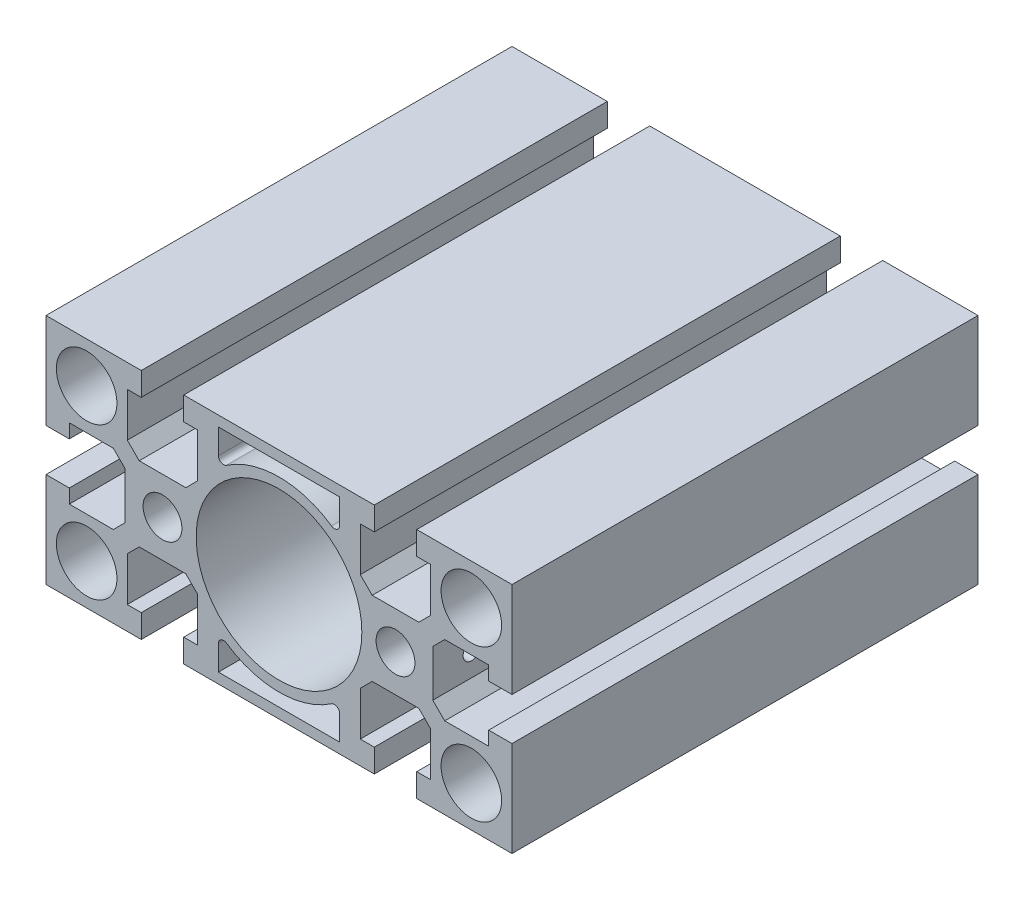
ISO-10303-21;
HEADER;
FILE_DESCRIPTION(('STEP AP214'),'2;1');
FILE_NAME('part.step','',(''),(''),'','','');
FILE_SCHEMA(('AUTOMOTIVE_DESIGN { 1 0 10303 214 1 1 1 1 }'));
ENDSEC;
DATA;
#1=APPLICATION_CONTEXT('core data for automotive mechanical design processes');
#2=APPLICATION_PROTOCOL_DEFINITION('international standard','automotive_design',2000,#1);
#3=PRODUCT_CONTEXT('',#1,'mechanical');
#4=PRODUCT('Part','Part','',(#3));
#5=PRODUCT_RELATED_PRODUCT_CATEGORY('part','',(#4));
#6=PRODUCT_DEFINITION_FORMATION('','',#4);
#7=PRODUCT_DEFINITION_CONTEXT('part definition',#1,'design');
#8=PRODUCT_DEFINITION('design','',#6,#7);
#9=PRODUCT_DEFINITION_SHAPE('','',#8);
#10=(LENGTH_UNIT() NAMED_UNIT(*) SI_UNIT(.MILLI.,.METRE.));
#11=(NAMED_UNIT(*) PLANE_ANGLE_UNIT() SI_UNIT($,.RADIAN.));
#12=(NAMED_UNIT(*) SI_UNIT($,.STERADIAN.) SOLID_ANGLE_UNIT());
#13=UNCERTAINTY_MEASURE_WITH_UNIT(LENGTH_MEASURE(1.E-05),#10,'distance_accuracy_value','');
#14=(GEOMETRIC_REPRESENTATION_CONTEXT(3) GLOBAL_UNCERTAINTY_ASSIGNED_CONTEXT((#13)) GLOBAL_UNIT_ASSIGNED_CONTEXT((#10,
#11,#12)) REPRESENTATION_CONTEXT('',''));
#15=CARTESIAN_POINT('',(0.,0.,0.));
#16=DIRECTION('',(0.,0.,1.));
#17=DIRECTION('',(1.,0.,0.));
#18=AXIS2_PLACEMENT_3D('',#15,#16,#17);
#19=CARTESIAN_POINT('',(40.5,6.80000000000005,90.));
#20=DIRECTION('',(0.,0.,-1.));
#21=DIRECTION('',(-1.,0.,0.));
#22=AXIS2_PLACEMENT_3D('',#19,#20,#21);
#23=PLANE('',#22);
#24=CARTESIAN_POINT('',(22.5,0.,90.));
#25=DIRECTION('',(0.,0.,1.));
#26=DIRECTION('',(1.,0.,0.));
#27=AXIS2_PLACEMENT_3D('',#24,#25,#26);
#28=CIRCLE('',#27,3.75000000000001);
#29=CARTESIAN_POINT('',(26.25,0.,90.));
#30=VERTEX_POINT('',#29);
#31=EDGE_CURVE('E562',#30,#30,#28,.T.);
#32=ORIENTED_EDGE('',*,*,#31,.F.);
#33=EDGE_LOOP('',(#32));
#34=FACE_BOUND('',#33,.T.);
#35=CARTESIAN_POINT('',(0.,1.065814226E-13,90.));
#36=DIRECTION('',(0.,0.,1.));
#37=DIRECTION('',(1.,0.,0.));
#38=AXIS2_PLACEMENT_3D('',#35,#36,#37);
#39=CIRCLE('',#38,16.);
#40=CARTESIAN_POINT('',(16.,1.065814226E-13,90.));
#41=VERTEX_POINT('',#40);
#42=EDGE_CURVE('E574',#41,#41,#39,.T.);
#43=ORIENTED_EDGE('',*,*,#42,.F.);
#44=EDGE_LOOP('',(#43));
#45=FACE_BOUND('',#44,.T.);
#46=CARTESIAN_POINT('',(-37.15,14.65,90.));
#47=DIRECTION('',(0.,0.,1.));
#48=DIRECTION('',(1.,0.,0.));
#49=AXIS2_PLACEMENT_3D('',#46,#47,#48);
#50=CIRCLE('',#49,5.85);
#51=CARTESIAN_POINT('',(-43.,14.65,90.));
#52=VERTEX_POINT('',#51);
#53=EDGE_CURVE('E625',#52,#52,#50,.T.);
#54=ORIENTED_EDGE('',*,*,#53,.F.);
#55=EDGE_LOOP('',(#54));
#56=FACE_BOUND('',#55,.T.);
#57=CARTESIAN_POINT('',(37.15,-14.6499999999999,90.));
#58=DIRECTION('',(0.,0.,1.));
#59=DIRECTION('',(1.,0.,0.));
#60=AXIS2_PLACEMENT_3D('',#57,#58,#59);
#61=CIRCLE('',#60,5.85);
#62=CARTESIAN_POINT('',(31.3,-14.6499999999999,90.));
#63=VERTEX_POINT('',#62);
#64=EDGE_CURVE('E637',#63,#63,#61,.T.);
#65=ORIENTED_EDGE('',*,*,#64,.F.);
#66=EDGE_LOOP('',(#65));
#67=FACE_BOUND('',#66,.T.);
#68=DIRECTION('',(1.,0.,0.));
#69=VECTOR('',#68,1.);
#70=CARTESIAN_POINT('',(32.,6.80000000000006,90.));
#71=LINE('',#70,#69);
#72=CARTESIAN_POINT('',(32.,6.80000000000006,90.));
#73=VERTEX_POINT('',#72);
#74=CARTESIAN_POINT('',(40.5,6.80000000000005,90.));
#75=VERTEX_POINT('',#74);
#76=EDGE_CURVE('E649',#73,#75,#71,.T.);
#77=ORIENTED_EDGE('',*,*,#76,.T.);
#78=DIRECTION('',(0.,-1.,0.));
#79=VECTOR('',#78,1.);
#80=CARTESIAN_POINT('',(40.5,6.80000000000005,90.));
#81=LINE('',#80,#79);
#82=CARTESIAN_POINT('',(40.5,4.10000000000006,90.));
#83=VERTEX_POINT('',#82);
#84=EDGE_CURVE('E652',#75,#83,#81,.T.);
#85=ORIENTED_EDGE('',*,*,#84,.T.);
#86=DIRECTION('',(1.,0.,0.));
#87=VECTOR('',#86,1.);
#88=CARTESIAN_POINT('',(40.5,4.10000000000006,90.));
#89=LINE('',#88,#87);
#90=CARTESIAN_POINT('',(45.,4.10000000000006,90.));
#91=VERTEX_POINT('',#90);
#92=EDGE_CURVE('E655',#83,#91,#89,.T.);
#93=ORIENTED_EDGE('',*,*,#92,.T.);
#94=DIRECTION('',(0.,1.,0.));
#95=VECTOR('',#94,1.);
#96=CARTESIAN_POINT('',(45.,4.10000000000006,90.));
#97=LINE('',#96,#95);
#98=CARTESIAN_POINT('',(45.,22.5,90.));
#99=VERTEX_POINT('',#98);
#100=EDGE_CURVE('E657',#91,#99,#97,.T.);
#101=ORIENTED_EDGE('',*,*,#100,.T.);
#102=DIRECTION('',(-1.,0.,0.));
#103=VECTOR('',#102,1.);
#104=CARTESIAN_POINT('',(45.,22.5,90.));
#105=LINE('',#104,#103);
#106=CARTESIAN_POINT('',(26.6,22.5000000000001,90.));
#107=VERTEX_POINT('',#106);
#108=EDGE_CURVE('E659',#99,#107,#105,.T.);
#109=ORIENTED_EDGE('',*,*,#108,.T.);
#110=DIRECTION('',(0.,-1.,0.));
#111=VECTOR('',#110,1.);
#112=CARTESIAN_POINT('',(26.6,22.5000000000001,90.));
#113=LINE('',#112,#111);
#114=CARTESIAN_POINT('',(26.6,18.,90.));
#115=VERTEX_POINT('',#114);
#116=EDGE_CURVE('E661',#107,#115,#113,.T.);
#117=ORIENTED_EDGE('',*,*,#116,.T.);
#118=DIRECTION('',(1.,0.,0.));
#119=VECTOR('',#118,1.);
#120=CARTESIAN_POINT('',(26.6,18.,90.));
#121=LINE('',#120,#119);
#122=CARTESIAN_POINT('',(29.3,18.0000000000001,90.));
#123=VERTEX_POINT('',#122);
#124=EDGE_CURVE('E663',#115,#123,#121,.T.);
#125=ORIENTED_EDGE('',*,*,#124,.T.);
#126=DIRECTION('',(0.,-1.,0.));
#127=VECTOR('',#126,1.);
#128=CARTESIAN_POINT('',(29.3,18.0000000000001,90.));
#129=LINE('',#128,#127);
#130=CARTESIAN_POINT('',(29.3,9.50000000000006,90.));
#131=VERTEX_POINT('',#130);
#132=EDGE_CURVE('E665',#123,#131,#129,.T.);
#133=ORIENTED_EDGE('',*,*,#132,.T.);
#134=DIRECTION('',(-0.707106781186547,-0.707106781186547,0.));
#135=VECTOR('',#134,1.);
#136=CARTESIAN_POINT('',(29.3,9.50000000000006,90.));
#137=LINE('',#136,#135);
#138=CARTESIAN_POINT('',(27.,7.20000000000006,90.));
#139=VERTEX_POINT('',#138);
#140=EDGE_CURVE('E667',#131,#139,#137,.T.);
#141=ORIENTED_EDGE('',*,*,#140,.T.);
#142=DIRECTION('',(-1.,0.,0.));
#143=VECTOR('',#142,1.);
#144=CARTESIAN_POINT('',(27.,7.20000000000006,90.));
#145=LINE('',#144,#143);
#146=CARTESIAN_POINT('',(18.,7.20000000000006,90.));
#147=VERTEX_POINT('',#146);
#148=EDGE_CURVE('E669',#139,#147,#145,.T.);
#149=ORIENTED_EDGE('',*,*,#148,.T.);
#150=DIRECTION('',(-0.707106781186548,0.707106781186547,0.));
#151=VECTOR('',#150,1.);
#152=CARTESIAN_POINT('',(18.,7.20000000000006,90.));
#153=LINE('',#152,#151);
#154=CARTESIAN_POINT('',(15.6999999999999,9.5000000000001,90.));
#155=VERTEX_POINT('',#154);
#156=EDGE_CURVE('E671',#147,#155,#153,.T.);
#157=ORIENTED_EDGE('',*,*,#156,.T.);
#158=DIRECTION('',(0.,1.,0.));
#159=VECTOR('',#158,1.);
#160=CARTESIAN_POINT('',(15.6999999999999,9.5000000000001,90.));
#161=LINE('',#160,#159);
#162=CARTESIAN_POINT('',(15.6999999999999,18.0000000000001,90.));
#163=VERTEX_POINT('',#162);
#164=EDGE_CURVE('E673',#155,#163,#161,.T.);
#165=ORIENTED_EDGE('',*,*,#164,.T.);
#166=DIRECTION('',(1.,0.,0.));
#167=VECTOR('',#166,1.);
#168=CARTESIAN_POINT('',(15.6999999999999,18.0000000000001,90.));
#169=LINE('',#168,#167);
#170=CARTESIAN_POINT('',(18.4,18.0000000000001,90.));
#171=VERTEX_POINT('',#170);
#172=EDGE_CURVE('E675',#163,#171,#169,.T.);
#173=ORIENTED_EDGE('',*,*,#172,.T.);
#174=DIRECTION('',(0.,1.,0.));
#175=VECTOR('',#174,1.);
#176=CARTESIAN_POINT('',(18.4,18.0000000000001,90.));
#177=LINE('',#176,#175);
#178=CARTESIAN_POINT('',(18.4,22.5000000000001,90.));
#179=VERTEX_POINT('',#178);
#180=EDGE_CURVE('E677',#171,#179,#177,.T.);
#181=ORIENTED_EDGE('',*,*,#180,.T.);
#182=DIRECTION('',(-1.,0.,0.));
#183=VECTOR('',#182,1.);
#184=CARTESIAN_POINT('',(18.4,22.5000000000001,90.));
#185=LINE('',#184,#183);
#186=CARTESIAN_POINT('',(-18.4,22.5000000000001,90.));
#187=VERTEX_POINT('',#186);
#188=EDGE_CURVE('E679',#179,#187,#185,.T.);
#189=ORIENTED_EDGE('',*,*,#188,.T.);
#190=DIRECTION('',(0.,-1.,0.));
#191=VECTOR('',#190,1.);
#192=CARTESIAN_POINT('',(-18.4,22.5000000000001,90.));
#193=LINE('',#192,#191);
#194=CARTESIAN_POINT('',(-18.4,18.0000000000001,90.));
#195=VERTEX_POINT('',#194);
#196=EDGE_CURVE('E681',#187,#195,#193,.T.);
#197=ORIENTED_EDGE('',*,*,#196,.T.);
#198=DIRECTION('',(1.,0.,0.));
#199=VECTOR('',#198,1.);
#200=CARTESIAN_POINT('',(-18.4,18.0000000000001,90.));
#201=LINE('',#200,#199);
#202=CARTESIAN_POINT('',(-15.7,18.0000000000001,90.));
#203=VERTEX_POINT('',#202);
#204=EDGE_CURVE('E683',#195,#203,#201,.T.);
#205=ORIENTED_EDGE('',*,*,#204,.T.);
#206=DIRECTION('',(0.,-1.,0.));
#207=VECTOR('',#206,1.);
#208=CARTESIAN_POINT('',(-15.7,18.0000000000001,90.));
#209=LINE('',#208,#207);
#210=CARTESIAN_POINT('',(-15.7,9.50000000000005,90.));
#211=VERTEX_POINT('',#210);
#212=EDGE_CURVE('E685',#203,#211,#209,.T.);
#213=ORIENTED_EDGE('',*,*,#212,.T.);
#214=DIRECTION('',(-0.70710678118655,-0.707106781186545,0.));
#215=VECTOR('',#214,1.);
#216=CARTESIAN_POINT('',(-15.7,9.50000000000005,90.));
#217=LINE('',#216,#215);
#218=CARTESIAN_POINT('',(-18.,7.20000000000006,90.));
#219=VERTEX_POINT('',#218);
#220=EDGE_CURVE('E687',#211,#219,#217,.T.);
#221=ORIENTED_EDGE('',*,*,#220,.T.);
#222=DIRECTION('',(-1.,0.,0.));
#223=VECTOR('',#222,1.);
#224=CARTESIAN_POINT('',(-18.,7.20000000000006,90.));
#225=LINE('',#224,#223);
#226=CARTESIAN_POINT('',(-27.,7.20000000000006,90.));
#227=VERTEX_POINT('',#226);
#228=EDGE_CURVE('E689',#219,#227,#225,.T.);
#229=ORIENTED_EDGE('',*,*,#228,.T.);
#230=DIRECTION('',(-0.707106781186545,0.70710678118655,0.));
#231=VECTOR('',#230,1.);
#232=CARTESIAN_POINT('',(-27.,7.20000000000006,90.));
#233=LINE('',#232,#231);
#234=CARTESIAN_POINT('',(-29.3,9.50000000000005,90.));
#235=VERTEX_POINT('',#234);
#236=EDGE_CURVE('E691',#227,#235,#233,.T.);
#237=ORIENTED_EDGE('',*,*,#236,.T.);
#238=DIRECTION('',(0.,1.,0.));
#239=VECTOR('',#238,1.);
#240=CARTESIAN_POINT('',(-29.3,9.50000000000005,90.));
#241=LINE('',#240,#239);
#242=CARTESIAN_POINT('',(-29.3,18.0000000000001,90.));
#243=VERTEX_POINT('',#242);
#244=EDGE_CURVE('E693',#235,#243,#241,.T.);
#245=ORIENTED_EDGE('',*,*,#244,.T.);
#246=DIRECTION('',(1.,0.,0.));
#247=VECTOR('',#246,1.);
#248=CARTESIAN_POINT('',(-29.3,18.0000000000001,90.));
#249=LINE('',#248,#247);
#250=CARTESIAN_POINT('',(-26.6000000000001,18.0000000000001,90.));
#251=VERTEX_POINT('',#250);
#252=EDGE_CURVE('E695',#243,#251,#249,.T.);
#253=ORIENTED_EDGE('',*,*,#252,.T.);
#254=DIRECTION('',(0.,1.,0.));
#255=VECTOR('',#254,1.);
#256=CARTESIAN_POINT('',(-26.6000000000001,18.0000000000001,90.));
#257=LINE('',#256,#255);
#258=CARTESIAN_POINT('',(-26.6000000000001,22.5,90.));
#259=VERTEX_POINT('',#258);
#260=EDGE_CURVE('E697',#251,#259,#257,.T.);
#261=ORIENTED_EDGE('',*,*,#260,.T.);
#262=DIRECTION('',(-1.,0.,0.));
#263=VECTOR('',#262,1.);
#264=CARTESIAN_POINT('',(-26.6000000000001,22.5,90.));
#265=LINE('',#264,#263);
#266=CARTESIAN_POINT('',(-45.,22.5,90.));
#267=VERTEX_POINT('',#266);
#268=EDGE_CURVE('E699',#259,#267,#265,.T.);
#269=ORIENTED_EDGE('',*,*,#268,.T.);
#270=DIRECTION('',(0.,-1.,0.));
#271=VECTOR('',#270,1.);
#272=CARTESIAN_POINT('',(-45.,22.5,90.));
#273=LINE('',#272,#271);
#274=CARTESIAN_POINT('',(-45.,4.10000000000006,90.));
#275=VERTEX_POINT('',#274);
#276=EDGE_CURVE('E701',#267,#275,#273,.T.);
#277=ORIENTED_EDGE('',*,*,#276,.T.);
#278=DIRECTION('',(1.,0.,0.));
#279=VECTOR('',#278,1.);
#280=CARTESIAN_POINT('',(-45.,4.10000000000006,90.));
#281=LINE('',#280,#279);
#282=CARTESIAN_POINT('',(-40.5,4.10000000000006,90.));
#283=VERTEX_POINT('',#282);
#284=EDGE_CURVE('E703',#275,#283,#281,.T.);
#285=ORIENTED_EDGE('',*,*,#284,.T.);
#286=DIRECTION('',(0.,1.,0.));
#287=VECTOR('',#286,1.);
#288=CARTESIAN_POINT('',(-40.5,4.10000000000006,90.));
#289=LINE('',#288,#287);
#290=CARTESIAN_POINT('',(-40.5,6.80000000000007,90.));
#291=VERTEX_POINT('',#290);
#292=EDGE_CURVE('E705',#283,#291,#289,.T.);
#293=ORIENTED_EDGE('',*,*,#292,.T.);
#294=DIRECTION('',(1.,0.,0.));
#295=VECTOR('',#294,1.);
#296=CARTESIAN_POINT('',(-40.5,6.80000000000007,90.));
#297=LINE('',#296,#295);
#298=CARTESIAN_POINT('',(-32.,6.80000000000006,90.));
#299=VERTEX_POINT('',#298);
#300=EDGE_CURVE('E707',#291,#299,#297,.T.);
#301=ORIENTED_EDGE('',*,*,#300,.T.);
#302=DIRECTION('',(0.70710678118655,-0.707106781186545,0.));
#303=VECTOR('',#302,1.);
#304=CARTESIAN_POINT('',(-32.,6.80000000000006,90.));
#305=LINE('',#304,#303);
#306=CARTESIAN_POINT('',(-29.7,4.50000000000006,90.));
#307=VERTEX_POINT('',#306);
#308=EDGE_CURVE('E709',#299,#307,#305,.T.);
#309=ORIENTED_EDGE('',*,*,#308,.T.);
#310=DIRECTION('',(0.,-1.,0.));
#311=VECTOR('',#310,1.);
#312=CARTESIAN_POINT('',(-29.7,4.50000000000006,90.));
#313=LINE('',#312,#311);
#314=CARTESIAN_POINT('',(-29.7,-4.49999999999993,90.));
#315=VERTEX_POINT('',#314);
#316=EDGE_CURVE('E711',#307,#315,#313,.T.);
#317=ORIENTED_EDGE('',*,*,#316,.T.);
#318=DIRECTION('',(-0.707106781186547,-0.707106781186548,0.));
#319=VECTOR('',#318,1.);
#320=CARTESIAN_POINT('',(-29.7,-4.49999999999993,90.));
#321=LINE('',#320,#319);
#322=CARTESIAN_POINT('',(-32.,-6.79999999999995,90.));
#323=VERTEX_POINT('',#322);
#324=EDGE_CURVE('E713',#315,#323,#321,.T.);
#325=ORIENTED_EDGE('',*,*,#324,.T.);
#326=DIRECTION('',(-1.,0.,0.));
#327=VECTOR('',#326,1.);
#328=CARTESIAN_POINT('',(-32.,-6.79999999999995,90.));
#329=LINE('',#328,#327);
#330=CARTESIAN_POINT('',(-40.5,-6.79999999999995,90.));
#331=VERTEX_POINT('',#330);
#332=EDGE_CURVE('E715',#323,#331,#329,.T.);
#333=ORIENTED_EDGE('',*,*,#332,.T.);
#334=DIRECTION('',(0.,1.,0.));
#335=VECTOR('',#334,1.);
#336=CARTESIAN_POINT('',(-40.5,-6.79999999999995,90.));
#337=LINE('',#336,#335);
#338=CARTESIAN_POINT('',(-40.5,-4.09999999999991,90.));
#339=VERTEX_POINT('',#338);
#340=EDGE_CURVE('E717',#331,#339,#337,.T.);
#341=ORIENTED_EDGE('',*,*,#340,.T.);
#342=DIRECTION('',(-1.,0.,0.));
#343=VECTOR('',#342,1.);
#344=CARTESIAN_POINT('',(-40.5,-4.09999999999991,90.));
#345=LINE('',#344,#343);
#346=CARTESIAN_POINT('',(-45.,-4.09999999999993,90.));
#347=VERTEX_POINT('',#346);
#348=EDGE_CURVE('E719',#339,#347,#345,.T.);
#349=ORIENTED_EDGE('',*,*,#348,.T.);
#350=DIRECTION('',(0.,-1.,0.));
#351=VECTOR('',#350,1.);
#352=CARTESIAN_POINT('',(-45.,-4.09999999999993,90.));
#353=LINE('',#352,#351);
#354=CARTESIAN_POINT('',(-45.,-22.4999999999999,90.));
#355=VERTEX_POINT('',#354);
#356=EDGE_CURVE('E721',#347,#355,#353,.T.);
#357=ORIENTED_EDGE('',*,*,#356,.T.);
#358=DIRECTION('',(1.,0.,0.));
#359=VECTOR('',#358,1.);
#360=CARTESIAN_POINT('',(-45.,-22.4999999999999,90.));
#361=LINE('',#360,#359);
#362=CARTESIAN_POINT('',(-26.6000000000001,-22.4999999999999,90.));
#363=VERTEX_POINT('',#362);
#364=EDGE_CURVE('E723',#355,#363,#361,.T.);
#365=ORIENTED_EDGE('',*,*,#364,.T.);
#366=DIRECTION('',(0.,1.,0.));
#367=VECTOR('',#366,1.);
#368=CARTESIAN_POINT('',(-26.6000000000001,-22.4999999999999,90.));
#369=LINE('',#368,#367);
#370=CARTESIAN_POINT('',(-26.6,-17.9999999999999,90.));
#371=VERTEX_POINT('',#370);
#372=EDGE_CURVE('E725',#363,#371,#369,.T.);
#373=ORIENTED_EDGE('',*,*,#372,.T.);
#374=DIRECTION('',(-1.,0.,0.));
#375=VECTOR('',#374,1.);
#376=CARTESIAN_POINT('',(-26.6,-17.9999999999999,90.));
#377=LINE('',#376,#375);
#378=CARTESIAN_POINT('',(-29.3,-17.9999999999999,90.));
#379=VERTEX_POINT('',#378);
#380=EDGE_CURVE('E727',#371,#379,#377,.T.);
#381=ORIENTED_EDGE('',*,*,#380,.T.);
#382=DIRECTION('',(0.,1.,0.));
#383=VECTOR('',#382,1.);
#384=CARTESIAN_POINT('',(-29.3,-17.9999999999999,90.));
#385=LINE('',#384,#383);
#386=CARTESIAN_POINT('',(-29.3,-9.49999999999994,90.));
#387=VERTEX_POINT('',#386);
#388=EDGE_CURVE('E729',#379,#387,#385,.T.);
#389=ORIENTED_EDGE('',*,*,#388,.T.);
#390=DIRECTION('',(0.707106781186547,0.707106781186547,0.));
#391=VECTOR('',#390,1.);
#392=CARTESIAN_POINT('',(-29.3,-9.49999999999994,90.));
#393=LINE('',#392,#391);
#394=CARTESIAN_POINT('',(-27.,-7.19999999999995,90.));
#395=VERTEX_POINT('',#394);
#396=EDGE_CURVE('E731',#387,#395,#393,.T.);
#397=ORIENTED_EDGE('',*,*,#396,.T.);
#398=DIRECTION('',(1.,0.,0.));
#399=VECTOR('',#398,1.);
#400=CARTESIAN_POINT('',(-27.,-7.19999999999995,90.));
#401=LINE('',#400,#399);
#402=CARTESIAN_POINT('',(-18.,-7.19999999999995,90.));
#403=VERTEX_POINT('',#402);
#404=EDGE_CURVE('E733',#395,#403,#401,.T.);
#405=ORIENTED_EDGE('',*,*,#404,.T.);
#406=DIRECTION('',(0.70710678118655,-0.707106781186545,0.));
#407=VECTOR('',#406,1.);
#408=CARTESIAN_POINT('',(-18.,-7.19999999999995,90.));
#409=LINE('',#408,#407);
#410=CARTESIAN_POINT('',(-15.7,-9.49999999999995,90.));
#411=VERTEX_POINT('',#410);
#412=EDGE_CURVE('E735',#403,#411,#409,.T.);
#413=ORIENTED_EDGE('',*,*,#412,.T.);
#414=DIRECTION('',(0.,-1.,0.));
#415=VECTOR('',#414,1.);
#416=CARTESIAN_POINT('',(-15.7,-9.49999999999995,90.));
#417=LINE('',#416,#415);
#418=CARTESIAN_POINT('',(-15.7,-18.,90.));
#419=VERTEX_POINT('',#418);
#420=EDGE_CURVE('E737',#411,#419,#417,.T.);
#421=ORIENTED_EDGE('',*,*,#420,.T.);
#422=DIRECTION('',(-1.,0.,0.));
#423=VECTOR('',#422,1.);
#424=CARTESIAN_POINT('',(-15.7,-18.,90.));
#425=LINE('',#424,#423);
#426=CARTESIAN_POINT('',(-18.4,-18.,90.));
#427=VERTEX_POINT('',#426);
#428=EDGE_CURVE('E739',#419,#427,#425,.T.);
#429=ORIENTED_EDGE('',*,*,#428,.T.);
#430=DIRECTION('',(0.,-1.,0.));
#431=VECTOR('',#430,1.);
#432=CARTESIAN_POINT('',(-18.4,-18.,90.));
#433=LINE('',#432,#431);
#434=CARTESIAN_POINT('',(-18.4,-22.4999999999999,90.));
#435=VERTEX_POINT('',#434);
#436=EDGE_CURVE('E741',#427,#435,#433,.T.);
#437=ORIENTED_EDGE('',*,*,#436,.T.);
#438=DIRECTION('',(1.,0.,0.));
#439=VECTOR('',#438,1.);
#440=CARTESIAN_POINT('',(-18.4,-22.4999999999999,90.));
#441=LINE('',#440,#439);
#442=CARTESIAN_POINT('',(18.4,-22.4999999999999,90.));
#443=VERTEX_POINT('',#442);
#444=EDGE_CURVE('E743',#435,#443,#441,.T.);
#445=ORIENTED_EDGE('',*,*,#444,.T.);
#446=DIRECTION('',(0.,1.,0.));
#447=VECTOR('',#446,1.);
#448=CARTESIAN_POINT('',(18.4,-22.4999999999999,90.));
#449=LINE('',#448,#447);
#450=CARTESIAN_POINT('',(18.3999999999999,-18.,90.));
#451=VERTEX_POINT('',#450);
#452=EDGE_CURVE('E745',#443,#451,#449,.T.);
#453=ORIENTED_EDGE('',*,*,#452,.T.);
#454=DIRECTION('',(-1.,0.,0.));
#455=VECTOR('',#454,1.);
#456=CARTESIAN_POINT('',(18.3999999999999,-18.,90.));
#457=LINE('',#456,#455);
#458=CARTESIAN_POINT('',(15.7000000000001,-18.,90.));
#459=VERTEX_POINT('',#458);
#460=EDGE_CURVE('E747',#451,#459,#457,.T.);
#461=ORIENTED_EDGE('',*,*,#460,.T.);
#462=DIRECTION('',(0.,1.,0.));
#463=VECTOR('',#462,1.);
#464=CARTESIAN_POINT('',(15.7000000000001,-18.,90.));
#465=LINE('',#464,#463);
#466=CARTESIAN_POINT('',(15.7000000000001,-9.49999999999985,90.));
#467=VERTEX_POINT('',#466);
#468=EDGE_CURVE('E749',#459,#467,#465,.T.);
#469=ORIENTED_EDGE('',*,*,#468,.T.);
#470=DIRECTION('',(0.70710678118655,0.707106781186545,0.));
#471=VECTOR('',#470,1.);
#472=CARTESIAN_POINT('',(15.7000000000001,-9.49999999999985,90.));
#473=LINE('',#472,#471);
#474=CARTESIAN_POINT('',(18.,-7.19999999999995,90.));
#475=VERTEX_POINT('',#474);
#476=EDGE_CURVE('E751',#467,#475,#473,.T.);
#477=ORIENTED_EDGE('',*,*,#476,.T.);
#478=DIRECTION('',(1.,0.,0.));
#479=VECTOR('',#478,1.);
#480=CARTESIAN_POINT('',(18.,-7.19999999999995,90.));
#481=LINE('',#480,#479);
#482=CARTESIAN_POINT('',(27.,-7.19999999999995,90.));
#483=VERTEX_POINT('',#482);
#484=EDGE_CURVE('E753',#475,#483,#481,.T.);
#485=ORIENTED_EDGE('',*,*,#484,.T.);
#486=DIRECTION('',(0.707106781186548,-0.707106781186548,0.));
#487=VECTOR('',#486,1.);
#488=CARTESIAN_POINT('',(27.,-7.19999999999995,90.));
#489=LINE('',#488,#487);
#490=CARTESIAN_POINT('',(29.3,-9.49999999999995,90.));
#491=VERTEX_POINT('',#490);
#492=EDGE_CURVE('E755',#483,#491,#489,.T.);
#493=ORIENTED_EDGE('',*,*,#492,.T.);
#494=DIRECTION('',(0.,-1.,0.));
#495=VECTOR('',#494,1.);
#496=CARTESIAN_POINT('',(29.3,-9.49999999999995,90.));
#497=LINE('',#496,#495);
#498=CARTESIAN_POINT('',(29.3,-17.9999999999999,90.));
#499=VERTEX_POINT('',#498);
#500=EDGE_CURVE('E757',#491,#499,#497,.T.);
#501=ORIENTED_EDGE('',*,*,#500,.T.);
#502=DIRECTION('',(-1.,0.,0.));
#503=VECTOR('',#502,1.);
#504=CARTESIAN_POINT('',(29.3,-17.9999999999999,90.));
#505=LINE('',#504,#503);
#506=CARTESIAN_POINT('',(26.6,-18.,90.));
#507=VERTEX_POINT('',#506);
#508=EDGE_CURVE('E759',#499,#507,#505,.T.);
#509=ORIENTED_EDGE('',*,*,#508,.T.);
#510=DIRECTION('',(0.,-1.,0.));
#511=VECTOR('',#510,1.);
#512=CARTESIAN_POINT('',(26.6,-18.,90.));
#513=LINE('',#512,#511);
#514=CARTESIAN_POINT('',(26.6,-22.4999999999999,90.));
#515=VERTEX_POINT('',#514);
#516=EDGE_CURVE('E761',#507,#515,#513,.T.);
#517=ORIENTED_EDGE('',*,*,#516,.T.);
#518=DIRECTION('',(1.,0.,0.));
#519=VECTOR('',#518,1.);
#520=CARTESIAN_POINT('',(26.6,-22.4999999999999,90.));
#521=LINE('',#520,#519);
#522=CARTESIAN_POINT('',(45.0000000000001,-22.4999999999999,90.));
#523=VERTEX_POINT('',#522);
#524=EDGE_CURVE('E763',#515,#523,#521,.T.);
#525=ORIENTED_EDGE('',*,*,#524,.T.);
#526=DIRECTION('',(0.,1.,0.));
#527=VECTOR('',#526,1.);
#528=CARTESIAN_POINT('',(45.0000000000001,-22.4999999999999,90.));
#529=LINE('',#528,#527);
#530=CARTESIAN_POINT('',(45.,-4.09999999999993,90.));
#531=VERTEX_POINT('',#530);
#532=EDGE_CURVE('E765',#523,#531,#529,.T.);
#533=ORIENTED_EDGE('',*,*,#532,.T.);
#534=DIRECTION('',(-1.,0.,0.));
#535=VECTOR('',#534,1.);
#536=CARTESIAN_POINT('',(45.,-4.09999999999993,90.));
#537=LINE('',#536,#535);
#538=CARTESIAN_POINT('',(40.5,-4.09999999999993,90.));
#539=VERTEX_POINT('',#538);
#540=EDGE_CURVE('E767',#531,#539,#537,.T.);
#541=ORIENTED_EDGE('',*,*,#540,.T.);
#542=DIRECTION('',(0.,-1.,0.));
#543=VECTOR('',#542,1.);
#544=CARTESIAN_POINT('',(40.5,-4.09999999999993,90.));
#545=LINE('',#544,#543);
#546=CARTESIAN_POINT('',(40.5,-6.79999999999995,90.));
#547=VERTEX_POINT('',#546);
#548=EDGE_CURVE('E769',#539,#547,#545,.T.);
#549=ORIENTED_EDGE('',*,*,#548,.T.);
#550=DIRECTION('',(-1.,0.,0.));
#551=VECTOR('',#550,1.);
#552=CARTESIAN_POINT('',(40.5,-6.79999999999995,90.));
#553=LINE('',#552,#551);
#554=CARTESIAN_POINT('',(32.,-6.79999999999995,90.));
#555=VERTEX_POINT('',#554);
#556=EDGE_CURVE('E771',#547,#555,#553,.T.);
#557=ORIENTED_EDGE('',*,*,#556,.T.);
#558=DIRECTION('',(-0.707106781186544,0.707106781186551,0.));
#559=VECTOR('',#558,1.);
#560=CARTESIAN_POINT('',(32.,-6.79999999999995,90.));
#561=LINE('',#560,#559);
#562=CARTESIAN_POINT('',(29.7,-4.49999999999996,90.));
#563=VERTEX_POINT('',#562);
#564=EDGE_CURVE('E773',#555,#563,#561,.T.);
#565=ORIENTED_EDGE('',*,*,#564,.T.);
#566=DIRECTION('',(0.,1.,0.));
#567=VECTOR('',#566,1.);
#568=CARTESIAN_POINT('',(29.7,-4.49999999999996,90.));
#569=LINE('',#568,#567);
#570=CARTESIAN_POINT('',(29.7,4.50000000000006,90.));
#571=VERTEX_POINT('',#570);
#572=EDGE_CURVE('E775',#563,#571,#569,.T.);
#573=ORIENTED_EDGE('',*,*,#572,.T.);
#574=DIRECTION('',(0.707106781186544,0.707106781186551,0.));
#575=VECTOR('',#574,1.);
#576=CARTESIAN_POINT('',(29.7,4.50000000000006,90.));
#577=LINE('',#576,#575);
#578=EDGE_CURVE('E777',#571,#73,#577,.T.);
#579=ORIENTED_EDGE('',*,*,#578,.T.);
#580=EDGE_LOOP('',(#77,#85,#93,#101,#109,#117,#125,#133,#141,#149,#157,#165,#173,#181,#189,#197,
#205,#213,#221,#229,#237,#245,#253,#261,#269,#277,#285,#293,#301,#309,#317,#325,#333,#341,#349,
#357,#365,#373,#381,#389,#397,#405,#413,#421,#429,#437,#445,#453,#461,#469,#477,#485,#493,#501,
#509,#517,#525,#533,#541,#549,#557,#565,#573,#579));
#581=FACE_BOUND('',#580,.T.);
#582=CARTESIAN_POINT('',(37.15,14.65,90.));
#583=DIRECTION('',(0.,0.,1.));
#584=DIRECTION('',(1.,0.,0.));
#585=AXIS2_PLACEMENT_3D('',#582,#583,#584);
#586=CIRCLE('',#585,5.85);
#587=CARTESIAN_POINT('',(31.3,14.65,90.));
#588=VERTEX_POINT('',#587);
#589=EDGE_CURVE('E643',#588,#588,#586,.T.);
#590=ORIENTED_EDGE('',*,*,#589,.F.);
#591=EDGE_LOOP('',(#590));
#592=FACE_BOUND('',#591,.T.);
#593=CARTESIAN_POINT('',(-37.15,-14.6499999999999,90.));
#594=DIRECTION('',(0.,0.,1.));
#595=DIRECTION('',(1.,0.,0.));
#596=AXIS2_PLACEMENT_3D('',#593,#594,#595);
#597=CIRCLE('',#596,5.85);
#598=CARTESIAN_POINT('',(-43.,-14.6499999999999,90.));
#599=VERTEX_POINT('',#598);
#600=EDGE_CURVE('E631',#599,#599,#597,.T.);
#601=ORIENTED_EDGE('',*,*,#600,.F.);
#602=EDGE_LOOP('',(#601));
#603=FACE_BOUND('',#602,.T.);
#604=CARTESIAN_POINT('',(-10.7,15.7006369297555,90.));
#605=DIRECTION('',(0.,0.,1.));
#606=DIRECTION('',(1.,0.,0.));
#607=AXIS2_PLACEMENT_3D('',#604,#605,#606);
#608=CIRCLE('',#607,0.999999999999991);
#609=CARTESIAN_POINT('',(-11.7,15.7006369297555,90.));
#610=VERTEX_POINT('',#609);
#611=CARTESIAN_POINT('',(-10.1368421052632,14.8742876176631,90.));
#612=VERTEX_POINT('',#611);
#613=EDGE_CURVE('E580',#610,#612,#608,.T.);
#614=ORIENTED_EDGE('',*,*,#613,.F.);
#615=DIRECTION('',(0.,-1.,0.));
#616=VECTOR('',#615,1.);
#617=CARTESIAN_POINT('',(-11.7,15.7006369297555,90.));
#618=LINE('',#617,#616);
#619=CARTESIAN_POINT('',(-11.7,20.5,90.));
#620=VERTEX_POINT('',#619);
#621=EDGE_CURVE('E592',#620,#610,#618,.T.);
#622=ORIENTED_EDGE('',*,*,#621,.F.);
#623=DIRECTION('',(-1.,0.,0.));
#624=VECTOR('',#623,1.);
#625=CARTESIAN_POINT('',(-11.7,20.5,90.));
#626=LINE('',#625,#624);
#627=CARTESIAN_POINT('',(11.7,20.5,90.));
#628=VERTEX_POINT('',#627);
#629=EDGE_CURVE('E589',#628,#620,#626,.T.);
#630=ORIENTED_EDGE('',*,*,#629,.F.);
#631=DIRECTION('',(0.,1.,0.));
#632=VECTOR('',#631,1.);
#633=CARTESIAN_POINT('',(11.7,20.5,90.));
#634=LINE('',#633,#632);
#635=CARTESIAN_POINT('',(11.7,15.7006369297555,90.));
#636=VERTEX_POINT('',#635);
#637=EDGE_CURVE('E587',#636,#628,#634,.T.);
#638=ORIENTED_EDGE('',*,*,#637,.F.);
#639=CARTESIAN_POINT('',(10.7,15.7006369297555,90.));
#640=DIRECTION('',(0.,0.,1.));
#641=DIRECTION('',(1.,0.,0.));
#642=AXIS2_PLACEMENT_3D('',#639,#640,#641);
#643=CIRCLE('',#642,0.999999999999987);
#644=CARTESIAN_POINT('',(10.1368421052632,14.8742876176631,90.));
#645=VERTEX_POINT('',#644);
#646=EDGE_CURVE('E585',#645,#636,#643,.T.);
#647=ORIENTED_EDGE('',*,*,#646,.F.);
#648=CARTESIAN_POINT('',(0.,1.065814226E-13,90.));
#649=DIRECTION('',(0.,0.,-1.));
#650=DIRECTION('',(1.,0.,0.));
#651=AXIS2_PLACEMENT_3D('',#648,#649,#650);
#652=CIRCLE('',#651,18.);
#653=EDGE_CURVE('E582',#612,#645,#652,.T.);
#654=ORIENTED_EDGE('',*,*,#653,.F.);
#655=EDGE_LOOP('',(#614,#622,#630,#638,#647,#654));
#656=FACE_BOUND('',#655,.T.);
#657=CARTESIAN_POINT('',(-22.5,0.,90.));
#658=DIRECTION('',(0.,0.,1.));
#659=DIRECTION('',(1.,0.,0.));
#660=AXIS2_PLACEMENT_3D('',#657,#658,#659);
#661=CIRCLE('',#660,3.75000000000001);
#662=CARTESIAN_POINT('',(-26.25,0.,90.));
#663=VERTEX_POINT('',#662);
#664=EDGE_CURVE('E568',#663,#663,#661,.T.);
#665=ORIENTED_EDGE('',*,*,#664,.F.);
#666=EDGE_LOOP('',(#665));
#667=FACE_BOUND('',#666,.T.);
#668=CARTESIAN_POINT('',(10.6999999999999,-15.7006369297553,90.));
#669=DIRECTION('',(0.,0.,1.));
#670=DIRECTION('',(1.,0.,0.));
#671=AXIS2_PLACEMENT_3D('',#668,#669,#670);
#672=CIRCLE('',#671,0.999999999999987);
#673=CARTESIAN_POINT('',(11.6999999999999,-15.7006369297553,90.));
#674=VERTEX_POINT('',#673);
#675=CARTESIAN_POINT('',(10.1368421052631,-14.874287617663,90.));
#676=VERTEX_POINT('',#675);
#677=EDGE_CURVE('E509',#674,#676,#672,.T.);
#678=ORIENTED_EDGE('',*,*,#677,.F.);
#679=DIRECTION('',(0.,1.,0.));
#680=VECTOR('',#679,1.);
#681=CARTESIAN_POINT('',(11.6999999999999,-15.7006369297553,90.));
#682=LINE('',#681,#680);
#683=CARTESIAN_POINT('',(11.6999999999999,-20.4999999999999,90.));
#684=VERTEX_POINT('',#683);
#685=EDGE_CURVE('E539',#684,#674,#682,.T.);
#686=ORIENTED_EDGE('',*,*,#685,.F.);
#687=DIRECTION('',(1.,0.,0.));
#688=VECTOR('',#687,1.);
#689=CARTESIAN_POINT('',(11.6999999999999,-20.4999999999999,90.));
#690=LINE('',#689,#688);
#691=CARTESIAN_POINT('',(-11.7000000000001,-20.4999999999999,90.));
#692=VERTEX_POINT('',#691);
#693=EDGE_CURVE('E537',#692,#684,#690,.T.);
#694=ORIENTED_EDGE('',*,*,#693,.F.);
#695=DIRECTION('',(0.,-1.,0.));
#696=VECTOR('',#695,1.);
#697=CARTESIAN_POINT('',(-11.7000000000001,-20.4999999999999,90.));
#698=LINE('',#697,#696);
#699=CARTESIAN_POINT('',(-11.7000000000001,-15.7006369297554,90.));
#700=VERTEX_POINT('',#699);
#701=EDGE_CURVE('E532',#700,#692,#698,.T.);
#702=ORIENTED_EDGE('',*,*,#701,.F.);
#703=CARTESIAN_POINT('',(-10.7000000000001,-15.7006369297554,90.));
#704=DIRECTION('',(0.,0.,1.));
#705=DIRECTION('',(1.,0.,0.));
#706=AXIS2_PLACEMENT_3D('',#703,#704,#705);
#707=CIRCLE('',#706,0.999999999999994);
#708=CARTESIAN_POINT('',(-10.1368421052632,-14.874287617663,90.));
#709=VERTEX_POINT('',#708);
#710=EDGE_CURVE('E530',#709,#700,#707,.T.);
#711=ORIENTED_EDGE('',*,*,#710,.F.);
#712=CARTESIAN_POINT('',(0.,1.065814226E-13,90.));
#713=DIRECTION('',(0.,0.,-1.));
#714=DIRECTION('',(1.,0.,0.));
#715=AXIS2_PLACEMENT_3D('',#712,#713,#714);
#716=CIRCLE('',#715,18.);
#717=EDGE_CURVE('E517',#676,#709,#716,.T.);
#718=ORIENTED_EDGE('',*,*,#717,.F.);
#719=EDGE_LOOP('',(#678,#686,#694,#702,#711,#718));
#720=FACE_BOUND('',#719,.T.);
#721=ADVANCED_FACE('F30',(#34,#45,#56,#67,#581,#592,#603,#656,#667,#720),#23,.F.);
#722=CARTESIAN_POINT('',(40.5,6.80000000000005,0.));
#723=DIRECTION('',(0.,0.,-1.));
#724=DIRECTION('',(-1.,0.,0.));
#725=AXIS2_PLACEMENT_3D('',#722,#723,#724);
#726=PLANE('',#725);
#727=CARTESIAN_POINT('',(22.5,0.,0.));
#728=DIRECTION('',(0.,0.,1.));
#729=DIRECTION('',(1.,0.,0.));
#730=AXIS2_PLACEMENT_3D('',#727,#728,#729);
#731=CIRCLE('',#730,3.75000000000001);
#732=CARTESIAN_POINT('',(26.25,0.,0.));
#733=VERTEX_POINT('',#732);
#734=EDGE_CURVE('E525',#733,#733,#731,.T.);
#735=ORIENTED_EDGE('',*,*,#734,.T.);
#736=EDGE_LOOP('',(#735));
#737=FACE_BOUND('',#736,.T.);
#738=CARTESIAN_POINT('',(0.,1.065814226E-13,0.));
#739=DIRECTION('',(0.,0.,1.));
#740=DIRECTION('',(1.,0.,0.));
#741=AXIS2_PLACEMENT_3D('',#738,#739,#740);
#742=CIRCLE('',#741,16.);
#743=CARTESIAN_POINT('',(16.,1.065814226E-13,0.));
#744=VERTEX_POINT('',#743);
#745=EDGE_CURVE('E571',#744,#744,#742,.T.);
#746=ORIENTED_EDGE('',*,*,#745,.T.);
#747=EDGE_LOOP('',(#746));
#748=FACE_BOUND('',#747,.T.);
#749=CARTESIAN_POINT('',(-37.15,14.65,0.));
#750=DIRECTION('',(0.,0.,1.));
#751=DIRECTION('',(1.,0.,0.));
#752=AXIS2_PLACEMENT_3D('',#749,#750,#751);
#753=CIRCLE('',#752,5.85);
#754=CARTESIAN_POINT('',(-43.,14.65,0.));
#755=VERTEX_POINT('',#754);
#756=EDGE_CURVE('E624',#755,#755,#753,.T.);
#757=ORIENTED_EDGE('',*,*,#756,.T.);
#758=EDGE_LOOP('',(#757));
#759=FACE_BOUND('',#758,.T.);
#760=CARTESIAN_POINT('',(37.15,-14.6499999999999,0.));
#761=DIRECTION('',(0.,0.,1.));
#762=DIRECTION('',(1.,0.,0.));
#763=AXIS2_PLACEMENT_3D('',#760,#761,#762);
#764=CIRCLE('',#763,5.85);
#765=CARTESIAN_POINT('',(31.3,-14.6499999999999,0.));
#766=VERTEX_POINT('',#765);
#767=EDGE_CURVE('E634',#766,#766,#764,.T.);
#768=ORIENTED_EDGE('',*,*,#767,.T.);
#769=EDGE_LOOP('',(#768));
#770=FACE_BOUND('',#769,.T.);
#771=DIRECTION('',(1.,0.,0.));
#772=VECTOR('',#771,1.);
#773=CARTESIAN_POINT('',(32.,6.80000000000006,0.));
#774=LINE('',#773,#772);
#775=CARTESIAN_POINT('',(32.,6.80000000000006,0.));
#776=VERTEX_POINT('',#775);
#777=CARTESIAN_POINT('',(40.5,6.80000000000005,0.));
#778=VERTEX_POINT('',#777);
#779=EDGE_CURVE('E646',#776,#778,#774,.T.);
#780=ORIENTED_EDGE('',*,*,#779,.F.);
#781=DIRECTION('',(0.707106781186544,0.707106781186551,0.));
#782=VECTOR('',#781,1.);
#783=CARTESIAN_POINT('',(29.7,4.50000000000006,0.));
#784=LINE('',#783,#782);
#785=CARTESIAN_POINT('',(29.7,4.50000000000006,0.));
#786=VERTEX_POINT('',#785);
#787=EDGE_CURVE('E653',#786,#776,#784,.T.);
#788=ORIENTED_EDGE('',*,*,#787,.F.);
#789=DIRECTION('',(0.,1.,0.));
#790=VECTOR('',#789,1.);
#791=CARTESIAN_POINT('',(29.7,-4.49999999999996,0.));
#792=LINE('',#791,#790);
#793=CARTESIAN_POINT('',(29.7,-4.49999999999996,0.));
#794=VERTEX_POINT('',#793);
#795=EDGE_CURVE('E904',#794,#786,#792,.T.);
#796=ORIENTED_EDGE('',*,*,#795,.F.);
#797=DIRECTION('',(-0.707106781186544,0.707106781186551,0.));
#798=VECTOR('',#797,1.);
#799=CARTESIAN_POINT('',(32.,-6.79999999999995,0.));
#800=LINE('',#799,#798);
#801=CARTESIAN_POINT('',(32.,-6.79999999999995,0.));
#802=VERTEX_POINT('',#801);
#803=EDGE_CURVE('E902',#802,#794,#800,.T.);
#804=ORIENTED_EDGE('',*,*,#803,.F.);
#805=DIRECTION('',(-1.,0.,0.));
#806=VECTOR('',#805,1.);
#807=CARTESIAN_POINT('',(40.5,-6.79999999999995,0.));
#808=LINE('',#807,#806);
#809=CARTESIAN_POINT('',(40.5,-6.79999999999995,0.));
#810=VERTEX_POINT('',#809);
#811=EDGE_CURVE('E900',#810,#802,#808,.T.);
#812=ORIENTED_EDGE('',*,*,#811,.F.);
#813=DIRECTION('',(0.,-1.,0.));
#814=VECTOR('',#813,1.);
#815=CARTESIAN_POINT('',(40.5,-4.09999999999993,0.));
#816=LINE('',#815,#814);
#817=CARTESIAN_POINT('',(40.5,-4.09999999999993,0.));
#818=VERTEX_POINT('',#817);
#819=EDGE_CURVE('E898',#818,#810,#816,.T.);
#820=ORIENTED_EDGE('',*,*,#819,.F.);
#821=DIRECTION('',(-1.,0.,0.));
#822=VECTOR('',#821,1.);
#823=CARTESIAN_POINT('',(45.,-4.09999999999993,0.));
#824=LINE('',#823,#822);
#825=CARTESIAN_POINT('',(45.,-4.09999999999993,0.));
#826=VERTEX_POINT('',#825);
#827=EDGE_CURVE('E896',#826,#818,#824,.T.);
#828=ORIENTED_EDGE('',*,*,#827,.F.);
#829=DIRECTION('',(0.,1.,0.));
#830=VECTOR('',#829,1.);
#831=CARTESIAN_POINT('',(45.0000000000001,-22.4999999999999,0.));
#832=LINE('',#831,#830);
#833=CARTESIAN_POINT('',(45.0000000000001,-22.4999999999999,0.));
#834=VERTEX_POINT('',#833);
#835=EDGE_CURVE('E894',#834,#826,#832,.T.);
#836=ORIENTED_EDGE('',*,*,#835,.F.);
#837=DIRECTION('',(1.,0.,0.));
#838=VECTOR('',#837,1.);
#839=CARTESIAN_POINT('',(26.6,-22.4999999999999,0.));
#840=LINE('',#839,#838);
#841=CARTESIAN_POINT('',(26.6,-22.4999999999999,0.));
#842=VERTEX_POINT('',#841);
#843=EDGE_CURVE('E892',#842,#834,#840,.T.);
#844=ORIENTED_EDGE('',*,*,#843,.F.);
#845=DIRECTION('',(0.,-1.,0.));
#846=VECTOR('',#845,1.);
#847=CARTESIAN_POINT('',(26.6,-18.,0.));
#848=LINE('',#847,#846);
#849=CARTESIAN_POINT('',(26.6,-18.,0.));
#850=VERTEX_POINT('',#849);
#851=EDGE_CURVE('E890',#850,#842,#848,.T.);
#852=ORIENTED_EDGE('',*,*,#851,.F.);
#853=DIRECTION('',(-1.,0.,0.));
#854=VECTOR('',#853,1.);
#855=CARTESIAN_POINT('',(29.3,-17.9999999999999,0.));
#856=LINE('',#855,#854);
#857=CARTESIAN_POINT('',(29.3,-17.9999999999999,0.));
#858=VERTEX_POINT('',#857);
#859=EDGE_CURVE('E888',#858,#850,#856,.T.);
#860=ORIENTED_EDGE('',*,*,#859,.F.);
#861=DIRECTION('',(0.,-1.,0.));
#862=VECTOR('',#861,1.);
#863=CARTESIAN_POINT('',(29.3,-9.49999999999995,0.));
#864=LINE('',#863,#862);
#865=CARTESIAN_POINT('',(29.3,-9.49999999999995,0.));
#866=VERTEX_POINT('',#865);
#867=EDGE_CURVE('E886',#866,#858,#864,.T.);
#868=ORIENTED_EDGE('',*,*,#867,.F.);
#869=DIRECTION('',(0.707106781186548,-0.707106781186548,0.));
#870=VECTOR('',#869,1.);
#871=CARTESIAN_POINT('',(27.,-7.19999999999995,0.));
#872=LINE('',#871,#870);
#873=CARTESIAN_POINT('',(27.,-7.19999999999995,0.));
#874=VERTEX_POINT('',#873);
#875=EDGE_CURVE('E884',#874,#866,#872,.T.);
#876=ORIENTED_EDGE('',*,*,#875,.F.);
#877=DIRECTION('',(1.,0.,0.));
#878=VECTOR('',#877,1.);
#879=CARTESIAN_POINT('',(18.,-7.19999999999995,0.));
#880=LINE('',#879,#878);
#881=CARTESIAN_POINT('',(18.,-7.19999999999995,0.));
#882=VERTEX_POINT('',#881);
#883=EDGE_CURVE('E882',#882,#874,#880,.T.);
#884=ORIENTED_EDGE('',*,*,#883,.F.);
#885=DIRECTION('',(0.70710678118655,0.707106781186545,0.));
#886=VECTOR('',#885,1.);
#887=CARTESIAN_POINT('',(15.7000000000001,-9.49999999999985,0.));
#888=LINE('',#887,#886);
#889=CARTESIAN_POINT('',(15.7000000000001,-9.49999999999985,0.));
#890=VERTEX_POINT('',#889);
#891=EDGE_CURVE('E880',#890,#882,#888,.T.);
#892=ORIENTED_EDGE('',*,*,#891,.F.);
#893=DIRECTION('',(0.,1.,0.));
#894=VECTOR('',#893,1.);
#895=CARTESIAN_POINT('',(15.7000000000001,-18.,0.));
#896=LINE('',#895,#894);
#897=CARTESIAN_POINT('',(15.7000000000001,-18.,0.));
#898=VERTEX_POINT('',#897);
#899=EDGE_CURVE('E878',#898,#890,#896,.T.);
#900=ORIENTED_EDGE('',*,*,#899,.F.);
#901=DIRECTION('',(-1.,0.,0.));
#902=VECTOR('',#901,1.);
#903=CARTESIAN_POINT('',(18.3999999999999,-18.,0.));
#904=LINE('',#903,#902);
#905=CARTESIAN_POINT('',(18.3999999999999,-18.,0.));
#906=VERTEX_POINT('',#905);
#907=EDGE_CURVE('E876',#906,#898,#904,.T.);
#908=ORIENTED_EDGE('',*,*,#907,.F.);
#909=DIRECTION('',(0.,1.,0.));
#910=VECTOR('',#909,1.);
#911=CARTESIAN_POINT('',(18.4,-22.4999999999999,0.));
#912=LINE('',#911,#910);
#913=CARTESIAN_POINT('',(18.4,-22.4999999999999,0.));
#914=VERTEX_POINT('',#913);
#915=EDGE_CURVE('E874',#914,#906,#912,.T.);
#916=ORIENTED_EDGE('',*,*,#915,.F.);
#917=DIRECTION('',(1.,0.,0.));
#918=VECTOR('',#917,1.);
#919=CARTESIAN_POINT('',(-18.4,-22.4999999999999,0.));
#920=LINE('',#919,#918);
#921=CARTESIAN_POINT('',(-18.4,-22.4999999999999,0.));
#922=VERTEX_POINT('',#921);
#923=EDGE_CURVE('E872',#922,#914,#920,.T.);
#924=ORIENTED_EDGE('',*,*,#923,.F.);
#925=DIRECTION('',(0.,-1.,0.));
#926=VECTOR('',#925,1.);
#927=CARTESIAN_POINT('',(-18.4,-18.,0.));
#928=LINE('',#927,#926);
#929=CARTESIAN_POINT('',(-18.4,-18.,0.));
#930=VERTEX_POINT('',#929);
#931=EDGE_CURVE('E870',#930,#922,#928,.T.);
#932=ORIENTED_EDGE('',*,*,#931,.F.);
#933=DIRECTION('',(-1.,0.,0.));
#934=VECTOR('',#933,1.);
#935=CARTESIAN_POINT('',(-15.7,-18.,0.));
#936=LINE('',#935,#934);
#937=CARTESIAN_POINT('',(-15.7,-18.,0.));
#938=VERTEX_POINT('',#937);
#939=EDGE_CURVE('E868',#938,#930,#936,.T.);
#940=ORIENTED_EDGE('',*,*,#939,.F.);
#941=DIRECTION('',(0.,-1.,0.));
#942=VECTOR('',#941,1.);
#943=CARTESIAN_POINT('',(-15.7,-9.49999999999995,0.));
#944=LINE('',#943,#942);
#945=CARTESIAN_POINT('',(-15.7,-9.49999999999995,0.));
#946=VERTEX_POINT('',#945);
#947=EDGE_CURVE('E866',#946,#938,#944,.T.);
#948=ORIENTED_EDGE('',*,*,#947,.F.);
#949=DIRECTION('',(0.70710678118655,-0.707106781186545,0.));
#950=VECTOR('',#949,1.);
#951=CARTESIAN_POINT('',(-18.,-7.19999999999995,0.));
#952=LINE('',#951,#950);
#953=CARTESIAN_POINT('',(-18.,-7.19999999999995,0.));
#954=VERTEX_POINT('',#953);
#955=EDGE_CURVE('E864',#954,#946,#952,.T.);
#956=ORIENTED_EDGE('',*,*,#955,.F.);
#957=DIRECTION('',(1.,0.,0.));
#958=VECTOR('',#957,1.);
#959=CARTESIAN_POINT('',(-27.,-7.19999999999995,0.));
#960=LINE('',#959,#958);
#961=CARTESIAN_POINT('',(-27.,-7.19999999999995,0.));
#962=VERTEX_POINT('',#961);
#963=EDGE_CURVE('E862',#962,#954,#960,.T.);
#964=ORIENTED_EDGE('',*,*,#963,.F.);
#965=DIRECTION('',(0.707106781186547,0.707106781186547,0.));
#966=VECTOR('',#965,1.);
#967=CARTESIAN_POINT('',(-29.3,-9.49999999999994,0.));
#968=LINE('',#967,#966);
#969=CARTESIAN_POINT('',(-29.3,-9.49999999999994,0.));
#970=VERTEX_POINT('',#969);
#971=EDGE_CURVE('E860',#970,#962,#968,.T.);
#972=ORIENTED_EDGE('',*,*,#971,.F.);
#973=DIRECTION('',(0.,1.,0.));
#974=VECTOR('',#973,1.);
#975=CARTESIAN_POINT('',(-29.3,-17.9999999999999,0.));
#976=LINE('',#975,#974);
#977=CARTESIAN_POINT('',(-29.3,-17.9999999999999,0.));
#978=VERTEX_POINT('',#977);
#979=EDGE_CURVE('E858',#978,#970,#976,.T.);
#980=ORIENTED_EDGE('',*,*,#979,.F.);
#981=DIRECTION('',(-1.,0.,0.));
#982=VECTOR('',#981,1.);
#983=CARTESIAN_POINT('',(-26.6,-17.9999999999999,0.));
#984=LINE('',#983,#982);
#985=CARTESIAN_POINT('',(-26.6,-17.9999999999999,0.));
#986=VERTEX_POINT('',#985);
#987=EDGE_CURVE('E856',#986,#978,#984,.T.);
#988=ORIENTED_EDGE('',*,*,#987,.F.);
#989=DIRECTION('',(0.,1.,0.));
#990=VECTOR('',#989,1.);
#991=CARTESIAN_POINT('',(-26.6000000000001,-22.4999999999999,0.));
#992=LINE('',#991,#990);
#993=CARTESIAN_POINT('',(-26.6000000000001,-22.4999999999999,0.));
#994=VERTEX_POINT('',#993);
#995=EDGE_CURVE('E854',#994,#986,#992,.T.);
#996=ORIENTED_EDGE('',*,*,#995,.F.);
#997=DIRECTION('',(1.,0.,0.));
#998=VECTOR('',#997,1.);
#999=CARTESIAN_POINT('',(-45.,-22.4999999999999,0.));
#1000=LINE('',#999,#998);
#1001=CARTESIAN_POINT('',(-45.,-22.4999999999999,0.));
#1002=VERTEX_POINT('',#1001);
#1003=EDGE_CURVE('E852',#1002,#994,#1000,.T.);
#1004=ORIENTED_EDGE('',*,*,#1003,.F.);
#1005=DIRECTION('',(0.,-1.,0.));
#1006=VECTOR('',#1005,1.);
#1007=CARTESIAN_POINT('',(-45.,-4.09999999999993,0.));
#1008=LINE('',#1007,#1006);
#1009=CARTESIAN_POINT('',(-45.,-4.09999999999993,0.));
#1010=VERTEX_POINT('',#1009);
#1011=EDGE_CURVE('E850',#1010,#1002,#1008,.T.);
#1012=ORIENTED_EDGE('',*,*,#1011,.F.);
#1013=DIRECTION('',(-1.,0.,0.));
#1014=VECTOR('',#1013,1.);
#1015=CARTESIAN_POINT('',(-40.5,-4.09999999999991,0.));
#1016=LINE('',#1015,#1014);
#1017=CARTESIAN_POINT('',(-40.5,-4.09999999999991,0.));
#1018=VERTEX_POINT('',#1017);
#1019=EDGE_CURVE('E848',#1018,#1010,#1016,.T.);
#1020=ORIENTED_EDGE('',*,*,#1019,.F.);
#1021=DIRECTION('',(0.,1.,0.));
#1022=VECTOR('',#1021,1.);
#1023=CARTESIAN_POINT('',(-40.5,-6.79999999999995,0.));
#1024=LINE('',#1023,#1022);
#1025=CARTESIAN_POINT('',(-40.5,-6.79999999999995,0.));
#1026=VERTEX_POINT('',#1025);
#1027=EDGE_CURVE('E846',#1026,#1018,#1024,.T.);
#1028=ORIENTED_EDGE('',*,*,#1027,.F.);
#1029=DIRECTION('',(-1.,0.,0.));
#1030=VECTOR('',#1029,1.);
#1031=CARTESIAN_POINT('',(-32.,-6.79999999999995,0.));
#1032=LINE('',#1031,#1030);
#1033=CARTESIAN_POINT('',(-32.,-6.79999999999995,0.));
#1034=VERTEX_POINT('',#1033);
#1035=EDGE_CURVE('E844',#1034,#1026,#1032,.T.);
#1036=ORIENTED_EDGE('',*,*,#1035,.F.);
#1037=DIRECTION('',(-0.707106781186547,-0.707106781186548,0.));
#1038=VECTOR('',#1037,1.);
#1039=CARTESIAN_POINT('',(-29.7,-4.49999999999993,0.));
#1040=LINE('',#1039,#1038);
#1041=CARTESIAN_POINT('',(-29.7,-4.49999999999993,0.));
#1042=VERTEX_POINT('',#1041);
#1043=EDGE_CURVE('E842',#1042,#1034,#1040,.T.);
#1044=ORIENTED_EDGE('',*,*,#1043,.F.);
#1045=DIRECTION('',(0.,-1.,0.));
#1046=VECTOR('',#1045,1.);
#1047=CARTESIAN_POINT('',(-29.7,4.50000000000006,0.));
#1048=LINE('',#1047,#1046);
#1049=CARTESIAN_POINT('',(-29.7,4.50000000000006,0.));
#1050=VERTEX_POINT('',#1049);
#1051=EDGE_CURVE('E840',#1050,#1042,#1048,.T.);
#1052=ORIENTED_EDGE('',*,*,#1051,.F.);
#1053=DIRECTION('',(0.70710678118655,-0.707106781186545,0.));
#1054=VECTOR('',#1053,1.);
#1055=CARTESIAN_POINT('',(-32.,6.80000000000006,0.));
#1056=LINE('',#1055,#1054);
#1057=CARTESIAN_POINT('',(-32.,6.80000000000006,0.));
#1058=VERTEX_POINT('',#1057);
#1059=EDGE_CURVE('E838',#1058,#1050,#1056,.T.);
#1060=ORIENTED_EDGE('',*,*,#1059,.F.);
#1061=DIRECTION('',(1.,0.,0.));
#1062=VECTOR('',#1061,1.);
#1063=CARTESIAN_POINT('',(-40.5,6.80000000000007,0.));
#1064=LINE('',#1063,#1062);
#1065=CARTESIAN_POINT('',(-40.5,6.80000000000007,0.));
#1066=VERTEX_POINT('',#1065);
#1067=EDGE_CURVE('E836',#1066,#1058,#1064,.T.);
#1068=ORIENTED_EDGE('',*,*,#1067,.F.);
#1069=DIRECTION('',(0.,1.,0.));
#1070=VECTOR('',#1069,1.);
#1071=CARTESIAN_POINT('',(-40.5,4.10000000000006,0.));
#1072=LINE('',#1071,#1070);
#1073=CARTESIAN_POINT('',(-40.5,4.10000000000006,0.));
#1074=VERTEX_POINT('',#1073);
#1075=EDGE_CURVE('E834',#1074,#1066,#1072,.T.);
#1076=ORIENTED_EDGE('',*,*,#1075,.F.);
#1077=DIRECTION('',(1.,0.,0.));
#1078=VECTOR('',#1077,1.);
#1079=CARTESIAN_POINT('',(-45.,4.10000000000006,0.));
#1080=LINE('',#1079,#1078);
#1081=CARTESIAN_POINT('',(-45.,4.10000000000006,0.));
#1082=VERTEX_POINT('',#1081);
#1083=EDGE_CURVE('E832',#1082,#1074,#1080,.T.);
#1084=ORIENTED_EDGE('',*,*,#1083,.F.);
#1085=DIRECTION('',(0.,-1.,0.));
#1086=VECTOR('',#1085,1.);
#1087=CARTESIAN_POINT('',(-45.,22.5,0.));
#1088=LINE('',#1087,#1086);
#1089=CARTESIAN_POINT('',(-45.,22.5,0.));
#1090=VERTEX_POINT('',#1089);
#1091=EDGE_CURVE('E830',#1090,#1082,#1088,.T.);
#1092=ORIENTED_EDGE('',*,*,#1091,.F.);
#1093=DIRECTION('',(-1.,0.,0.));
#1094=VECTOR('',#1093,1.);
#1095=CARTESIAN_POINT('',(-26.6000000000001,22.5,0.));
#1096=LINE('',#1095,#1094);
#1097=CARTESIAN_POINT('',(-26.6000000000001,22.5,0.));
#1098=VERTEX_POINT('',#1097);
#1099=EDGE_CURVE('E828',#1098,#1090,#1096,.T.);
#1100=ORIENTED_EDGE('',*,*,#1099,.F.);
#1101=DIRECTION('',(0.,1.,0.));
#1102=VECTOR('',#1101,1.);
#1103=CARTESIAN_POINT('',(-26.6000000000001,18.0000000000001,0.));
#1104=LINE('',#1103,#1102);
#1105=CARTESIAN_POINT('',(-26.6000000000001,18.0000000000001,0.));
#1106=VERTEX_POINT('',#1105);
#1107=EDGE_CURVE('E826',#1106,#1098,#1104,.T.);
#1108=ORIENTED_EDGE('',*,*,#1107,.F.);
#1109=DIRECTION('',(1.,0.,0.));
#1110=VECTOR('',#1109,1.);
#1111=CARTESIAN_POINT('',(-29.3,18.0000000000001,0.));
#1112=LINE('',#1111,#1110);
#1113=CARTESIAN_POINT('',(-29.3,18.0000000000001,0.));
#1114=VERTEX_POINT('',#1113);
#1115=EDGE_CURVE('E824',#1114,#1106,#1112,.T.);
#1116=ORIENTED_EDGE('',*,*,#1115,.F.);
#1117=DIRECTION('',(0.,1.,0.));
#1118=VECTOR('',#1117,1.);
#1119=CARTESIAN_POINT('',(-29.3,9.50000000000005,0.));
#1120=LINE('',#1119,#1118);
#1121=CARTESIAN_POINT('',(-29.3,9.50000000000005,0.));
#1122=VERTEX_POINT('',#1121);
#1123=EDGE_CURVE('E822',#1122,#1114,#1120,.T.);
#1124=ORIENTED_EDGE('',*,*,#1123,.F.);
#1125=DIRECTION('',(-0.707106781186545,0.70710678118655,0.));
#1126=VECTOR('',#1125,1.);
#1127=CARTESIAN_POINT('',(-27.,7.20000000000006,0.));
#1128=LINE('',#1127,#1126);
#1129=CARTESIAN_POINT('',(-27.,7.20000000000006,0.));
#1130=VERTEX_POINT('',#1129);
#1131=EDGE_CURVE('E820',#1130,#1122,#1128,.T.);
#1132=ORIENTED_EDGE('',*,*,#1131,.F.);
#1133=DIRECTION('',(-1.,0.,0.));
#1134=VECTOR('',#1133,1.);
#1135=CARTESIAN_POINT('',(-18.,7.20000000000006,0.));
#1136=LINE('',#1135,#1134);
#1137=CARTESIAN_POINT('',(-18.,7.20000000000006,0.));
#1138=VERTEX_POINT('',#1137);
#1139=EDGE_CURVE('E818',#1138,#1130,#1136,.T.);
#1140=ORIENTED_EDGE('',*,*,#1139,.F.);
#1141=DIRECTION('',(-0.70710678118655,-0.707106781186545,0.));
#1142=VECTOR('',#1141,1.);
#1143=CARTESIAN_POINT('',(-15.7,9.50000000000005,0.));
#1144=LINE('',#1143,#1142);
#1145=CARTESIAN_POINT('',(-15.7,9.50000000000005,0.));
#1146=VERTEX_POINT('',#1145);
#1147=EDGE_CURVE('E816',#1146,#1138,#1144,.T.);
#1148=ORIENTED_EDGE('',*,*,#1147,.F.);
#1149=DIRECTION('',(0.,-1.,0.));
#1150=VECTOR('',#1149,1.);
#1151=CARTESIAN_POINT('',(-15.7,18.0000000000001,0.));
#1152=LINE('',#1151,#1150);
#1153=CARTESIAN_POINT('',(-15.7,18.0000000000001,0.));
#1154=VERTEX_POINT('',#1153);
#1155=EDGE_CURVE('E814',#1154,#1146,#1152,.T.);
#1156=ORIENTED_EDGE('',*,*,#1155,.F.);
#1157=DIRECTION('',(1.,0.,0.));
#1158=VECTOR('',#1157,1.);
#1159=CARTESIAN_POINT('',(-18.4,18.0000000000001,0.));
#1160=LINE('',#1159,#1158);
#1161=CARTESIAN_POINT('',(-18.4,18.0000000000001,0.));
#1162=VERTEX_POINT('',#1161);
#1163=EDGE_CURVE('E812',#1162,#1154,#1160,.T.);
#1164=ORIENTED_EDGE('',*,*,#1163,.F.);
#1165=DIRECTION('',(0.,-1.,0.));
#1166=VECTOR('',#1165,1.);
#1167=CARTESIAN_POINT('',(-18.4,22.5000000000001,0.));
#1168=LINE('',#1167,#1166);
#1169=CARTESIAN_POINT('',(-18.4,22.5000000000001,0.));
#1170=VERTEX_POINT('',#1169);
#1171=EDGE_CURVE('E810',#1170,#1162,#1168,.T.);
#1172=ORIENTED_EDGE('',*,*,#1171,.F.);
#1173=DIRECTION('',(-1.,0.,0.));
#1174=VECTOR('',#1173,1.);
#1175=CARTESIAN_POINT('',(18.4,22.5000000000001,0.));
#1176=LINE('',#1175,#1174);
#1177=CARTESIAN_POINT('',(18.4,22.5000000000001,0.));
#1178=VERTEX_POINT('',#1177);
#1179=EDGE_CURVE('E808',#1178,#1170,#1176,.T.);
#1180=ORIENTED_EDGE('',*,*,#1179,.F.);
#1181=DIRECTION('',(0.,1.,0.));
#1182=VECTOR('',#1181,1.);
#1183=CARTESIAN_POINT('',(18.4,18.0000000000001,0.));
#1184=LINE('',#1183,#1182);
#1185=CARTESIAN_POINT('',(18.4,18.0000000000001,0.));
#1186=VERTEX_POINT('',#1185);
#1187=EDGE_CURVE('E806',#1186,#1178,#1184,.T.);
#1188=ORIENTED_EDGE('',*,*,#1187,.F.);
#1189=DIRECTION('',(1.,0.,0.));
#1190=VECTOR('',#1189,1.);
#1191=CARTESIAN_POINT('',(15.6999999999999,18.0000000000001,0.));
#1192=LINE('',#1191,#1190);
#1193=CARTESIAN_POINT('',(15.6999999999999,18.0000000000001,0.));
#1194=VERTEX_POINT('',#1193);
#1195=EDGE_CURVE('E804',#1194,#1186,#1192,.T.);
#1196=ORIENTED_EDGE('',*,*,#1195,.F.);
#1197=DIRECTION('',(0.,1.,0.));
#1198=VECTOR('',#1197,1.);
#1199=CARTESIAN_POINT('',(15.6999999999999,9.5000000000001,0.));
#1200=LINE('',#1199,#1198);
#1201=CARTESIAN_POINT('',(15.6999999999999,9.5000000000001,0.));
#1202=VERTEX_POINT('',#1201);
#1203=EDGE_CURVE('E802',#1202,#1194,#1200,.T.);
#1204=ORIENTED_EDGE('',*,*,#1203,.F.);
#1205=DIRECTION('',(-0.707106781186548,0.707106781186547,0.));
#1206=VECTOR('',#1205,1.);
#1207=CARTESIAN_POINT('',(18.,7.20000000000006,0.));
#1208=LINE('',#1207,#1206);
#1209=CARTESIAN_POINT('',(18.,7.20000000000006,0.));
#1210=VERTEX_POINT('',#1209);
#1211=EDGE_CURVE('E800',#1210,#1202,#1208,.T.);
#1212=ORIENTED_EDGE('',*,*,#1211,.F.);
#1213=DIRECTION('',(-1.,0.,0.));
#1214=VECTOR('',#1213,1.);
#1215=CARTESIAN_POINT('',(27.,7.20000000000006,0.));
#1216=LINE('',#1215,#1214);
#1217=CARTESIAN_POINT('',(27.,7.20000000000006,0.));
#1218=VERTEX_POINT('',#1217);
#1219=EDGE_CURVE('E798',#1218,#1210,#1216,.T.);
#1220=ORIENTED_EDGE('',*,*,#1219,.F.);
#1221=DIRECTION('',(-0.707106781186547,-0.707106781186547,0.));
#1222=VECTOR('',#1221,1.);
#1223=CARTESIAN_POINT('',(29.3,9.50000000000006,0.));
#1224=LINE('',#1223,#1222);
#1225=CARTESIAN_POINT('',(29.3,9.50000000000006,0.));
#1226=VERTEX_POINT('',#1225);
#1227=EDGE_CURVE('E796',#1226,#1218,#1224,.T.);
#1228=ORIENTED_EDGE('',*,*,#1227,.F.);
#1229=DIRECTION('',(0.,-1.,0.));
#1230=VECTOR('',#1229,1.);
#1231=CARTESIAN_POINT('',(29.3,18.0000000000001,0.));
#1232=LINE('',#1231,#1230);
#1233=CARTESIAN_POINT('',(29.3,18.0000000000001,0.));
#1234=VERTEX_POINT('',#1233);
#1235=EDGE_CURVE('E794',#1234,#1226,#1232,.T.);
#1236=ORIENTED_EDGE('',*,*,#1235,.F.);
#1237=DIRECTION('',(1.,0.,0.));
#1238=VECTOR('',#1237,1.);
#1239=CARTESIAN_POINT('',(26.6,18.,0.));
#1240=LINE('',#1239,#1238);
#1241=CARTESIAN_POINT('',(26.6,18.,0.));
#1242=VERTEX_POINT('',#1241);
#1243=EDGE_CURVE('E792',#1242,#1234,#1240,.T.);
#1244=ORIENTED_EDGE('',*,*,#1243,.F.);
#1245=DIRECTION('',(0.,-1.,0.));
#1246=VECTOR('',#1245,1.);
#1247=CARTESIAN_POINT('',(26.6,22.5000000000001,0.));
#1248=LINE('',#1247,#1246);
#1249=CARTESIAN_POINT('',(26.6,22.5000000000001,0.));
#1250=VERTEX_POINT('',#1249);
#1251=EDGE_CURVE('E790',#1250,#1242,#1248,.T.);
#1252=ORIENTED_EDGE('',*,*,#1251,.F.);
#1253=DIRECTION('',(-1.,0.,0.));
#1254=VECTOR('',#1253,1.);
#1255=CARTESIAN_POINT('',(45.,22.5,0.));
#1256=LINE('',#1255,#1254);
#1257=CARTESIAN_POINT('',(45.,22.5,0.));
#1258=VERTEX_POINT('',#1257);
#1259=EDGE_CURVE('E788',#1258,#1250,#1256,.T.);
#1260=ORIENTED_EDGE('',*,*,#1259,.F.);
#1261=DIRECTION('',(0.,1.,0.));
#1262=VECTOR('',#1261,1.);
#1263=CARTESIAN_POINT('',(45.,4.10000000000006,0.));
#1264=LINE('',#1263,#1262);
#1265=CARTESIAN_POINT('',(45.,4.10000000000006,0.));
#1266=VERTEX_POINT('',#1265);
#1267=EDGE_CURVE('E786',#1266,#1258,#1264,.T.);
#1268=ORIENTED_EDGE('',*,*,#1267,.F.);
#1269=DIRECTION('',(1.,0.,0.));
#1270=VECTOR('',#1269,1.);
#1271=CARTESIAN_POINT('',(40.5,4.10000000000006,0.));
#1272=LINE('',#1271,#1270);
#1273=CARTESIAN_POINT('',(40.5,4.10000000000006,0.));
#1274=VERTEX_POINT('',#1273);
#1275=EDGE_CURVE('E784',#1274,#1266,#1272,.T.);
#1276=ORIENTED_EDGE('',*,*,#1275,.F.);
#1277=DIRECTION('',(0.,-1.,0.));
#1278=VECTOR('',#1277,1.);
#1279=CARTESIAN_POINT('',(40.5,6.80000000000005,0.));
#1280=LINE('',#1279,#1278);
#1281=EDGE_CURVE('E782',#778,#1274,#1280,.T.);
#1282=ORIENTED_EDGE('',*,*,#1281,.F.);
#1283=EDGE_LOOP('',(#780,#788,#796,#804,#812,#820,#828,#836,#844,#852,#860,#868,#876,#884,#892,
#900,#908,#916,#924,#932,#940,#948,#956,#964,#972,#980,#988,#996,#1004,#1012,#1020,#1028,#1036,
#1044,#1052,#1060,#1068,#1076,#1084,#1092,#1100,#1108,#1116,#1124,#1132,#1140,#1148,#1156,#1164,
#1172,#1180,#1188,#1196,#1204,#1212,#1220,#1228,#1236,#1244,#1252,#1260,#1268,#1276,#1282));
#1284=FACE_BOUND('',#1283,.T.);
#1285=CARTESIAN_POINT('',(37.15,14.65,0.));
#1286=DIRECTION('',(0.,0.,1.));
#1287=DIRECTION('',(1.,0.,0.));
#1288=AXIS2_PLACEMENT_3D('',#1285,#1286,#1287);
#1289=CIRCLE('',#1288,5.85);
#1290=CARTESIAN_POINT('',(31.3,14.65,0.));
#1291=VERTEX_POINT('',#1290);
#1292=EDGE_CURVE('E640',#1291,#1291,#1289,.T.);
#1293=ORIENTED_EDGE('',*,*,#1292,.T.);
#1294=EDGE_LOOP('',(#1293));
#1295=FACE_BOUND('',#1294,.T.);
#1296=CARTESIAN_POINT('',(-37.15,-14.6499999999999,0.));
#1297=DIRECTION('',(0.,0.,1.));
#1298=DIRECTION('',(1.,0.,0.));
#1299=AXIS2_PLACEMENT_3D('',#1296,#1297,#1298);
#1300=CIRCLE('',#1299,5.85);
#1301=CARTESIAN_POINT('',(-43.,-14.6499999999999,0.));
#1302=VERTEX_POINT('',#1301);
#1303=EDGE_CURVE('E628',#1302,#1302,#1300,.T.);
#1304=ORIENTED_EDGE('',*,*,#1303,.T.);
#1305=EDGE_LOOP('',(#1304));
#1306=FACE_BOUND('',#1305,.T.);
#1307=DIRECTION('',(0.,-1.,0.));
#1308=VECTOR('',#1307,1.);
#1309=CARTESIAN_POINT('',(-11.7,15.7006369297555,0.));
#1310=LINE('',#1309,#1308);
#1311=CARTESIAN_POINT('',(-11.7,20.5,0.));
#1312=VERTEX_POINT('',#1311);
#1313=CARTESIAN_POINT('',(-11.7,15.7006369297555,0.));
#1314=VERTEX_POINT('',#1313);
#1315=EDGE_CURVE('E583',#1312,#1314,#1310,.T.);
#1316=ORIENTED_EDGE('',*,*,#1315,.T.);
#1317=CARTESIAN_POINT('',(-10.7,15.7006369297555,0.));
#1318=DIRECTION('',(0.,0.,1.));
#1319=DIRECTION('',(1.,0.,0.));
#1320=AXIS2_PLACEMENT_3D('',#1317,#1318,#1319);
#1321=CIRCLE('',#1320,0.999999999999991);
#1322=CARTESIAN_POINT('',(-10.1368421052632,14.8742876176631,0.));
#1323=VERTEX_POINT('',#1322);
#1324=EDGE_CURVE('E577',#1314,#1323,#1321,.T.);
#1325=ORIENTED_EDGE('',*,*,#1324,.T.);
#1326=CARTESIAN_POINT('',(0.,1.065814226E-13,0.));
#1327=DIRECTION('',(0.,0.,-1.));
#1328=DIRECTION('',(1.,0.,0.));
#1329=AXIS2_PLACEMENT_3D('',#1326,#1327,#1328);
#1330=CIRCLE('',#1329,18.);
#1331=CARTESIAN_POINT('',(10.1368421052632,14.8742876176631,0.));
#1332=VERTEX_POINT('',#1331);
#1333=EDGE_CURVE('E597',#1323,#1332,#1330,.T.);
#1334=ORIENTED_EDGE('',*,*,#1333,.T.);
#1335=CARTESIAN_POINT('',(10.7,15.7006369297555,0.));
#1336=DIRECTION('',(0.,0.,1.));
#1337=DIRECTION('',(1.,0.,0.));
#1338=AXIS2_PLACEMENT_3D('',#1335,#1336,#1337);
#1339=CIRCLE('',#1338,0.999999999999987);
#1340=CARTESIAN_POINT('',(11.7,15.7006369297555,0.));
#1341=VERTEX_POINT('',#1340);
#1342=EDGE_CURVE('E600',#1332,#1341,#1339,.T.);
#1343=ORIENTED_EDGE('',*,*,#1342,.T.);
#1344=DIRECTION('',(0.,1.,0.));
#1345=VECTOR('',#1344,1.);
#1346=CARTESIAN_POINT('',(11.7,20.5,0.));
#1347=LINE('',#1346,#1345);
#1348=CARTESIAN_POINT('',(11.7,20.5,0.));
#1349=VERTEX_POINT('',#1348);
#1350=EDGE_CURVE('E603',#1341,#1349,#1347,.T.);
#1351=ORIENTED_EDGE('',*,*,#1350,.T.);
#1352=DIRECTION('',(-1.,0.,0.));
#1353=VECTOR('',#1352,1.);
#1354=CARTESIAN_POINT('',(-11.7,20.5,0.));
#1355=LINE('',#1354,#1353);
#1356=EDGE_CURVE('E606',#1349,#1312,#1355,.T.);
#1357=ORIENTED_EDGE('',*,*,#1356,.T.);
#1358=EDGE_LOOP('',(#1316,#1325,#1334,#1343,#1351,#1357));
#1359=FACE_BOUND('',#1358,.T.);
#1360=CARTESIAN_POINT('',(-22.5,0.,0.));
#1361=DIRECTION('',(0.,0.,1.));
#1362=DIRECTION('',(1.,0.,0.));
#1363=AXIS2_PLACEMENT_3D('',#1360,#1361,#1362);
#1364=CIRCLE('',#1363,3.75000000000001);
#1365=CARTESIAN_POINT('',(-26.25,0.,0.));
#1366=VERTEX_POINT('',#1365);
#1367=EDGE_CURVE('E565',#1366,#1366,#1364,.T.);
#1368=ORIENTED_EDGE('',*,*,#1367,.T.);
#1369=EDGE_LOOP('',(#1368));
#1370=FACE_BOUND('',#1369,.T.);
#1371=DIRECTION('',(0.,1.,0.));
#1372=VECTOR('',#1371,1.);
#1373=CARTESIAN_POINT('',(11.6999999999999,-15.7006369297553,0.));
#1374=LINE('',#1373,#1372);
#1375=CARTESIAN_POINT('',(11.6999999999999,-20.4999999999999,0.));
#1376=VERTEX_POINT('',#1375);
#1377=CARTESIAN_POINT('',(11.6999999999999,-15.7006369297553,0.));
#1378=VERTEX_POINT('',#1377);
#1379=EDGE_CURVE('E518',#1376,#1378,#1374,.T.);
#1380=ORIENTED_EDGE('',*,*,#1379,.T.);
#1381=CARTESIAN_POINT('',(10.6999999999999,-15.7006369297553,0.));
#1382=DIRECTION('',(0.,0.,1.));
#1383=DIRECTION('',(1.,0.,0.));
#1384=AXIS2_PLACEMENT_3D('',#1381,#1382,#1383);
#1385=CIRCLE('',#1384,0.999999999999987);
#1386=CARTESIAN_POINT('',(10.1368421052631,-14.874287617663,0.));
#1387=VERTEX_POINT('',#1386);
#1388=EDGE_CURVE('E59',#1378,#1387,#1385,.T.);
#1389=ORIENTED_EDGE('',*,*,#1388,.T.);
#1390=CARTESIAN_POINT('',(0.,1.065814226E-13,0.));
#1391=DIRECTION('',(0.,0.,-1.));
#1392=DIRECTION('',(1.,0.,0.));
#1393=AXIS2_PLACEMENT_3D('',#1390,#1391,#1392);
#1394=CIRCLE('',#1393,18.);
#1395=CARTESIAN_POINT('',(-10.1368421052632,-14.874287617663,0.));
#1396=VERTEX_POINT('',#1395);
#1397=EDGE_CURVE('E524',#1387,#1396,#1394,.T.);
#1398=ORIENTED_EDGE('',*,*,#1397,.T.);
#1399=CARTESIAN_POINT('',(-10.7000000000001,-15.7006369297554,0.));
#1400=DIRECTION('',(0.,0.,1.));
#1401=DIRECTION('',(1.,0.,0.));
#1402=AXIS2_PLACEMENT_3D('',#1399,#1400,#1401);
#1403=CIRCLE('',#1402,0.999999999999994);
#1404=CARTESIAN_POINT('',(-11.7000000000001,-15.7006369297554,0.));
#1405=VERTEX_POINT('',#1404);
#1406=EDGE_CURVE('E544',#1396,#1405,#1403,.T.);
#1407=ORIENTED_EDGE('',*,*,#1406,.T.);
#1408=DIRECTION('',(0.,-1.,0.));
#1409=VECTOR('',#1408,1.);
#1410=CARTESIAN_POINT('',(-11.7000000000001,-20.4999999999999,0.));
#1411=LINE('',#1410,#1409);
#1412=CARTESIAN_POINT('',(-11.7000000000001,-20.4999999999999,0.));
#1413=VERTEX_POINT('',#1412);
#1414=EDGE_CURVE('E547',#1405,#1413,#1411,.T.);
#1415=ORIENTED_EDGE('',*,*,#1414,.T.);
#1416=DIRECTION('',(1.,0.,0.));
#1417=VECTOR('',#1416,1.);
#1418=CARTESIAN_POINT('',(11.6999999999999,-20.4999999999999,0.));
#1419=LINE('',#1418,#1417);
#1420=EDGE_CURVE('E550',#1413,#1376,#1419,.T.);
#1421=ORIENTED_EDGE('',*,*,#1420,.T.);
#1422=EDGE_LOOP('',(#1380,#1389,#1398,#1407,#1415,#1421));
#1423=FACE_BOUND('',#1422,.T.);
#1424=ADVANCED_FACE('F1167',(#737,#748,#759,#770,#1284,#1295,#1306,#1359,#1370,#1423),#726,.T.);
#1425=CARTESIAN_POINT('',(32.,6.80000000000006,90.));
#1426=DIRECTION('',(0.,1.,0.));
#1427=DIRECTION('',(-1.,0.,0.));
#1428=AXIS2_PLACEMENT_3D('',#1425,#1426,#1427);
#1429=PLANE('',#1428);
#1430=ORIENTED_EDGE('',*,*,#779,.T.);
#1431=DIRECTION('',(0.,0.,-1.));
#1432=VECTOR('',#1431,1.);
#1433=CARTESIAN_POINT('',(40.5,6.80000000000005,90.));
#1434=LINE('',#1433,#1432);
#1435=EDGE_CURVE('E11',#75,#778,#1434,.T.);
#1436=ORIENTED_EDGE('',*,*,#1435,.F.);
#1437=ORIENTED_EDGE('',*,*,#76,.F.);
#1438=DIRECTION('',(0.,0.,-1.));
#1439=VECTOR('',#1438,1.);
#1440=CARTESIAN_POINT('',(32.,6.80000000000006,90.));
#1441=LINE('',#1440,#1439);
#1442=EDGE_CURVE('E779',#73,#776,#1441,.T.);
#1443=ORIENTED_EDGE('',*,*,#1442,.T.);
#1444=EDGE_LOOP('',(#1430,#1436,#1437,#1443));
#1445=FACE_BOUND('',#1444,.T.);
#1446=ADVANCED_FACE('F32',(#1445),#1429,.F.);
#1447=CARTESIAN_POINT('',(40.5,6.80000000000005,90.));
#1448=DIRECTION('',(1.,0.,0.));
#1449=DIRECTION('',(0.,0.,-1.));
#1450=AXIS2_PLACEMENT_3D('',#1447,#1448,#1449);
#1451=PLANE('',#1450);
#1452=ORIENTED_EDGE('',*,*,#1281,.T.);
#1453=DIRECTION('',(0.,0.,-1.));
#1454=VECTOR('',#1453,1.);
#1455=CARTESIAN_POINT('',(40.5,4.10000000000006,90.));
#1456=LINE('',#1455,#1454);
#1457=EDGE_CURVE('E43',#83,#1274,#1456,.T.);
#1458=ORIENTED_EDGE('',*,*,#1457,.F.);
#1459=ORIENTED_EDGE('',*,*,#84,.F.);
#1460=ORIENTED_EDGE('',*,*,#1435,.T.);
#1461=EDGE_LOOP('',(#1452,#1458,#1459,#1460));
#1462=FACE_BOUND('',#1461,.T.);
#1463=ADVANCED_FACE('F1464',(#1462),#1451,.F.);
#1464=CARTESIAN_POINT('',(40.5,4.10000000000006,90.));
#1465=DIRECTION('',(0.,1.,0.));
#1466=DIRECTION('',(-1.,0.,0.));
#1467=AXIS2_PLACEMENT_3D('',#1464,#1465,#1466);
#1468=PLANE('',#1467);
#1469=ORIENTED_EDGE('',*,*,#1275,.T.);
#1470=DIRECTION('',(0.,0.,-1.));
#1471=VECTOR('',#1470,1.);
#1472=CARTESIAN_POINT('',(45.,4.10000000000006,90.));
#1473=LINE('',#1472,#1471);
#1474=EDGE_CURVE('E1089',#91,#1266,#1473,.T.);
#1475=ORIENTED_EDGE('',*,*,#1474,.F.);
#1476=ORIENTED_EDGE('',*,*,#92,.F.);
#1477=ORIENTED_EDGE('',*,*,#1457,.T.);
#1478=EDGE_LOOP('',(#1469,#1475,#1476,#1477));
#1479=FACE_BOUND('',#1478,.T.);
#1480=ADVANCED_FACE('F1461',(#1479),#1468,.F.);
#1481=CARTESIAN_POINT('',(45.,4.10000000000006,90.));
#1482=DIRECTION('',(-1.,0.,0.));
#1483=DIRECTION('',(0.,0.,1.));
#1484=AXIS2_PLACEMENT_3D('',#1481,#1482,#1483);
#1485=PLANE('',#1484);
#1486=ORIENTED_EDGE('',*,*,#1267,.T.);
#1487=DIRECTION('',(0.,0.,-1.));
#1488=VECTOR('',#1487,1.);
#1489=CARTESIAN_POINT('',(45.,22.5,90.));
#1490=LINE('',#1489,#1488);
#1491=EDGE_CURVE('E1086',#99,#1258,#1490,.T.);
#1492=ORIENTED_EDGE('',*,*,#1491,.F.);
#1493=ORIENTED_EDGE('',*,*,#100,.F.);
#1494=ORIENTED_EDGE('',*,*,#1474,.T.);
#1495=EDGE_LOOP('',(#1486,#1492,#1493,#1494));
#1496=FACE_BOUND('',#1495,.T.);
#1497=ADVANCED_FACE('F1457',(#1496),#1485,.F.);
#1498=CARTESIAN_POINT('',(45.,22.5,90.));
#1499=DIRECTION('',(0.,-1.,0.));
#1500=DIRECTION('',(1.,0.,0.));
#1501=AXIS2_PLACEMENT_3D('',#1498,#1499,#1500);
#1502=PLANE('',#1501);
#1503=ORIENTED_EDGE('',*,*,#1259,.T.);
#1504=DIRECTION('',(0.,0.,-1.));
#1505=VECTOR('',#1504,1.);
#1506=CARTESIAN_POINT('',(26.6,22.5000000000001,90.));
#1507=LINE('',#1506,#1505);
#1508=EDGE_CURVE('E1083',#107,#1250,#1507,.T.);
#1509=ORIENTED_EDGE('',*,*,#1508,.F.);
#1510=ORIENTED_EDGE('',*,*,#108,.F.);
#1511=ORIENTED_EDGE('',*,*,#1491,.T.);
#1512=EDGE_LOOP('',(#1503,#1509,#1510,#1511));
#1513=FACE_BOUND('',#1512,.T.);
#1514=ADVANCED_FACE('F1453',(#1513),#1502,.F.);
#1515=CARTESIAN_POINT('',(26.6,22.5000000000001,90.));
#1516=DIRECTION('',(1.,0.,0.));
#1517=DIRECTION('',(0.,1.,0.));
#1518=AXIS2_PLACEMENT_3D('',#1515,#1516,#1517);
#1519=PLANE('',#1518);
#1520=ORIENTED_EDGE('',*,*,#1251,.T.);
#1521=DIRECTION('',(0.,0.,-1.));
#1522=VECTOR('',#1521,1.);
#1523=CARTESIAN_POINT('',(26.6,18.,90.));
#1524=LINE('',#1523,#1522);
#1525=EDGE_CURVE('E1080',#115,#1242,#1524,.T.);
#1526=ORIENTED_EDGE('',*,*,#1525,.F.);
#1527=ORIENTED_EDGE('',*,*,#116,.F.);
#1528=ORIENTED_EDGE('',*,*,#1508,.T.);
#1529=EDGE_LOOP('',(#1520,#1526,#1527,#1528));
#1530=FACE_BOUND('',#1529,.T.);
#1531=ADVANCED_FACE('F1449',(#1530),#1519,.F.);
#1532=CARTESIAN_POINT('',(26.6,18.,90.));
#1533=DIRECTION('',(0.,1.,0.));
#1534=DIRECTION('',(-1.,0.,0.));
#1535=AXIS2_PLACEMENT_3D('',#1532,#1533,#1534);
#1536=PLANE('',#1535);
#1537=ORIENTED_EDGE('',*,*,#1243,.T.);
#1538=DIRECTION('',(0.,0.,-1.));
#1539=VECTOR('',#1538,1.);
#1540=CARTESIAN_POINT('',(29.3,18.0000000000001,90.));
#1541=LINE('',#1540,#1539);
#1542=EDGE_CURVE('E1077',#123,#1234,#1541,.T.);
#1543=ORIENTED_EDGE('',*,*,#1542,.F.);
#1544=ORIENTED_EDGE('',*,*,#124,.F.);
#1545=ORIENTED_EDGE('',*,*,#1525,.T.);
#1546=EDGE_LOOP('',(#1537,#1543,#1544,#1545));
#1547=FACE_BOUND('',#1546,.T.);
#1548=ADVANCED_FACE('F1445',(#1547),#1536,.F.);
#1549=CARTESIAN_POINT('',(29.3,18.0000000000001,90.));
#1550=DIRECTION('',(1.,0.,0.));
#1551=DIRECTION('',(0.,1.,0.));
#1552=AXIS2_PLACEMENT_3D('',#1549,#1550,#1551);
#1553=PLANE('',#1552);
#1554=ORIENTED_EDGE('',*,*,#1235,.T.);
#1555=DIRECTION('',(0.,0.,-1.));
#1556=VECTOR('',#1555,1.);
#1557=CARTESIAN_POINT('',(29.3,9.50000000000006,90.));
#1558=LINE('',#1557,#1556);
#1559=EDGE_CURVE('E1074',#131,#1226,#1558,.T.);
#1560=ORIENTED_EDGE('',*,*,#1559,.F.);
#1561=ORIENTED_EDGE('',*,*,#132,.F.);
#1562=ORIENTED_EDGE('',*,*,#1542,.T.);
#1563=EDGE_LOOP('',(#1554,#1560,#1561,#1562));
#1564=FACE_BOUND('',#1563,.T.);
#1565=ADVANCED_FACE('F1441',(#1564),#1553,.F.);
#1566=CARTESIAN_POINT('',(29.3,9.50000000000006,90.));
#1567=DIRECTION('',(0.707106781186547,-0.707106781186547,0.));
#1568=DIRECTION('',(0.707106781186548,0.707106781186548,0.));
#1569=AXIS2_PLACEMENT_3D('',#1566,#1567,#1568);
#1570=PLANE('',#1569);
#1571=ORIENTED_EDGE('',*,*,#1227,.T.);
#1572=DIRECTION('',(0.,0.,-1.));
#1573=VECTOR('',#1572,1.);
#1574=CARTESIAN_POINT('',(27.,7.20000000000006,90.));
#1575=LINE('',#1574,#1573);
#1576=EDGE_CURVE('E1071',#139,#1218,#1575,.T.);
#1577=ORIENTED_EDGE('',*,*,#1576,.F.);
#1578=ORIENTED_EDGE('',*,*,#140,.F.);
#1579=ORIENTED_EDGE('',*,*,#1559,.T.);
#1580=EDGE_LOOP('',(#1571,#1577,#1578,#1579));
#1581=FACE_BOUND('',#1580,.T.);
#1582=ADVANCED_FACE('F1437',(#1581),#1570,.F.);
#1583=CARTESIAN_POINT('',(27.,7.20000000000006,90.));
#1584=DIRECTION('',(0.,-1.,0.));
#1585=DIRECTION('',(0.,0.,-1.));
#1586=AXIS2_PLACEMENT_3D('',#1583,#1584,#1585);
#1587=PLANE('',#1586);
#1588=ORIENTED_EDGE('',*,*,#1219,.T.);
#1589=DIRECTION('',(0.,0.,-1.));
#1590=VECTOR('',#1589,1.);
#1591=CARTESIAN_POINT('',(18.,7.20000000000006,90.));
#1592=LINE('',#1591,#1590);
#1593=EDGE_CURVE('E1068',#147,#1210,#1592,.T.);
#1594=ORIENTED_EDGE('',*,*,#1593,.F.);
#1595=ORIENTED_EDGE('',*,*,#148,.F.);
#1596=ORIENTED_EDGE('',*,*,#1576,.T.);
#1597=EDGE_LOOP('',(#1588,#1594,#1595,#1596));
#1598=FACE_BOUND('',#1597,.T.);
#1599=ADVANCED_FACE('F1433',(#1598),#1587,.F.);
#1600=CARTESIAN_POINT('',(18.,7.20000000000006,90.));
#1601=DIRECTION('',(-0.707106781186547,-0.707106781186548,0.));
#1602=DIRECTION('',(0.707106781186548,-0.707106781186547,0.));
#1603=AXIS2_PLACEMENT_3D('',#1600,#1601,#1602);
#1604=PLANE('',#1603);
#1605=ORIENTED_EDGE('',*,*,#1211,.T.);
#1606=DIRECTION('',(0.,0.,-1.));
#1607=VECTOR('',#1606,1.);
#1608=CARTESIAN_POINT('',(15.6999999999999,9.5000000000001,90.));
#1609=LINE('',#1608,#1607);
#1610=EDGE_CURVE('E1065',#155,#1202,#1609,.T.);
#1611=ORIENTED_EDGE('',*,*,#1610,.F.);
#1612=ORIENTED_EDGE('',*,*,#156,.F.);
#1613=ORIENTED_EDGE('',*,*,#1593,.T.);
#1614=EDGE_LOOP('',(#1605,#1611,#1612,#1613));
#1615=FACE_BOUND('',#1614,.T.);
#1616=ADVANCED_FACE('F1429',(#1615),#1604,.F.);
#1617=CARTESIAN_POINT('',(15.6999999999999,9.5000000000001,90.));
#1618=DIRECTION('',(-1.,0.,0.));
#1619=DIRECTION('',(0.,0.,1.));
#1620=AXIS2_PLACEMENT_3D('',#1617,#1618,#1619);
#1621=PLANE('',#1620);
#1622=ORIENTED_EDGE('',*,*,#1203,.T.);
#1623=DIRECTION('',(0.,0.,-1.));
#1624=VECTOR('',#1623,1.);
#1625=CARTESIAN_POINT('',(15.6999999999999,18.0000000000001,90.));
#1626=LINE('',#1625,#1624);
#1627=EDGE_CURVE('E1062',#163,#1194,#1626,.T.);
#1628=ORIENTED_EDGE('',*,*,#1627,.F.);
#1629=ORIENTED_EDGE('',*,*,#164,.F.);
#1630=ORIENTED_EDGE('',*,*,#1610,.T.);
#1631=EDGE_LOOP('',(#1622,#1628,#1629,#1630));
#1632=FACE_BOUND('',#1631,.T.);
#1633=ADVANCED_FACE('F1425',(#1632),#1621,.F.);
#1634=CARTESIAN_POINT('',(15.6999999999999,18.0000000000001,90.));
#1635=DIRECTION('',(0.,1.,0.));
#1636=DIRECTION('',(0.,0.,1.));
#1637=AXIS2_PLACEMENT_3D('',#1634,#1635,#1636);
#1638=PLANE('',#1637);
#1639=ORIENTED_EDGE('',*,*,#1195,.T.);
#1640=DIRECTION('',(0.,0.,-1.));
#1641=VECTOR('',#1640,1.);
#1642=CARTESIAN_POINT('',(18.4,18.0000000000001,90.));
#1643=LINE('',#1642,#1641);
#1644=EDGE_CURVE('E1059',#171,#1186,#1643,.T.);
#1645=ORIENTED_EDGE('',*,*,#1644,.F.);
#1646=ORIENTED_EDGE('',*,*,#172,.F.);
#1647=ORIENTED_EDGE('',*,*,#1627,.T.);
#1648=EDGE_LOOP('',(#1639,#1645,#1646,#1647));
#1649=FACE_BOUND('',#1648,.T.);
#1650=ADVANCED_FACE('F1421',(#1649),#1638,.F.);
#1651=CARTESIAN_POINT('',(18.4,18.0000000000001,90.));
#1652=DIRECTION('',(-1.,0.,0.));
#1653=DIRECTION('',(0.,-1.,0.));
#1654=AXIS2_PLACEMENT_3D('',#1651,#1652,#1653);
#1655=PLANE('',#1654);
#1656=ORIENTED_EDGE('',*,*,#1187,.T.);
#1657=DIRECTION('',(0.,0.,-1.));
#1658=VECTOR('',#1657,1.);
#1659=CARTESIAN_POINT('',(18.4,22.5000000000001,90.));
#1660=LINE('',#1659,#1658);
#1661=EDGE_CURVE('E1056',#179,#1178,#1660,.T.);
#1662=ORIENTED_EDGE('',*,*,#1661,.F.);
#1663=ORIENTED_EDGE('',*,*,#180,.F.);
#1664=ORIENTED_EDGE('',*,*,#1644,.T.);
#1665=EDGE_LOOP('',(#1656,#1662,#1663,#1664));
#1666=FACE_BOUND('',#1665,.T.);
#1667=ADVANCED_FACE('F1417',(#1666),#1655,.F.);
#1668=CARTESIAN_POINT('',(18.4,22.5000000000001,90.));
#1669=DIRECTION('',(0.,-1.,0.));
#1670=DIRECTION('',(0.,0.,-1.));
#1671=AXIS2_PLACEMENT_3D('',#1668,#1669,#1670);
#1672=PLANE('',#1671);
#1673=ORIENTED_EDGE('',*,*,#1179,.T.);
#1674=DIRECTION('',(0.,0.,-1.));
#1675=VECTOR('',#1674,1.);
#1676=CARTESIAN_POINT('',(-18.4,22.5000000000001,90.));
#1677=LINE('',#1676,#1675);
#1678=EDGE_CURVE('E1053',#187,#1170,#1677,.T.);
#1679=ORIENTED_EDGE('',*,*,#1678,.F.);
#1680=ORIENTED_EDGE('',*,*,#188,.F.);
#1681=ORIENTED_EDGE('',*,*,#1661,.T.);
#1682=EDGE_LOOP('',(#1673,#1679,#1680,#1681));
#1683=FACE_BOUND('',#1682,.T.);
#1684=ADVANCED_FACE('F1413',(#1683),#1672,.F.);
#1685=CARTESIAN_POINT('',(-18.4,22.5000000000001,90.));
#1686=DIRECTION('',(1.,0.,0.));
#1687=DIRECTION('',(0.,0.,-1.));
#1688=AXIS2_PLACEMENT_3D('',#1685,#1686,#1687);
#1689=PLANE('',#1688);
#1690=ORIENTED_EDGE('',*,*,#1171,.T.);
#1691=DIRECTION('',(0.,0.,-1.));
#1692=VECTOR('',#1691,1.);
#1693=CARTESIAN_POINT('',(-18.4,18.0000000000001,90.));
#1694=LINE('',#1693,#1692);
#1695=EDGE_CURVE('E1050',#195,#1162,#1694,.T.);
#1696=ORIENTED_EDGE('',*,*,#1695,.F.);
#1697=ORIENTED_EDGE('',*,*,#196,.F.);
#1698=ORIENTED_EDGE('',*,*,#1678,.T.);
#1699=EDGE_LOOP('',(#1690,#1696,#1697,#1698));
#1700=FACE_BOUND('',#1699,.T.);
#1701=ADVANCED_FACE('F1409',(#1700),#1689,.F.);
#1702=CARTESIAN_POINT('',(-18.4,18.0000000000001,90.));
#1703=DIRECTION('',(0.,1.,0.));
#1704=DIRECTION('',(0.,0.,1.));
#1705=AXIS2_PLACEMENT_3D('',#1702,#1703,#1704);
#1706=PLANE('',#1705);
#1707=ORIENTED_EDGE('',*,*,#1163,.T.);
#1708=DIRECTION('',(0.,0.,-1.));
#1709=VECTOR('',#1708,1.);
#1710=CARTESIAN_POINT('',(-15.7,18.0000000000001,90.));
#1711=LINE('',#1710,#1709);
#1712=EDGE_CURVE('E1047',#203,#1154,#1711,.T.);
#1713=ORIENTED_EDGE('',*,*,#1712,.F.);
#1714=ORIENTED_EDGE('',*,*,#204,.F.);
#1715=ORIENTED_EDGE('',*,*,#1695,.T.);
#1716=EDGE_LOOP('',(#1707,#1713,#1714,#1715));
#1717=FACE_BOUND('',#1716,.T.);
#1718=ADVANCED_FACE('F1405',(#1717),#1706,.F.);
#1719=CARTESIAN_POINT('',(-15.7,18.0000000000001,90.));
#1720=DIRECTION('',(1.,0.,0.));
#1721=DIRECTION('',(0.,1.,0.));
#1722=AXIS2_PLACEMENT_3D('',#1719,#1720,#1721);
#1723=PLANE('',#1722);
#1724=ORIENTED_EDGE('',*,*,#1155,.T.);
#1725=DIRECTION('',(0.,0.,-1.));
#1726=VECTOR('',#1725,1.);
#1727=CARTESIAN_POINT('',(-15.7,9.50000000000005,90.));
#1728=LINE('',#1727,#1726);
#1729=EDGE_CURVE('E1044',#211,#1146,#1728,.T.);
#1730=ORIENTED_EDGE('',*,*,#1729,.F.);
#1731=ORIENTED_EDGE('',*,*,#212,.F.);
#1732=ORIENTED_EDGE('',*,*,#1712,.T.);
#1733=EDGE_LOOP('',(#1724,#1730,#1731,#1732));
#1734=FACE_BOUND('',#1733,.T.);
#1735=ADVANCED_FACE('F1401',(#1734),#1723,.F.);
#1736=CARTESIAN_POINT('',(-15.7,9.50000000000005,90.));
#1737=DIRECTION('',(0.707106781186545,-0.70710678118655,0.));
#1738=DIRECTION('',(0.70710678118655,0.707106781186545,0.));
#1739=AXIS2_PLACEMENT_3D('',#1736,#1737,#1738);
#1740=PLANE('',#1739);
#1741=ORIENTED_EDGE('',*,*,#1147,.T.);
#1742=DIRECTION('',(0.,0.,-1.));
#1743=VECTOR('',#1742,1.);
#1744=CARTESIAN_POINT('',(-18.,7.20000000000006,90.));
#1745=LINE('',#1744,#1743);
#1746=EDGE_CURVE('E1041',#219,#1138,#1745,.T.);
#1747=ORIENTED_EDGE('',*,*,#1746,.F.);
#1748=ORIENTED_EDGE('',*,*,#220,.F.);
#1749=ORIENTED_EDGE('',*,*,#1729,.T.);
#1750=EDGE_LOOP('',(#1741,#1747,#1748,#1749));
#1751=FACE_BOUND('',#1750,.T.);
#1752=ADVANCED_FACE('F1397',(#1751),#1740,.F.);
#1753=CARTESIAN_POINT('',(-18.,7.20000000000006,90.));
#1754=DIRECTION('',(0.,-1.,0.));
#1755=DIRECTION('',(0.,0.,-1.));
#1756=AXIS2_PLACEMENT_3D('',#1753,#1754,#1755);
#1757=PLANE('',#1756);
#1758=ORIENTED_EDGE('',*,*,#1139,.T.);
#1759=DIRECTION('',(0.,0.,-1.));
#1760=VECTOR('',#1759,1.);
#1761=CARTESIAN_POINT('',(-27.,7.20000000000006,90.));
#1762=LINE('',#1761,#1760);
#1763=EDGE_CURVE('E1038',#227,#1130,#1762,.T.);
#1764=ORIENTED_EDGE('',*,*,#1763,.F.);
#1765=ORIENTED_EDGE('',*,*,#228,.F.);
#1766=ORIENTED_EDGE('',*,*,#1746,.T.);
#1767=EDGE_LOOP('',(#1758,#1764,#1765,#1766));
#1768=FACE_BOUND('',#1767,.T.);
#1769=ADVANCED_FACE('F1393',(#1768),#1757,.F.);
#1770=CARTESIAN_POINT('',(-27.,7.20000000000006,90.));
#1771=DIRECTION('',(-0.70710678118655,-0.707106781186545,0.));
#1772=DIRECTION('',(0.707106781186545,-0.70710678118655,0.));
#1773=AXIS2_PLACEMENT_3D('',#1770,#1771,#1772);
#1774=PLANE('',#1773);
#1775=ORIENTED_EDGE('',*,*,#1131,.T.);
#1776=DIRECTION('',(0.,0.,-1.));
#1777=VECTOR('',#1776,1.);
#1778=CARTESIAN_POINT('',(-29.3,9.50000000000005,90.));
#1779=LINE('',#1778,#1777);
#1780=EDGE_CURVE('E1035',#235,#1122,#1779,.T.);
#1781=ORIENTED_EDGE('',*,*,#1780,.F.);
#1782=ORIENTED_EDGE('',*,*,#236,.F.);
#1783=ORIENTED_EDGE('',*,*,#1763,.T.);
#1784=EDGE_LOOP('',(#1775,#1781,#1782,#1783));
#1785=FACE_BOUND('',#1784,.T.);
#1786=ADVANCED_FACE('F1389',(#1785),#1774,.F.);
#1787=CARTESIAN_POINT('',(-29.3,9.50000000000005,90.));
#1788=DIRECTION('',(-1.,0.,0.));
#1789=DIRECTION('',(0.,-1.,0.));
#1790=AXIS2_PLACEMENT_3D('',#1787,#1788,#1789);
#1791=PLANE('',#1790);
#1792=ORIENTED_EDGE('',*,*,#1123,.T.);
#1793=DIRECTION('',(0.,0.,-1.));
#1794=VECTOR('',#1793,1.);
#1795=CARTESIAN_POINT('',(-29.3,18.0000000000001,90.));
#1796=LINE('',#1795,#1794);
#1797=EDGE_CURVE('E1032',#243,#1114,#1796,.T.);
#1798=ORIENTED_EDGE('',*,*,#1797,.F.);
#1799=ORIENTED_EDGE('',*,*,#244,.F.);
#1800=ORIENTED_EDGE('',*,*,#1780,.T.);
#1801=EDGE_LOOP('',(#1792,#1798,#1799,#1800));
#1802=FACE_BOUND('',#1801,.T.);
#1803=ADVANCED_FACE('F1385',(#1802),#1791,.F.);
#1804=CARTESIAN_POINT('',(-29.3,18.0000000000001,90.));
#1805=DIRECTION('',(0.,1.,0.));
#1806=DIRECTION('',(-1.,0.,0.));
#1807=AXIS2_PLACEMENT_3D('',#1804,#1805,#1806);
#1808=PLANE('',#1807);
#1809=ORIENTED_EDGE('',*,*,#1115,.T.);
#1810=DIRECTION('',(0.,0.,-1.));
#1811=VECTOR('',#1810,1.);
#1812=CARTESIAN_POINT('',(-26.6000000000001,18.0000000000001,90.));
#1813=LINE('',#1812,#1811);
#1814=EDGE_CURVE('E1029',#251,#1106,#1813,.T.);
#1815=ORIENTED_EDGE('',*,*,#1814,.F.);
#1816=ORIENTED_EDGE('',*,*,#252,.F.);
#1817=ORIENTED_EDGE('',*,*,#1797,.T.);
#1818=EDGE_LOOP('',(#1809,#1815,#1816,#1817));
#1819=FACE_BOUND('',#1818,.T.);
#1820=ADVANCED_FACE('F1381',(#1819),#1808,.F.);
#1821=CARTESIAN_POINT('',(-26.6000000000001,18.0000000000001,90.));
#1822=DIRECTION('',(-1.,0.,0.));
#1823=DIRECTION('',(0.,0.,1.));
#1824=AXIS2_PLACEMENT_3D('',#1821,#1822,#1823);
#1825=PLANE('',#1824);
#1826=ORIENTED_EDGE('',*,*,#1107,.T.);
#1827=DIRECTION('',(0.,0.,-1.));
#1828=VECTOR('',#1827,1.);
#1829=CARTESIAN_POINT('',(-26.6000000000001,22.5,90.));
#1830=LINE('',#1829,#1828);
#1831=EDGE_CURVE('E1026',#259,#1098,#1830,.T.);
#1832=ORIENTED_EDGE('',*,*,#1831,.F.);
#1833=ORIENTED_EDGE('',*,*,#260,.F.);
#1834=ORIENTED_EDGE('',*,*,#1814,.T.);
#1835=EDGE_LOOP('',(#1826,#1832,#1833,#1834));
#1836=FACE_BOUND('',#1835,.T.);
#1837=ADVANCED_FACE('F1377',(#1836),#1825,.F.);
#1838=CARTESIAN_POINT('',(-26.6000000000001,22.5,90.));
#1839=DIRECTION('',(0.,-1.,0.));
#1840=DIRECTION('',(1.,0.,0.));
#1841=AXIS2_PLACEMENT_3D('',#1838,#1839,#1840);
#1842=PLANE('',#1841);
#1843=ORIENTED_EDGE('',*,*,#1099,.T.);
#1844=DIRECTION('',(0.,0.,-1.));
#1845=VECTOR('',#1844,1.);
#1846=CARTESIAN_POINT('',(-45.,22.5,90.));
#1847=LINE('',#1846,#1845);
#1848=EDGE_CURVE('E1023',#267,#1090,#1847,.T.);
#1849=ORIENTED_EDGE('',*,*,#1848,.F.);
#1850=ORIENTED_EDGE('',*,*,#268,.F.);
#1851=ORIENTED_EDGE('',*,*,#1831,.T.);
#1852=EDGE_LOOP('',(#1843,#1849,#1850,#1851));
#1853=FACE_BOUND('',#1852,.T.);
#1854=ADVANCED_FACE('F1373',(#1853),#1842,.F.);
#1855=CARTESIAN_POINT('',(-45.,22.5,90.));
#1856=DIRECTION('',(1.,0.,0.));
#1857=DIRECTION('',(0.,1.,0.));
#1858=AXIS2_PLACEMENT_3D('',#1855,#1856,#1857);
#1859=PLANE('',#1858);
#1860=ORIENTED_EDGE('',*,*,#1091,.T.);
#1861=DIRECTION('',(0.,0.,-1.));
#1862=VECTOR('',#1861,1.);
#1863=CARTESIAN_POINT('',(-45.,4.10000000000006,90.));
#1864=LINE('',#1863,#1862);
#1865=EDGE_CURVE('E1020',#275,#1082,#1864,.T.);
#1866=ORIENTED_EDGE('',*,*,#1865,.F.);
#1867=ORIENTED_EDGE('',*,*,#276,.F.);
#1868=ORIENTED_EDGE('',*,*,#1848,.T.);
#1869=EDGE_LOOP('',(#1860,#1866,#1867,#1868));
#1870=FACE_BOUND('',#1869,.T.);
#1871=ADVANCED_FACE('F1369',(#1870),#1859,.F.);
#1872=CARTESIAN_POINT('',(-45.,4.10000000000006,90.));
#1873=DIRECTION('',(0.,1.,0.));
#1874=DIRECTION('',(0.,0.,1.));
#1875=AXIS2_PLACEMENT_3D('',#1872,#1873,#1874);
#1876=PLANE('',#1875);
#1877=ORIENTED_EDGE('',*,*,#1083,.T.);
#1878=DIRECTION('',(0.,0.,-1.));
#1879=VECTOR('',#1878,1.);
#1880=CARTESIAN_POINT('',(-40.5,4.10000000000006,90.));
#1881=LINE('',#1880,#1879);
#1882=EDGE_CURVE('E1017',#283,#1074,#1881,.T.);
#1883=ORIENTED_EDGE('',*,*,#1882,.F.);
#1884=ORIENTED_EDGE('',*,*,#284,.F.);
#1885=ORIENTED_EDGE('',*,*,#1865,.T.);
#1886=EDGE_LOOP('',(#1877,#1883,#1884,#1885));
#1887=FACE_BOUND('',#1886,.T.);
#1888=ADVANCED_FACE('F1365',(#1887),#1876,.F.);
#1889=CARTESIAN_POINT('',(-40.5,4.10000000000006,90.));
#1890=DIRECTION('',(-1.,0.,0.));
#1891=DIRECTION('',(0.,-1.,0.));
#1892=AXIS2_PLACEMENT_3D('',#1889,#1890,#1891);
#1893=PLANE('',#1892);
#1894=ORIENTED_EDGE('',*,*,#1075,.T.);
#1895=DIRECTION('',(0.,0.,-1.));
#1896=VECTOR('',#1895,1.);
#1897=CARTESIAN_POINT('',(-40.5,6.80000000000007,90.));
#1898=LINE('',#1897,#1896);
#1899=EDGE_CURVE('E1014',#291,#1066,#1898,.T.);
#1900=ORIENTED_EDGE('',*,*,#1899,.F.);
#1901=ORIENTED_EDGE('',*,*,#292,.F.);
#1902=ORIENTED_EDGE('',*,*,#1882,.T.);
#1903=EDGE_LOOP('',(#1894,#1900,#1901,#1902));
#1904=FACE_BOUND('',#1903,.T.);
#1905=ADVANCED_FACE('F1361',(#1904),#1893,.F.);
#1906=CARTESIAN_POINT('',(-40.5,6.80000000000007,90.));
#1907=DIRECTION('',(0.,1.,0.));
#1908=DIRECTION('',(-1.,0.,0.));
#1909=AXIS2_PLACEMENT_3D('',#1906,#1907,#1908);
#1910=PLANE('',#1909);
#1911=ORIENTED_EDGE('',*,*,#1067,.T.);
#1912=DIRECTION('',(0.,0.,-1.));
#1913=VECTOR('',#1912,1.);
#1914=CARTESIAN_POINT('',(-32.,6.80000000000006,90.));
#1915=LINE('',#1914,#1913);
#1916=EDGE_CURVE('E1011',#299,#1058,#1915,.T.);
#1917=ORIENTED_EDGE('',*,*,#1916,.F.);
#1918=ORIENTED_EDGE('',*,*,#300,.F.);
#1919=ORIENTED_EDGE('',*,*,#1899,.T.);
#1920=EDGE_LOOP('',(#1911,#1917,#1918,#1919));
#1921=FACE_BOUND('',#1920,.T.);
#1922=ADVANCED_FACE('F1357',(#1921),#1910,.F.);
#1923=CARTESIAN_POINT('',(-32.,6.80000000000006,90.));
#1924=DIRECTION('',(0.707106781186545,0.70710678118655,0.));
#1925=DIRECTION('',(-0.70710678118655,0.707106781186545,0.));
#1926=AXIS2_PLACEMENT_3D('',#1923,#1924,#1925);
#1927=PLANE('',#1926);
#1928=ORIENTED_EDGE('',*,*,#1059,.T.);
#1929=DIRECTION('',(0.,0.,-1.));
#1930=VECTOR('',#1929,1.);
#1931=CARTESIAN_POINT('',(-29.7,4.50000000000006,90.));
#1932=LINE('',#1931,#1930);
#1933=EDGE_CURVE('E1008',#307,#1050,#1932,.T.);
#1934=ORIENTED_EDGE('',*,*,#1933,.F.);
#1935=ORIENTED_EDGE('',*,*,#308,.F.);
#1936=ORIENTED_EDGE('',*,*,#1916,.T.);
#1937=EDGE_LOOP('',(#1928,#1934,#1935,#1936));
#1938=FACE_BOUND('',#1937,.T.);
#1939=ADVANCED_FACE('F1353',(#1938),#1927,.F.);
#1940=CARTESIAN_POINT('',(-29.7,4.50000000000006,90.));
#1941=DIRECTION('',(1.,0.,0.));
#1942=DIRECTION('',(0.,0.,-1.));
#1943=AXIS2_PLACEMENT_3D('',#1940,#1941,#1942);
#1944=PLANE('',#1943);
#1945=ORIENTED_EDGE('',*,*,#1051,.T.);
#1946=DIRECTION('',(0.,0.,-1.));
#1947=VECTOR('',#1946,1.);
#1948=CARTESIAN_POINT('',(-29.7,-4.49999999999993,90.));
#1949=LINE('',#1948,#1947);
#1950=EDGE_CURVE('E1005',#315,#1042,#1949,.T.);
#1951=ORIENTED_EDGE('',*,*,#1950,.F.);
#1952=ORIENTED_EDGE('',*,*,#316,.F.);
#1953=ORIENTED_EDGE('',*,*,#1933,.T.);
#1954=EDGE_LOOP('',(#1945,#1951,#1952,#1953));
#1955=FACE_BOUND('',#1954,.T.);
#1956=ADVANCED_FACE('F1349',(#1955),#1944,.F.);
#1957=CARTESIAN_POINT('',(-29.7,-4.49999999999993,90.));
#1958=DIRECTION('',(0.707106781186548,-0.707106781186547,0.));
#1959=DIRECTION('',(0.707106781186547,0.707106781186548,0.));
#1960=AXIS2_PLACEMENT_3D('',#1957,#1958,#1959);
#1961=PLANE('',#1960);
#1962=ORIENTED_EDGE('',*,*,#1043,.T.);
#1963=DIRECTION('',(0.,0.,-1.));
#1964=VECTOR('',#1963,1.);
#1965=CARTESIAN_POINT('',(-32.,-6.79999999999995,90.));
#1966=LINE('',#1965,#1964);
#1967=EDGE_CURVE('E1002',#323,#1034,#1966,.T.);
#1968=ORIENTED_EDGE('',*,*,#1967,.F.);
#1969=ORIENTED_EDGE('',*,*,#324,.F.);
#1970=ORIENTED_EDGE('',*,*,#1950,.T.);
#1971=EDGE_LOOP('',(#1962,#1968,#1969,#1970));
#1972=FACE_BOUND('',#1971,.T.);
#1973=ADVANCED_FACE('F1345',(#1972),#1961,.F.);
#1974=CARTESIAN_POINT('',(-32.,-6.79999999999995,90.));
#1975=DIRECTION('',(0.,-1.,0.));
#1976=DIRECTION('',(0.,0.,-1.));
#1977=AXIS2_PLACEMENT_3D('',#1974,#1975,#1976);
#1978=PLANE('',#1977);
#1979=ORIENTED_EDGE('',*,*,#1035,.T.);
#1980=DIRECTION('',(0.,0.,-1.));
#1981=VECTOR('',#1980,1.);
#1982=CARTESIAN_POINT('',(-40.5,-6.79999999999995,90.));
#1983=LINE('',#1982,#1981);
#1984=EDGE_CURVE('E999',#331,#1026,#1983,.T.);
#1985=ORIENTED_EDGE('',*,*,#1984,.F.);
#1986=ORIENTED_EDGE('',*,*,#332,.F.);
#1987=ORIENTED_EDGE('',*,*,#1967,.T.);
#1988=EDGE_LOOP('',(#1979,#1985,#1986,#1987));
#1989=FACE_BOUND('',#1988,.T.);
#1990=ADVANCED_FACE('F1341',(#1989),#1978,.F.);
#1991=CARTESIAN_POINT('',(-40.5,-6.79999999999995,90.));
#1992=DIRECTION('',(-1.,0.,0.));
#1993=DIRECTION('',(0.,-1.,0.));
#1994=AXIS2_PLACEMENT_3D('',#1991,#1992,#1993);
#1995=PLANE('',#1994);
#1996=ORIENTED_EDGE('',*,*,#1027,.T.);
#1997=DIRECTION('',(0.,0.,-1.));
#1998=VECTOR('',#1997,1.);
#1999=CARTESIAN_POINT('',(-40.5,-4.09999999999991,90.));
#2000=LINE('',#1999,#1998);
#2001=EDGE_CURVE('E996',#339,#1018,#2000,.T.);
#2002=ORIENTED_EDGE('',*,*,#2001,.F.);
#2003=ORIENTED_EDGE('',*,*,#340,.F.);
#2004=ORIENTED_EDGE('',*,*,#1984,.T.);
#2005=EDGE_LOOP('',(#1996,#2002,#2003,#2004));
#2006=FACE_BOUND('',#2005,.T.);
#2007=ADVANCED_FACE('F1337',(#2006),#1995,.F.);
#2008=CARTESIAN_POINT('',(-40.5,-4.09999999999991,90.));
#2009=DIRECTION('',(0.,-1.,0.));
#2010=DIRECTION('',(1.,0.,0.));
#2011=AXIS2_PLACEMENT_3D('',#2008,#2009,#2010);
#2012=PLANE('',#2011);
#2013=ORIENTED_EDGE('',*,*,#1019,.T.);
#2014=DIRECTION('',(0.,0.,-1.));
#2015=VECTOR('',#2014,1.);
#2016=CARTESIAN_POINT('',(-45.,-4.09999999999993,90.));
#2017=LINE('',#2016,#2015);
#2018=EDGE_CURVE('E993',#347,#1010,#2017,.T.);
#2019=ORIENTED_EDGE('',*,*,#2018,.F.);
#2020=ORIENTED_EDGE('',*,*,#348,.F.);
#2021=ORIENTED_EDGE('',*,*,#2001,.T.);
#2022=EDGE_LOOP('',(#2013,#2019,#2020,#2021));
#2023=FACE_BOUND('',#2022,.T.);
#2024=ADVANCED_FACE('F1333',(#2023),#2012,.F.);
#2025=CARTESIAN_POINT('',(-45.,-4.09999999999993,90.));
#2026=DIRECTION('',(1.,0.,0.));
#2027=DIRECTION('',(0.,0.,-1.));
#2028=AXIS2_PLACEMENT_3D('',#2025,#2026,#2027);
#2029=PLANE('',#2028);
#2030=ORIENTED_EDGE('',*,*,#1011,.T.);
#2031=DIRECTION('',(0.,0.,-1.));
#2032=VECTOR('',#2031,1.);
#2033=CARTESIAN_POINT('',(-45.,-22.4999999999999,90.));
#2034=LINE('',#2033,#2032);
#2035=EDGE_CURVE('E990',#355,#1002,#2034,.T.);
#2036=ORIENTED_EDGE('',*,*,#2035,.F.);
#2037=ORIENTED_EDGE('',*,*,#356,.F.);
#2038=ORIENTED_EDGE('',*,*,#2018,.T.);
#2039=EDGE_LOOP('',(#2030,#2036,#2037,#2038));
#2040=FACE_BOUND('',#2039,.T.);
#2041=ADVANCED_FACE('F1329',(#2040),#2029,.F.);
#2042=CARTESIAN_POINT('',(-45.,-22.4999999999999,90.));
#2043=DIRECTION('',(0.,1.,0.));
#2044=DIRECTION('',(-1.,0.,0.));
#2045=AXIS2_PLACEMENT_3D('',#2042,#2043,#2044);
#2046=PLANE('',#2045);
#2047=ORIENTED_EDGE('',*,*,#1003,.T.);
#2048=DIRECTION('',(0.,0.,-1.));
#2049=VECTOR('',#2048,1.);
#2050=CARTESIAN_POINT('',(-26.6000000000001,-22.4999999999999,90.));
#2051=LINE('',#2050,#2049);
#2052=EDGE_CURVE('E987',#363,#994,#2051,.T.);
#2053=ORIENTED_EDGE('',*,*,#2052,.F.);
#2054=ORIENTED_EDGE('',*,*,#364,.F.);
#2055=ORIENTED_EDGE('',*,*,#2035,.T.);
#2056=EDGE_LOOP('',(#2047,#2053,#2054,#2055));
#2057=FACE_BOUND('',#2056,.T.);
#2058=ADVANCED_FACE('F1325',(#2057),#2046,.F.);
#2059=CARTESIAN_POINT('',(-26.6000000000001,-22.4999999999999,90.));
#2060=DIRECTION('',(-1.,0.,0.));
#2061=DIRECTION('',(0.,-1.,0.));
#2062=AXIS2_PLACEMENT_3D('',#2059,#2060,#2061);
#2063=PLANE('',#2062);
#2064=ORIENTED_EDGE('',*,*,#995,.T.);
#2065=DIRECTION('',(0.,0.,-1.));
#2066=VECTOR('',#2065,1.);
#2067=CARTESIAN_POINT('',(-26.6,-17.9999999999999,90.));
#2068=LINE('',#2067,#2066);
#2069=EDGE_CURVE('E984',#371,#986,#2068,.T.);
#2070=ORIENTED_EDGE('',*,*,#2069,.F.);
#2071=ORIENTED_EDGE('',*,*,#372,.F.);
#2072=ORIENTED_EDGE('',*,*,#2052,.T.);
#2073=EDGE_LOOP('',(#2064,#2070,#2071,#2072));
#2074=FACE_BOUND('',#2073,.T.);
#2075=ADVANCED_FACE('F1321',(#2074),#2063,.F.);
#2076=CARTESIAN_POINT('',(-26.6,-17.9999999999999,90.));
#2077=DIRECTION('',(0.,-1.,0.));
#2078=DIRECTION('',(1.,0.,0.));
#2079=AXIS2_PLACEMENT_3D('',#2076,#2077,#2078);
#2080=PLANE('',#2079);
#2081=ORIENTED_EDGE('',*,*,#987,.T.);
#2082=DIRECTION('',(0.,0.,-1.));
#2083=VECTOR('',#2082,1.);
#2084=CARTESIAN_POINT('',(-29.3,-17.9999999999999,90.));
#2085=LINE('',#2084,#2083);
#2086=EDGE_CURVE('E981',#379,#978,#2085,.T.);
#2087=ORIENTED_EDGE('',*,*,#2086,.F.);
#2088=ORIENTED_EDGE('',*,*,#380,.F.);
#2089=ORIENTED_EDGE('',*,*,#2069,.T.);
#2090=EDGE_LOOP('',(#2081,#2087,#2088,#2089));
#2091=FACE_BOUND('',#2090,.T.);
#2092=ADVANCED_FACE('F1317',(#2091),#2080,.F.);
#2093=CARTESIAN_POINT('',(-29.3,-17.9999999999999,90.));
#2094=DIRECTION('',(-1.,0.,0.));
#2095=DIRECTION('',(0.,-1.,0.));
#2096=AXIS2_PLACEMENT_3D('',#2093,#2094,#2095);
#2097=PLANE('',#2096);
#2098=ORIENTED_EDGE('',*,*,#979,.T.);
#2099=DIRECTION('',(0.,0.,-1.));
#2100=VECTOR('',#2099,1.);
#2101=CARTESIAN_POINT('',(-29.3,-9.49999999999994,90.));
#2102=LINE('',#2101,#2100);
#2103=EDGE_CURVE('E978',#387,#970,#2102,.T.);
#2104=ORIENTED_EDGE('',*,*,#2103,.F.);
#2105=ORIENTED_EDGE('',*,*,#388,.F.);
#2106=ORIENTED_EDGE('',*,*,#2086,.T.);
#2107=EDGE_LOOP('',(#2098,#2104,#2105,#2106));
#2108=FACE_BOUND('',#2107,.T.);
#2109=ADVANCED_FACE('F1313',(#2108),#2097,.F.);
#2110=CARTESIAN_POINT('',(-29.3,-9.49999999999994,90.));
#2111=DIRECTION('',(-0.707106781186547,0.707106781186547,0.));
#2112=DIRECTION('',(-0.707106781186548,-0.707106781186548,0.));
#2113=AXIS2_PLACEMENT_3D('',#2110,#2111,#2112);
#2114=PLANE('',#2113);
#2115=ORIENTED_EDGE('',*,*,#971,.T.);
#2116=DIRECTION('',(0.,0.,-1.));
#2117=VECTOR('',#2116,1.);
#2118=CARTESIAN_POINT('',(-27.,-7.19999999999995,90.));
#2119=LINE('',#2118,#2117);
#2120=EDGE_CURVE('E975',#395,#962,#2119,.T.);
#2121=ORIENTED_EDGE('',*,*,#2120,.F.);
#2122=ORIENTED_EDGE('',*,*,#396,.F.);
#2123=ORIENTED_EDGE('',*,*,#2103,.T.);
#2124=EDGE_LOOP('',(#2115,#2121,#2122,#2123));
#2125=FACE_BOUND('',#2124,.T.);
#2126=ADVANCED_FACE('F1309',(#2125),#2114,.F.);
#2127=CARTESIAN_POINT('',(-27.,-7.19999999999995,90.));
#2128=DIRECTION('',(0.,1.,0.));
#2129=DIRECTION('',(-1.,0.,0.));
#2130=AXIS2_PLACEMENT_3D('',#2127,#2128,#2129);
#2131=PLANE('',#2130);
#2132=ORIENTED_EDGE('',*,*,#963,.T.);
#2133=DIRECTION('',(0.,0.,-1.));
#2134=VECTOR('',#2133,1.);
#2135=CARTESIAN_POINT('',(-18.,-7.19999999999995,90.));
#2136=LINE('',#2135,#2134);
#2137=EDGE_CURVE('E972',#403,#954,#2136,.T.);
#2138=ORIENTED_EDGE('',*,*,#2137,.F.);
#2139=ORIENTED_EDGE('',*,*,#404,.F.);
#2140=ORIENTED_EDGE('',*,*,#2120,.T.);
#2141=EDGE_LOOP('',(#2132,#2138,#2139,#2140));
#2142=FACE_BOUND('',#2141,.T.);
#2143=ADVANCED_FACE('F1305',(#2142),#2131,.F.);
#2144=CARTESIAN_POINT('',(-18.,-7.19999999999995,90.));
#2145=DIRECTION('',(0.707106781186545,0.70710678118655,0.));
#2146=DIRECTION('',(-0.70710678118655,0.707106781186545,0.));
#2147=AXIS2_PLACEMENT_3D('',#2144,#2145,#2146);
#2148=PLANE('',#2147);
#2149=ORIENTED_EDGE('',*,*,#955,.T.);
#2150=DIRECTION('',(0.,0.,-1.));
#2151=VECTOR('',#2150,1.);
#2152=CARTESIAN_POINT('',(-15.7,-9.49999999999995,90.));
#2153=LINE('',#2152,#2151);
#2154=EDGE_CURVE('E969',#411,#946,#2153,.T.);
#2155=ORIENTED_EDGE('',*,*,#2154,.F.);
#2156=ORIENTED_EDGE('',*,*,#412,.F.);
#2157=ORIENTED_EDGE('',*,*,#2137,.T.);
#2158=EDGE_LOOP('',(#2149,#2155,#2156,#2157));
#2159=FACE_BOUND('',#2158,.T.);
#2160=ADVANCED_FACE('F1301',(#2159),#2148,.F.);
#2161=CARTESIAN_POINT('',(-15.7,-9.49999999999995,90.));
#2162=DIRECTION('',(1.,0.,0.));
#2163=DIRECTION('',(0.,0.,-1.));
#2164=AXIS2_PLACEMENT_3D('',#2161,#2162,#2163);
#2165=PLANE('',#2164);
#2166=ORIENTED_EDGE('',*,*,#947,.T.);
#2167=DIRECTION('',(0.,0.,-1.));
#2168=VECTOR('',#2167,1.);
#2169=CARTESIAN_POINT('',(-15.7,-18.,90.));
#2170=LINE('',#2169,#2168);
#2171=EDGE_CURVE('E966',#419,#938,#2170,.T.);
#2172=ORIENTED_EDGE('',*,*,#2171,.F.);
#2173=ORIENTED_EDGE('',*,*,#420,.F.);
#2174=ORIENTED_EDGE('',*,*,#2154,.T.);
#2175=EDGE_LOOP('',(#2166,#2172,#2173,#2174));
#2176=FACE_BOUND('',#2175,.T.);
#2177=ADVANCED_FACE('F1297',(#2176),#2165,.F.);
#2178=CARTESIAN_POINT('',(-15.7,-18.,90.));
#2179=DIRECTION('',(0.,-1.,0.));
#2180=DIRECTION('',(1.,0.,0.));
#2181=AXIS2_PLACEMENT_3D('',#2178,#2179,#2180);
#2182=PLANE('',#2181);
#2183=ORIENTED_EDGE('',*,*,#939,.T.);
#2184=DIRECTION('',(0.,0.,-1.));
#2185=VECTOR('',#2184,1.);
#2186=CARTESIAN_POINT('',(-18.4,-18.,90.));
#2187=LINE('',#2186,#2185);
#2188=EDGE_CURVE('E963',#427,#930,#2187,.T.);
#2189=ORIENTED_EDGE('',*,*,#2188,.F.);
#2190=ORIENTED_EDGE('',*,*,#428,.F.);
#2191=ORIENTED_EDGE('',*,*,#2171,.T.);
#2192=EDGE_LOOP('',(#2183,#2189,#2190,#2191));
#2193=FACE_BOUND('',#2192,.T.);
#2194=ADVANCED_FACE('F1293',(#2193),#2182,.F.);
#2195=CARTESIAN_POINT('',(-18.4,-18.,90.));
#2196=DIRECTION('',(1.,0.,0.));
#2197=DIRECTION('',(0.,0.,-1.));
#2198=AXIS2_PLACEMENT_3D('',#2195,#2196,#2197);
#2199=PLANE('',#2198);
#2200=ORIENTED_EDGE('',*,*,#931,.T.);
#2201=DIRECTION('',(0.,0.,-1.));
#2202=VECTOR('',#2201,1.);
#2203=CARTESIAN_POINT('',(-18.4,-22.4999999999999,90.));
#2204=LINE('',#2203,#2202);
#2205=EDGE_CURVE('E960',#435,#922,#2204,.T.);
#2206=ORIENTED_EDGE('',*,*,#2205,.F.);
#2207=ORIENTED_EDGE('',*,*,#436,.F.);
#2208=ORIENTED_EDGE('',*,*,#2188,.T.);
#2209=EDGE_LOOP('',(#2200,#2206,#2207,#2208));
#2210=FACE_BOUND('',#2209,.T.);
#2211=ADVANCED_FACE('F1289',(#2210),#2199,.F.);
#2212=CARTESIAN_POINT('',(-18.4,-22.4999999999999,90.));
#2213=DIRECTION('',(0.,1.,0.));
#2214=DIRECTION('',(0.,0.,1.));
#2215=AXIS2_PLACEMENT_3D('',#2212,#2213,#2214);
#2216=PLANE('',#2215);
#2217=ORIENTED_EDGE('',*,*,#923,.T.);
#2218=DIRECTION('',(0.,0.,-1.));
#2219=VECTOR('',#2218,1.);
#2220=CARTESIAN_POINT('',(18.4,-22.4999999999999,90.));
#2221=LINE('',#2220,#2219);
#2222=EDGE_CURVE('E957',#443,#914,#2221,.T.);
#2223=ORIENTED_EDGE('',*,*,#2222,.F.);
#2224=ORIENTED_EDGE('',*,*,#444,.F.);
#2225=ORIENTED_EDGE('',*,*,#2205,.T.);
#2226=EDGE_LOOP('',(#2217,#2223,#2224,#2225));
#2227=FACE_BOUND('',#2226,.T.);
#2228=ADVANCED_FACE('F1285',(#2227),#2216,.F.);
#2229=CARTESIAN_POINT('',(18.4,-22.4999999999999,90.));
#2230=DIRECTION('',(-1.,0.,0.));
#2231=DIRECTION('',(0.,-1.,0.));
#2232=AXIS2_PLACEMENT_3D('',#2229,#2230,#2231);
#2233=PLANE('',#2232);
#2234=ORIENTED_EDGE('',*,*,#915,.T.);
#2235=DIRECTION('',(0.,0.,-1.));
#2236=VECTOR('',#2235,1.);
#2237=CARTESIAN_POINT('',(18.3999999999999,-18.,90.));
#2238=LINE('',#2237,#2236);
#2239=EDGE_CURVE('E954',#451,#906,#2238,.T.);
#2240=ORIENTED_EDGE('',*,*,#2239,.F.);
#2241=ORIENTED_EDGE('',*,*,#452,.F.);
#2242=ORIENTED_EDGE('',*,*,#2222,.T.);
#2243=EDGE_LOOP('',(#2234,#2240,#2241,#2242));
#2244=FACE_BOUND('',#2243,.T.);
#2245=ADVANCED_FACE('F1281',(#2244),#2233,.F.);
#2246=CARTESIAN_POINT('',(18.3999999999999,-18.,90.));
#2247=DIRECTION('',(0.,-1.,0.));
#2248=DIRECTION('',(0.,0.,-1.));
#2249=AXIS2_PLACEMENT_3D('',#2246,#2247,#2248);
#2250=PLANE('',#2249);
#2251=ORIENTED_EDGE('',*,*,#907,.T.);
#2252=DIRECTION('',(0.,0.,-1.));
#2253=VECTOR('',#2252,1.);
#2254=CARTESIAN_POINT('',(15.7000000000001,-18.,90.));
#2255=LINE('',#2254,#2253);
#2256=EDGE_CURVE('E951',#459,#898,#2255,.T.);
#2257=ORIENTED_EDGE('',*,*,#2256,.F.);
#2258=ORIENTED_EDGE('',*,*,#460,.F.);
#2259=ORIENTED_EDGE('',*,*,#2239,.T.);
#2260=EDGE_LOOP('',(#2251,#2257,#2258,#2259));
#2261=FACE_BOUND('',#2260,.T.);
#2262=ADVANCED_FACE('F1277',(#2261),#2250,.F.);
#2263=CARTESIAN_POINT('',(15.7000000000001,-18.,90.));
#2264=DIRECTION('',(-1.,0.,0.));
#2265=DIRECTION('',(0.,-1.,0.));
#2266=AXIS2_PLACEMENT_3D('',#2263,#2264,#2265);
#2267=PLANE('',#2266);
#2268=ORIENTED_EDGE('',*,*,#899,.T.);
#2269=DIRECTION('',(0.,0.,-1.));
#2270=VECTOR('',#2269,1.);
#2271=CARTESIAN_POINT('',(15.7000000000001,-9.49999999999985,90.));
#2272=LINE('',#2271,#2270);
#2273=EDGE_CURVE('E948',#467,#890,#2272,.T.);
#2274=ORIENTED_EDGE('',*,*,#2273,.F.);
#2275=ORIENTED_EDGE('',*,*,#468,.F.);
#2276=ORIENTED_EDGE('',*,*,#2256,.T.);
#2277=EDGE_LOOP('',(#2268,#2274,#2275,#2276));
#2278=FACE_BOUND('',#2277,.T.);
#2279=ADVANCED_FACE('F1273',(#2278),#2267,.F.);
#2280=CARTESIAN_POINT('',(15.7000000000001,-9.49999999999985,90.));
#2281=DIRECTION('',(-0.707106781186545,0.70710678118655,0.));
#2282=DIRECTION('',(-0.70710678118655,-0.707106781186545,0.));
#2283=AXIS2_PLACEMENT_3D('',#2280,#2281,#2282);
#2284=PLANE('',#2283);
#2285=ORIENTED_EDGE('',*,*,#891,.T.);
#2286=DIRECTION('',(0.,0.,-1.));
#2287=VECTOR('',#2286,1.);
#2288=CARTESIAN_POINT('',(18.,-7.19999999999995,90.));
#2289=LINE('',#2288,#2287);
#2290=EDGE_CURVE('E945',#475,#882,#2289,.T.);
#2291=ORIENTED_EDGE('',*,*,#2290,.F.);
#2292=ORIENTED_EDGE('',*,*,#476,.F.);
#2293=ORIENTED_EDGE('',*,*,#2273,.T.);
#2294=EDGE_LOOP('',(#2285,#2291,#2292,#2293));
#2295=FACE_BOUND('',#2294,.T.);
#2296=ADVANCED_FACE('F1269',(#2295),#2284,.F.);
#2297=CARTESIAN_POINT('',(18.,-7.19999999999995,90.));
#2298=DIRECTION('',(0.,1.,0.));
#2299=DIRECTION('',(0.,0.,1.));
#2300=AXIS2_PLACEMENT_3D('',#2297,#2298,#2299);
#2301=PLANE('',#2300);
#2302=ORIENTED_EDGE('',*,*,#883,.T.);
#2303=DIRECTION('',(0.,0.,-1.));
#2304=VECTOR('',#2303,1.);
#2305=CARTESIAN_POINT('',(27.,-7.19999999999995,90.));
#2306=LINE('',#2305,#2304);
#2307=EDGE_CURVE('E942',#483,#874,#2306,.T.);
#2308=ORIENTED_EDGE('',*,*,#2307,.F.);
#2309=ORIENTED_EDGE('',*,*,#484,.F.);
#2310=ORIENTED_EDGE('',*,*,#2290,.T.);
#2311=EDGE_LOOP('',(#2302,#2308,#2309,#2310));
#2312=FACE_BOUND('',#2311,.T.);
#2313=ADVANCED_FACE('F1265',(#2312),#2301,.F.);
#2314=CARTESIAN_POINT('',(27.,-7.19999999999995,90.));
#2315=DIRECTION('',(0.707106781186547,0.707106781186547,0.));
#2316=DIRECTION('',(-0.707106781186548,0.707106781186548,0.));
#2317=AXIS2_PLACEMENT_3D('',#2314,#2315,#2316);
#2318=PLANE('',#2317);
#2319=ORIENTED_EDGE('',*,*,#875,.T.);
#2320=DIRECTION('',(0.,0.,-1.));
#2321=VECTOR('',#2320,1.);
#2322=CARTESIAN_POINT('',(29.3,-9.49999999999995,90.));
#2323=LINE('',#2322,#2321);
#2324=EDGE_CURVE('E939',#491,#866,#2323,.T.);
#2325=ORIENTED_EDGE('',*,*,#2324,.F.);
#2326=ORIENTED_EDGE('',*,*,#492,.F.);
#2327=ORIENTED_EDGE('',*,*,#2307,.T.);
#2328=EDGE_LOOP('',(#2319,#2325,#2326,#2327));
#2329=FACE_BOUND('',#2328,.T.);
#2330=ADVANCED_FACE('F1261',(#2329),#2318,.F.);
#2331=CARTESIAN_POINT('',(29.3,-9.49999999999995,90.));
#2332=DIRECTION('',(1.,0.,0.));
#2333=DIRECTION('',(0.,1.,0.));
#2334=AXIS2_PLACEMENT_3D('',#2331,#2332,#2333);
#2335=PLANE('',#2334);
#2336=ORIENTED_EDGE('',*,*,#867,.T.);
#2337=DIRECTION('',(0.,0.,-1.));
#2338=VECTOR('',#2337,1.);
#2339=CARTESIAN_POINT('',(29.3,-17.9999999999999,90.));
#2340=LINE('',#2339,#2338);
#2341=EDGE_CURVE('E936',#499,#858,#2340,.T.);
#2342=ORIENTED_EDGE('',*,*,#2341,.F.);
#2343=ORIENTED_EDGE('',*,*,#500,.F.);
#2344=ORIENTED_EDGE('',*,*,#2324,.T.);
#2345=EDGE_LOOP('',(#2336,#2342,#2343,#2344));
#2346=FACE_BOUND('',#2345,.T.);
#2347=ADVANCED_FACE('F1257',(#2346),#2335,.F.);
#2348=CARTESIAN_POINT('',(29.3,-17.9999999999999,90.));
#2349=DIRECTION('',(0.,-1.,0.));
#2350=DIRECTION('',(1.,0.,0.));
#2351=AXIS2_PLACEMENT_3D('',#2348,#2349,#2350);
#2352=PLANE('',#2351);
#2353=ORIENTED_EDGE('',*,*,#859,.T.);
#2354=DIRECTION('',(0.,0.,-1.));
#2355=VECTOR('',#2354,1.);
#2356=CARTESIAN_POINT('',(26.6,-18.,90.));
#2357=LINE('',#2356,#2355);
#2358=EDGE_CURVE('E933',#507,#850,#2357,.T.);
#2359=ORIENTED_EDGE('',*,*,#2358,.F.);
#2360=ORIENTED_EDGE('',*,*,#508,.F.);
#2361=ORIENTED_EDGE('',*,*,#2341,.T.);
#2362=EDGE_LOOP('',(#2353,#2359,#2360,#2361));
#2363=FACE_BOUND('',#2362,.T.);
#2364=ADVANCED_FACE('F1253',(#2363),#2352,.F.);
#2365=CARTESIAN_POINT('',(26.6,-18.,90.));
#2366=DIRECTION('',(1.,0.,0.));
#2367=DIRECTION('',(0.,1.,0.));
#2368=AXIS2_PLACEMENT_3D('',#2365,#2366,#2367);
#2369=PLANE('',#2368);
#2370=ORIENTED_EDGE('',*,*,#851,.T.);
#2371=DIRECTION('',(0.,0.,-1.));
#2372=VECTOR('',#2371,1.);
#2373=CARTESIAN_POINT('',(26.6,-22.4999999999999,90.));
#2374=LINE('',#2373,#2372);
#2375=EDGE_CURVE('E930',#515,#842,#2374,.T.);
#2376=ORIENTED_EDGE('',*,*,#2375,.F.);
#2377=ORIENTED_EDGE('',*,*,#516,.F.);
#2378=ORIENTED_EDGE('',*,*,#2358,.T.);
#2379=EDGE_LOOP('',(#2370,#2376,#2377,#2378));
#2380=FACE_BOUND('',#2379,.T.);
#2381=ADVANCED_FACE('F1249',(#2380),#2369,.F.);
#2382=CARTESIAN_POINT('',(26.6,-22.4999999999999,90.));
#2383=DIRECTION('',(0.,1.,0.));
#2384=DIRECTION('',(-1.,0.,0.));
#2385=AXIS2_PLACEMENT_3D('',#2382,#2383,#2384);
#2386=PLANE('',#2385);
#2387=ORIENTED_EDGE('',*,*,#843,.T.);
#2388=DIRECTION('',(0.,0.,-1.));
#2389=VECTOR('',#2388,1.);
#2390=CARTESIAN_POINT('',(45.0000000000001,-22.4999999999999,90.));
#2391=LINE('',#2390,#2389);
#2392=EDGE_CURVE('E927',#523,#834,#2391,.T.);
#2393=ORIENTED_EDGE('',*,*,#2392,.F.);
#2394=ORIENTED_EDGE('',*,*,#524,.F.);
#2395=ORIENTED_EDGE('',*,*,#2375,.T.);
#2396=EDGE_LOOP('',(#2387,#2393,#2394,#2395));
#2397=FACE_BOUND('',#2396,.T.);
#2398=ADVANCED_FACE('F1245',(#2397),#2386,.F.);
#2399=CARTESIAN_POINT('',(45.0000000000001,-22.4999999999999,90.));
#2400=DIRECTION('',(-1.,0.,0.));
#2401=DIRECTION('',(0.,-1.,0.));
#2402=AXIS2_PLACEMENT_3D('',#2399,#2400,#2401);
#2403=PLANE('',#2402);
#2404=ORIENTED_EDGE('',*,*,#835,.T.);
#2405=DIRECTION('',(0.,0.,-1.));
#2406=VECTOR('',#2405,1.);
#2407=CARTESIAN_POINT('',(45.,-4.09999999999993,90.));
#2408=LINE('',#2407,#2406);
#2409=EDGE_CURVE('E924',#531,#826,#2408,.T.);
#2410=ORIENTED_EDGE('',*,*,#2409,.F.);
#2411=ORIENTED_EDGE('',*,*,#532,.F.);
#2412=ORIENTED_EDGE('',*,*,#2392,.T.);
#2413=EDGE_LOOP('',(#2404,#2410,#2411,#2412));
#2414=FACE_BOUND('',#2413,.T.);
#2415=ADVANCED_FACE('F1241',(#2414),#2403,.F.);
#2416=CARTESIAN_POINT('',(45.,-4.09999999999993,90.));
#2417=DIRECTION('',(0.,-1.,0.));
#2418=DIRECTION('',(0.,0.,-1.));
#2419=AXIS2_PLACEMENT_3D('',#2416,#2417,#2418);
#2420=PLANE('',#2419);
#2421=ORIENTED_EDGE('',*,*,#827,.T.);
#2422=DIRECTION('',(0.,0.,-1.));
#2423=VECTOR('',#2422,1.);
#2424=CARTESIAN_POINT('',(40.5,-4.09999999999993,90.));
#2425=LINE('',#2424,#2423);
#2426=EDGE_CURVE('E921',#539,#818,#2425,.T.);
#2427=ORIENTED_EDGE('',*,*,#2426,.F.);
#2428=ORIENTED_EDGE('',*,*,#540,.F.);
#2429=ORIENTED_EDGE('',*,*,#2409,.T.);
#2430=EDGE_LOOP('',(#2421,#2427,#2428,#2429));
#2431=FACE_BOUND('',#2430,.T.);
#2432=ADVANCED_FACE('F1237',(#2431),#2420,.F.);
#2433=CARTESIAN_POINT('',(40.5,-4.09999999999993,90.));
#2434=DIRECTION('',(1.,0.,0.));
#2435=DIRECTION('',(0.,0.,-1.));
#2436=AXIS2_PLACEMENT_3D('',#2433,#2434,#2435);
#2437=PLANE('',#2436);
#2438=ORIENTED_EDGE('',*,*,#819,.T.);
#2439=DIRECTION('',(0.,0.,-1.));
#2440=VECTOR('',#2439,1.);
#2441=CARTESIAN_POINT('',(40.5,-6.79999999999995,90.));
#2442=LINE('',#2441,#2440);
#2443=EDGE_CURVE('E918',#547,#810,#2442,.T.);
#2444=ORIENTED_EDGE('',*,*,#2443,.F.);
#2445=ORIENTED_EDGE('',*,*,#548,.F.);
#2446=ORIENTED_EDGE('',*,*,#2426,.T.);
#2447=EDGE_LOOP('',(#2438,#2444,#2445,#2446));
#2448=FACE_BOUND('',#2447,.T.);
#2449=ADVANCED_FACE('F1233',(#2448),#2437,.F.);
#2450=CARTESIAN_POINT('',(40.5,-6.79999999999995,90.));
#2451=DIRECTION('',(0.,-1.,0.));
#2452=DIRECTION('',(1.,0.,0.));
#2453=AXIS2_PLACEMENT_3D('',#2450,#2451,#2452);
#2454=PLANE('',#2453);
#2455=ORIENTED_EDGE('',*,*,#811,.T.);
#2456=DIRECTION('',(0.,0.,-1.));
#2457=VECTOR('',#2456,1.);
#2458=CARTESIAN_POINT('',(32.,-6.79999999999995,90.));
#2459=LINE('',#2458,#2457);
#2460=EDGE_CURVE('E915',#555,#802,#2459,.T.);
#2461=ORIENTED_EDGE('',*,*,#2460,.F.);
#2462=ORIENTED_EDGE('',*,*,#556,.F.);
#2463=ORIENTED_EDGE('',*,*,#2443,.T.);
#2464=EDGE_LOOP('',(#2455,#2461,#2462,#2463));
#2465=FACE_BOUND('',#2464,.T.);
#2466=ADVANCED_FACE('F1229',(#2465),#2454,.F.);
#2467=CARTESIAN_POINT('',(32.,-6.79999999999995,90.));
#2468=DIRECTION('',(-0.707106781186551,-0.707106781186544,0.));
#2469=DIRECTION('',(0.707106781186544,-0.707106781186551,0.));
#2470=AXIS2_PLACEMENT_3D('',#2467,#2468,#2469);
#2471=PLANE('',#2470);
#2472=ORIENTED_EDGE('',*,*,#803,.T.);
#2473=DIRECTION('',(0.,0.,-1.));
#2474=VECTOR('',#2473,1.);
#2475=CARTESIAN_POINT('',(29.7,-4.49999999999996,90.));
#2476=LINE('',#2475,#2474);
#2477=EDGE_CURVE('E912',#563,#794,#2476,.T.);
#2478=ORIENTED_EDGE('',*,*,#2477,.F.);
#2479=ORIENTED_EDGE('',*,*,#564,.F.);
#2480=ORIENTED_EDGE('',*,*,#2460,.T.);
#2481=EDGE_LOOP('',(#2472,#2478,#2479,#2480));
#2482=FACE_BOUND('',#2481,.T.);
#2483=ADVANCED_FACE('F1225',(#2482),#2471,.F.);
#2484=CARTESIAN_POINT('',(29.7,-4.49999999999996,90.));
#2485=DIRECTION('',(-1.,0.,0.));
#2486=DIRECTION('',(0.,-1.,0.));
#2487=AXIS2_PLACEMENT_3D('',#2484,#2485,#2486);
#2488=PLANE('',#2487);
#2489=CARTESIAN_POINT('',(29.7,0.,82.5));
#2490=DIRECTION('',(-1.,0.,0.));
#2491=DIRECTION('',(0.,-1.,0.));
#2492=AXIS2_PLACEMENT_3D('',#2489,#2490,#2491);
#2493=CIRCLE('',#2492,1.64999999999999);
#2494=CARTESIAN_POINT('',(29.7,-1.64999999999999,82.5));
#2495=VERTEX_POINT('',#2494);
#2496=EDGE_CURVE('E1101',#2495,#2495,#2493,.T.);
#2497=ORIENTED_EDGE('',*,*,#2496,.T.);
#2498=EDGE_LOOP('',(#2497));
#2499=FACE_BOUND('',#2498,.T.);
#2500=CARTESIAN_POINT('',(29.7,0.,7.5));
#2501=DIRECTION('',(-1.,0.,0.));
#2502=DIRECTION('',(0.,-1.,0.));
#2503=AXIS2_PLACEMENT_3D('',#2500,#2501,#2502);
#2504=CIRCLE('',#2503,1.64999999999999);
#2505=CARTESIAN_POINT('',(29.7,-1.64999999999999,7.5));
#2506=VERTEX_POINT('',#2505);
#2507=EDGE_CURVE('E542',#2506,#2506,#2504,.T.);
#2508=ORIENTED_EDGE('',*,*,#2507,.T.);
#2509=EDGE_LOOP('',(#2508));
#2510=FACE_BOUND('',#2509,.T.);
#2511=ORIENTED_EDGE('',*,*,#795,.T.);
#2512=DIRECTION('',(0.,0.,-1.));
#2513=VECTOR('',#2512,1.);
#2514=CARTESIAN_POINT('',(29.7,4.50000000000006,90.));
#2515=LINE('',#2514,#2513);
#2516=EDGE_CURVE('E909',#571,#786,#2515,.T.);
#2517=ORIENTED_EDGE('',*,*,#2516,.F.);
#2518=ORIENTED_EDGE('',*,*,#572,.F.);
#2519=ORIENTED_EDGE('',*,*,#2477,.T.);
#2520=EDGE_LOOP('',(#2511,#2517,#2518,#2519));
#2521=FACE_BOUND('',#2520,.T.);
#2522=ADVANCED_FACE('F1221',(#2499,#2510,#2521),#2488,.F.);
#2523=CARTESIAN_POINT('',(29.7,4.50000000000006,90.));
#2524=DIRECTION('',(-0.707106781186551,0.707106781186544,0.));
#2525=DIRECTION('',(-0.707106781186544,-0.707106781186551,0.));
#2526=AXIS2_PLACEMENT_3D('',#2523,#2524,#2525);
#2527=PLANE('',#2526);
#2528=ORIENTED_EDGE('',*,*,#787,.T.);
#2529=ORIENTED_EDGE('',*,*,#1442,.F.);
#2530=ORIENTED_EDGE('',*,*,#578,.F.);
#2531=ORIENTED_EDGE('',*,*,#2516,.T.);
#2532=EDGE_LOOP('',(#2528,#2529,#2530,#2531));
#2533=FACE_BOUND('',#2532,.T.);
#2534=ADVANCED_FACE('F1218',(#2533),#2527,.F.);
#2535=CARTESIAN_POINT('',(37.15,14.65,90.));
#2536=DIRECTION('',(0.,0.,-1.));
#2537=DIRECTION('',(-1.,0.,0.));
#2538=AXIS2_PLACEMENT_3D('',#2535,#2536,#2537);
#2539=CYLINDRICAL_SURFACE('',#2538,5.85);
#2540=CARTESIAN_POINT('',(31.3,14.65,90.));
#2541=CARTESIAN_POINT('',(31.3,14.65,89.0625));
#2542=CARTESIAN_POINT('',(31.3,14.65,88.125));
#2543=CARTESIAN_POINT('',(31.3,14.65,86.25));
#2544=CARTESIAN_POINT('',(31.3,14.65,85.3125));
#2545=CARTESIAN_POINT('',(31.3,14.65,83.4375));
#2546=CARTESIAN_POINT('',(31.3,14.65,82.5));
#2547=CARTESIAN_POINT('',(31.3,14.65,80.625));
#2548=CARTESIAN_POINT('',(31.3,14.65,79.6875));
#2549=CARTESIAN_POINT('',(31.3,14.65,77.8125));
#2550=CARTESIAN_POINT('',(31.3,14.65,76.875));
#2551=CARTESIAN_POINT('',(31.3,14.65,75.));
#2552=CARTESIAN_POINT('',(31.3,14.65,74.0625));
#2553=CARTESIAN_POINT('',(31.3,14.65,72.1875));
#2554=CARTESIAN_POINT('',(31.3,14.65,71.25));
#2555=CARTESIAN_POINT('',(31.3,14.65,69.375));
#2556=CARTESIAN_POINT('',(31.3,14.65,68.4375));
#2557=CARTESIAN_POINT('',(31.3,14.65,66.5625));
#2558=CARTESIAN_POINT('',(31.3,14.65,65.625));
#2559=CARTESIAN_POINT('',(31.3,14.65,63.75));
#2560=CARTESIAN_POINT('',(31.3,14.65,62.8125));
#2561=CARTESIAN_POINT('',(31.3,14.65,60.9375));
#2562=CARTESIAN_POINT('',(31.3,14.65,60.));
#2563=CARTESIAN_POINT('',(31.3,14.65,58.125));
#2564=CARTESIAN_POINT('',(31.3,14.65,57.1875));
#2565=CARTESIAN_POINT('',(31.3,14.65,55.3125));
#2566=CARTESIAN_POINT('',(31.3,14.65,54.375));
#2567=CARTESIAN_POINT('',(31.3,14.65,52.5));
#2568=CARTESIAN_POINT('',(31.3,14.65,51.5625));
#2569=CARTESIAN_POINT('',(31.3,14.65,49.6875));
#2570=CARTESIAN_POINT('',(31.3,14.65,48.75));
#2571=CARTESIAN_POINT('',(31.3,14.65,46.875));
#2572=CARTESIAN_POINT('',(31.3,14.65,45.9375));
#2573=CARTESIAN_POINT('',(31.3,14.65,44.0625));
#2574=CARTESIAN_POINT('',(31.3,14.65,43.125));
#2575=CARTESIAN_POINT('',(31.3,14.65,41.25));
#2576=CARTESIAN_POINT('',(31.3,14.65,40.3125));
#2577=CARTESIAN_POINT('',(31.3,14.65,38.4375));
#2578=CARTESIAN_POINT('',(31.3,14.65,37.5));
#2579=CARTESIAN_POINT('',(31.3,14.65,35.625));
#2580=CARTESIAN_POINT('',(31.3,14.65,34.6875));
#2581=CARTESIAN_POINT('',(31.3,14.65,32.8125));
#2582=CARTESIAN_POINT('',(31.3,14.65,31.875));
#2583=CARTESIAN_POINT('',(31.3,14.65,30.));
#2584=CARTESIAN_POINT('',(31.3,14.65,29.0625));
#2585=CARTESIAN_POINT('',(31.3,14.65,27.1875));
#2586=CARTESIAN_POINT('',(31.3,14.65,26.25));
#2587=CARTESIAN_POINT('',(31.3,14.65,24.375));
#2588=CARTESIAN_POINT('',(31.3,14.65,23.4375));
#2589=CARTESIAN_POINT('',(31.3,14.65,21.5625));
#2590=CARTESIAN_POINT('',(31.3,14.65,20.625));
#2591=CARTESIAN_POINT('',(31.3,14.65,18.75));
#2592=CARTESIAN_POINT('',(31.3,14.65,17.8125));
#2593=CARTESIAN_POINT('',(31.3,14.65,15.9375));
#2594=CARTESIAN_POINT('',(31.3,14.65,15.));
#2595=CARTESIAN_POINT('',(31.3,14.65,13.125));
#2596=CARTESIAN_POINT('',(31.3,14.65,12.1875));
#2597=CARTESIAN_POINT('',(31.3,14.65,10.3125));
#2598=CARTESIAN_POINT('',(31.3,14.65,9.37499999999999));
#2599=CARTESIAN_POINT('',(31.3,14.65,7.49999999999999));
#2600=CARTESIAN_POINT('',(31.3,14.65,6.56249999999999));
#2601=CARTESIAN_POINT('',(31.3,14.65,4.68749999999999));
#2602=CARTESIAN_POINT('',(31.3,14.65,3.74999999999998));
#2603=CARTESIAN_POINT('',(31.3,14.65,1.87499999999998));
#2604=CARTESIAN_POINT('',(31.3,14.65,0.937499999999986));
#2605=CARTESIAN_POINT('',(31.3,14.65,0.));
#2606=B_SPLINE_CURVE_WITH_KNOTS('',3,(#2540,#2541,#2542,#2543,#2544,#2545,#2546,#2547,#2548,
#2549,#2550,#2551,#2552,#2553,#2554,#2555,#2556,#2557,#2558,#2559,#2560,#2561,#2562,#2563,#2564,
#2565,#2566,#2567,#2568,#2569,#2570,#2571,#2572,#2573,#2574,#2575,#2576,#2577,#2578,#2579,#2580,
#2581,#2582,#2583,#2584,#2585,#2586,#2587,#2588,#2589,#2590,#2591,#2592,#2593,#2594,#2595,#2596,
#2597,#2598,#2599,#2600,#2601,#2602,#2603,#2604,#2605),.UNSPECIFIED.,.F.,.F.,(4,2,2,2,2,2,2,2,2,
2,2,2,2,2,2,2,2,2,2,2,2,2,2,2,2,2,2,2,2,2,2,2,4),(0.,2.8125,5.62499999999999,8.43749999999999,
11.25,14.0625,16.875,19.6875,22.5,25.3125,28.125,30.9375,33.75,36.5625,39.375,42.1875,45.,
47.8125,50.625,53.4375,56.25,59.0625,61.875,64.6875,67.5,70.3125,73.125,75.9375,78.75,81.5625,
84.375,87.1875,90.),.UNSPECIFIED.);
#2607=EDGE_CURVE('BSEAM1215',#588,#1291,#2606,.T.);
#2608=ORIENTED_EDGE('',*,*,#589,.T.);
#2609=ORIENTED_EDGE('',*,*,#1292,.F.);
#2610=ORIENTED_EDGE('',*,*,#2607,.T.);
#2611=ORIENTED_EDGE('',*,*,#2607,.F.);
#2612=EDGE_LOOP('',(#2608,#2610,#2609,#2611));
#2613=FACE_BOUND('',#2612,.T.);
#2614=ADVANCED_FACE('F1215',(#2613),#2539,.F.);
#2615=CARTESIAN_POINT('',(37.15,-14.6499999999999,90.));
#2616=DIRECTION('',(0.,0.,-1.));
#2617=DIRECTION('',(-1.,0.,0.));
#2618=AXIS2_PLACEMENT_3D('',#2615,#2616,#2617);
#2619=CYLINDRICAL_SURFACE('',#2618,5.85);
#2620=CARTESIAN_POINT('',(31.3,-14.6499999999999,90.));
#2621=CARTESIAN_POINT('',(31.3,-14.6499999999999,89.0625));
#2622=CARTESIAN_POINT('',(31.3,-14.6499999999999,88.125));
#2623=CARTESIAN_POINT('',(31.3,-14.6499999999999,86.25));
#2624=CARTESIAN_POINT('',(31.3,-14.6499999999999,85.3125));
#2625=CARTESIAN_POINT('',(31.3,-14.6499999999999,83.4375));
#2626=CARTESIAN_POINT('',(31.3,-14.6499999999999,82.5));
#2627=CARTESIAN_POINT('',(31.3,-14.6499999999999,80.625));
#2628=CARTESIAN_POINT('',(31.3,-14.6499999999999,79.6875));
#2629=CARTESIAN_POINT('',(31.3,-14.6499999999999,77.8125));
#2630=CARTESIAN_POINT('',(31.3,-14.6499999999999,76.875));
#2631=CARTESIAN_POINT('',(31.3,-14.6499999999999,75.));
#2632=CARTESIAN_POINT('',(31.3,-14.6499999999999,74.0625));
#2633=CARTESIAN_POINT('',(31.3,-14.6499999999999,72.1875));
#2634=CARTESIAN_POINT('',(31.3,-14.6499999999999,71.25));
#2635=CARTESIAN_POINT('',(31.3,-14.6499999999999,69.375));
#2636=CARTESIAN_POINT('',(31.3,-14.6499999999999,68.4375));
#2637=CARTESIAN_POINT('',(31.3,-14.6499999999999,66.5625));
#2638=CARTESIAN_POINT('',(31.3,-14.6499999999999,65.625));
#2639=CARTESIAN_POINT('',(31.3,-14.6499999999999,63.75));
#2640=CARTESIAN_POINT('',(31.3,-14.6499999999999,62.8125));
#2641=CARTESIAN_POINT('',(31.3,-14.6499999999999,60.9375));
#2642=CARTESIAN_POINT('',(31.3,-14.6499999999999,60.));
#2643=CARTESIAN_POINT('',(31.3,-14.6499999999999,58.125));
#2644=CARTESIAN_POINT('',(31.3,-14.6499999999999,57.1875));
#2645=CARTESIAN_POINT('',(31.3,-14.6499999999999,55.3125));
#2646=CARTESIAN_POINT('',(31.3,-14.6499999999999,54.375));
#2647=CARTESIAN_POINT('',(31.3,-14.6499999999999,52.5));
#2648=CARTESIAN_POINT('',(31.3,-14.6499999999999,51.5625));
#2649=CARTESIAN_POINT('',(31.3,-14.6499999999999,49.6875));
#2650=CARTESIAN_POINT('',(31.3,-14.6499999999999,48.75));
#2651=CARTESIAN_POINT('',(31.3,-14.6499999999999,46.875));
#2652=CARTESIAN_POINT('',(31.3,-14.6499999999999,45.9375));
#2653=CARTESIAN_POINT('',(31.3,-14.6499999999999,44.0625));
#2654=CARTESIAN_POINT('',(31.3,-14.6499999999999,43.125));
#2655=CARTESIAN_POINT('',(31.3,-14.6499999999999,41.25));
#2656=CARTESIAN_POINT('',(31.3,-14.6499999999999,40.3125));
#2657=CARTESIAN_POINT('',(31.3,-14.6499999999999,38.4375));
#2658=CARTESIAN_POINT('',(31.3,-14.6499999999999,37.5));
#2659=CARTESIAN_POINT('',(31.3,-14.6499999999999,35.625));
#2660=CARTESIAN_POINT('',(31.3,-14.6499999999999,34.6875));
#2661=CARTESIAN_POINT('',(31.3,-14.6499999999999,32.8125));
#2662=CARTESIAN_POINT('',(31.3,-14.6499999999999,31.875));
#2663=CARTESIAN_POINT('',(31.3,-14.6499999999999,30.));
#2664=CARTESIAN_POINT('',(31.3,-14.6499999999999,29.0625));
#2665=CARTESIAN_POINT('',(31.3,-14.6499999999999,27.1875));
#2666=CARTESIAN_POINT('',(31.3,-14.6499999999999,26.25));
#2667=CARTESIAN_POINT('',(31.3,-14.6499999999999,24.375));
#2668=CARTESIAN_POINT('',(31.3,-14.6499999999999,23.4375));
#2669=CARTESIAN_POINT('',(31.3,-14.6499999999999,21.5625));
#2670=CARTESIAN_POINT('',(31.3,-14.6499999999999,20.625));
#2671=CARTESIAN_POINT('',(31.3,-14.6499999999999,18.75));
#2672=CARTESIAN_POINT('',(31.3,-14.6499999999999,17.8125));
#2673=CARTESIAN_POINT('',(31.3,-14.6499999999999,15.9375));
#2674=CARTESIAN_POINT('',(31.3,-14.6499999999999,15.));
#2675=CARTESIAN_POINT('',(31.3,-14.6499999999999,13.125));
#2676=CARTESIAN_POINT('',(31.3,-14.6499999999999,12.1875));
#2677=CARTESIAN_POINT('',(31.3,-14.6499999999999,10.3125));
#2678=CARTESIAN_POINT('',(31.3,-14.6499999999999,9.37499999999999));
#2679=CARTESIAN_POINT('',(31.3,-14.6499999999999,7.49999999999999));
#2680=CARTESIAN_POINT('',(31.3,-14.6499999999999,6.56249999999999));
#2681=CARTESIAN_POINT('',(31.3,-14.6499999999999,4.68749999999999));
#2682=CARTESIAN_POINT('',(31.3,-14.6499999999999,3.74999999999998));
#2683=CARTESIAN_POINT('',(31.3,-14.6499999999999,1.87499999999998));
#2684=CARTESIAN_POINT('',(31.3,-14.6499999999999,0.937499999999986));
#2685=CARTESIAN_POINT('',(31.3,-14.6499999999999,0.));
#2686=B_SPLINE_CURVE_WITH_KNOTS('',3,(#2620,#2621,#2622,#2623,#2624,#2625,#2626,#2627,#2628,
#2629,#2630,#2631,#2632,#2633,#2634,#2635,#2636,#2637,#2638,#2639,#2640,#2641,#2642,#2643,#2644,
#2645,#2646,#2647,#2648,#2649,#2650,#2651,#2652,#2653,#2654,#2655,#2656,#2657,#2658,#2659,#2660,
#2661,#2662,#2663,#2664,#2665,#2666,#2667,#2668,#2669,#2670,#2671,#2672,#2673,#2674,#2675,#2676,
#2677,#2678,#2679,#2680,#2681,#2682,#2683,#2684,#2685),.UNSPECIFIED.,.F.,.F.,(4,2,2,2,2,2,2,2,2,
2,2,2,2,2,2,2,2,2,2,2,2,2,2,2,2,2,2,2,2,2,2,2,4),(0.,2.8125,5.62499999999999,8.43749999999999,
11.25,14.0625,16.875,19.6875,22.5,25.3125,28.125,30.9375,33.75,36.5625,39.375,42.1875,45.,
47.8125,50.625,53.4375,56.25,59.0625,61.875,64.6875,67.5,70.3125,73.125,75.9375,78.75,81.5625,
84.375,87.1875,90.),.UNSPECIFIED.);
#2687=EDGE_CURVE('BSEAM1807',#63,#766,#2686,.T.);
#2688=ORIENTED_EDGE('',*,*,#64,.T.);
#2689=ORIENTED_EDGE('',*,*,#767,.F.);
#2690=ORIENTED_EDGE('',*,*,#2687,.T.);
#2691=ORIENTED_EDGE('',*,*,#2687,.F.);
#2692=EDGE_LOOP('',(#2688,#2690,#2689,#2691));
#2693=FACE_BOUND('',#2692,.T.);
#2694=ADVANCED_FACE('F1807',(#2693),#2619,.F.);
#2695=CARTESIAN_POINT('',(-37.15,-14.6499999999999,90.));
#2696=DIRECTION('',(0.,0.,-1.));
#2697=DIRECTION('',(-1.,0.,0.));
#2698=AXIS2_PLACEMENT_3D('',#2695,#2696,#2697);
#2699=CYLINDRICAL_SURFACE('',#2698,5.85);
#2700=CARTESIAN_POINT('',(-43.,-14.6499999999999,90.));
#2701=CARTESIAN_POINT('',(-43.,-14.6499999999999,89.0625));
#2702=CARTESIAN_POINT('',(-43.,-14.6499999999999,88.125));
#2703=CARTESIAN_POINT('',(-43.,-14.6499999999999,86.25));
#2704=CARTESIAN_POINT('',(-43.,-14.6499999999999,85.3125));
#2705=CARTESIAN_POINT('',(-43.,-14.6499999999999,83.4375));
#2706=CARTESIAN_POINT('',(-43.,-14.6499999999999,82.5));
#2707=CARTESIAN_POINT('',(-43.,-14.6499999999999,80.625));
#2708=CARTESIAN_POINT('',(-43.,-14.6499999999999,79.6875));
#2709=CARTESIAN_POINT('',(-43.,-14.6499999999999,77.8125));
#2710=CARTESIAN_POINT('',(-43.,-14.6499999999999,76.875));
#2711=CARTESIAN_POINT('',(-43.,-14.6499999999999,75.));
#2712=CARTESIAN_POINT('',(-43.,-14.6499999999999,74.0625));
#2713=CARTESIAN_POINT('',(-43.,-14.6499999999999,72.1875));
#2714=CARTESIAN_POINT('',(-43.,-14.6499999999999,71.25));
#2715=CARTESIAN_POINT('',(-43.,-14.6499999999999,69.375));
#2716=CARTESIAN_POINT('',(-43.,-14.6499999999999,68.4375));
#2717=CARTESIAN_POINT('',(-43.,-14.6499999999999,66.5625));
#2718=CARTESIAN_POINT('',(-43.,-14.6499999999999,65.625));
#2719=CARTESIAN_POINT('',(-43.,-14.6499999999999,63.75));
#2720=CARTESIAN_POINT('',(-43.,-14.6499999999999,62.8125));
#2721=CARTESIAN_POINT('',(-43.,-14.6499999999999,60.9375));
#2722=CARTESIAN_POINT('',(-43.,-14.6499999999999,60.));
#2723=CARTESIAN_POINT('',(-43.,-14.6499999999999,58.125));
#2724=CARTESIAN_POINT('',(-43.,-14.6499999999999,57.1875));
#2725=CARTESIAN_POINT('',(-43.,-14.6499999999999,55.3125));
#2726=CARTESIAN_POINT('',(-43.,-14.6499999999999,54.375));
#2727=CARTESIAN_POINT('',(-43.,-14.6499999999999,52.5));
#2728=CARTESIAN_POINT('',(-43.,-14.6499999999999,51.5625));
#2729=CARTESIAN_POINT('',(-43.,-14.6499999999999,49.6875));
#2730=CARTESIAN_POINT('',(-43.,-14.6499999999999,48.75));
#2731=CARTESIAN_POINT('',(-43.,-14.6499999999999,46.875));
#2732=CARTESIAN_POINT('',(-43.,-14.6499999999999,45.9375));
#2733=CARTESIAN_POINT('',(-43.,-14.6499999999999,44.0625));
#2734=CARTESIAN_POINT('',(-43.,-14.6499999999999,43.125));
#2735=CARTESIAN_POINT('',(-43.,-14.6499999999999,41.25));
#2736=CARTESIAN_POINT('',(-43.,-14.6499999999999,40.3125));
#2737=CARTESIAN_POINT('',(-43.,-14.6499999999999,38.4375));
#2738=CARTESIAN_POINT('',(-43.,-14.6499999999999,37.5));
#2739=CARTESIAN_POINT('',(-43.,-14.6499999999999,35.625));
#2740=CARTESIAN_POINT('',(-43.,-14.6499999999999,34.6875));
#2741=CARTESIAN_POINT('',(-43.,-14.6499999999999,32.8125));
#2742=CARTESIAN_POINT('',(-43.,-14.6499999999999,31.875));
#2743=CARTESIAN_POINT('',(-43.,-14.6499999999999,30.));
#2744=CARTESIAN_POINT('',(-43.,-14.6499999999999,29.0625));
#2745=CARTESIAN_POINT('',(-43.,-14.6499999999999,27.1875));
#2746=CARTESIAN_POINT('',(-43.,-14.6499999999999,26.25));
#2747=CARTESIAN_POINT('',(-43.,-14.6499999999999,24.375));
#2748=CARTESIAN_POINT('',(-43.,-14.6499999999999,23.4375));
#2749=CARTESIAN_POINT('',(-43.,-14.6499999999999,21.5625));
#2750=CARTESIAN_POINT('',(-43.,-14.6499999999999,20.625));
#2751=CARTESIAN_POINT('',(-43.,-14.6499999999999,18.75));
#2752=CARTESIAN_POINT('',(-43.,-14.6499999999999,17.8125));
#2753=CARTESIAN_POINT('',(-43.,-14.6499999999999,15.9375));
#2754=CARTESIAN_POINT('',(-43.,-14.6499999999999,15.));
#2755=CARTESIAN_POINT('',(-43.,-14.6499999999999,13.125));
#2756=CARTESIAN_POINT('',(-43.,-14.6499999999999,12.1875));
#2757=CARTESIAN_POINT('',(-43.,-14.6499999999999,10.3125));
#2758=CARTESIAN_POINT('',(-43.,-14.6499999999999,9.37499999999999));
#2759=CARTESIAN_POINT('',(-43.,-14.6499999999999,7.49999999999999));
#2760=CARTESIAN_POINT('',(-43.,-14.6499999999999,6.56249999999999));
#2761=CARTESIAN_POINT('',(-43.,-14.6499999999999,4.68749999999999));
#2762=CARTESIAN_POINT('',(-43.,-14.6499999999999,3.74999999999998));
#2763=CARTESIAN_POINT('',(-43.,-14.6499999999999,1.87499999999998));
#2764=CARTESIAN_POINT('',(-43.,-14.6499999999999,0.937499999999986));
#2765=CARTESIAN_POINT('',(-43.,-14.6499999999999,0.));
#2766=B_SPLINE_CURVE_WITH_KNOTS('',3,(#2700,#2701,#2702,#2703,#2704,#2705,#2706,#2707,#2708,
#2709,#2710,#2711,#2712,#2713,#2714,#2715,#2716,#2717,#2718,#2719,#2720,#2721,#2722,#2723,#2724,
#2725,#2726,#2727,#2728,#2729,#2730,#2731,#2732,#2733,#2734,#2735,#2736,#2737,#2738,#2739,#2740,
#2741,#2742,#2743,#2744,#2745,#2746,#2747,#2748,#2749,#2750,#2751,#2752,#2753,#2754,#2755,#2756,
#2757,#2758,#2759,#2760,#2761,#2762,#2763,#2764,#2765),.UNSPECIFIED.,.F.,.F.,(4,2,2,2,2,2,2,2,2,
2,2,2,2,2,2,2,2,2,2,2,2,2,2,2,2,2,2,2,2,2,2,2,4),(0.,2.8125,5.62499999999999,8.43749999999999,
11.25,14.0625,16.875,19.6875,22.5,25.3125,28.125,30.9375,33.75,36.5625,39.375,42.1875,45.,
47.8125,50.625,53.4375,56.25,59.0625,61.875,64.6875,67.5,70.3125,73.125,75.9375,78.75,81.5625,
84.375,87.1875,90.),.UNSPECIFIED.);
#2767=EDGE_CURVE('BSEAM1798',#599,#1302,#2766,.T.);
#2768=ORIENTED_EDGE('',*,*,#600,.T.);
#2769=ORIENTED_EDGE('',*,*,#1303,.F.);
#2770=ORIENTED_EDGE('',*,*,#2767,.T.);
#2771=ORIENTED_EDGE('',*,*,#2767,.F.);
#2772=EDGE_LOOP('',(#2768,#2770,#2769,#2771));
#2773=FACE_BOUND('',#2772,.T.);
#2774=ADVANCED_FACE('F1798',(#2773),#2699,.F.);
#2775=CARTESIAN_POINT('',(-37.15,14.65,90.));
#2776=DIRECTION('',(0.,0.,-1.));
#2777=DIRECTION('',(-1.,0.,0.));
#2778=AXIS2_PLACEMENT_3D('',#2775,#2776,#2777);
#2779=CYLINDRICAL_SURFACE('',#2778,5.85);
#2780=CARTESIAN_POINT('',(-43.,14.65,90.));
#2781=CARTESIAN_POINT('',(-43.,14.65,89.0625));
#2782=CARTESIAN_POINT('',(-43.,14.65,88.125));
#2783=CARTESIAN_POINT('',(-43.,14.65,86.25));
#2784=CARTESIAN_POINT('',(-43.,14.65,85.3125));
#2785=CARTESIAN_POINT('',(-43.,14.65,83.4375));
#2786=CARTESIAN_POINT('',(-43.,14.65,82.5));
#2787=CARTESIAN_POINT('',(-43.,14.65,80.625));
#2788=CARTESIAN_POINT('',(-43.,14.65,79.6875));
#2789=CARTESIAN_POINT('',(-43.,14.65,77.8125));
#2790=CARTESIAN_POINT('',(-43.,14.65,76.875));
#2791=CARTESIAN_POINT('',(-43.,14.65,75.));
#2792=CARTESIAN_POINT('',(-43.,14.65,74.0625));
#2793=CARTESIAN_POINT('',(-43.,14.65,72.1875));
#2794=CARTESIAN_POINT('',(-43.,14.65,71.25));
#2795=CARTESIAN_POINT('',(-43.,14.65,69.375));
#2796=CARTESIAN_POINT('',(-43.,14.65,68.4375));
#2797=CARTESIAN_POINT('',(-43.,14.65,66.5625));
#2798=CARTESIAN_POINT('',(-43.,14.65,65.625));
#2799=CARTESIAN_POINT('',(-43.,14.65,63.75));
#2800=CARTESIAN_POINT('',(-43.,14.65,62.8125));
#2801=CARTESIAN_POINT('',(-43.,14.65,60.9375));
#2802=CARTESIAN_POINT('',(-43.,14.65,60.));
#2803=CARTESIAN_POINT('',(-43.,14.65,58.125));
#2804=CARTESIAN_POINT('',(-43.,14.65,57.1875));
#2805=CARTESIAN_POINT('',(-43.,14.65,55.3125));
#2806=CARTESIAN_POINT('',(-43.,14.65,54.375));
#2807=CARTESIAN_POINT('',(-43.,14.65,52.5));
#2808=CARTESIAN_POINT('',(-43.,14.65,51.5625));
#2809=CARTESIAN_POINT('',(-43.,14.65,49.6875));
#2810=CARTESIAN_POINT('',(-43.,14.65,48.75));
#2811=CARTESIAN_POINT('',(-43.,14.65,46.875));
#2812=CARTESIAN_POINT('',(-43.,14.65,45.9375));
#2813=CARTESIAN_POINT('',(-43.,14.65,44.0625));
#2814=CARTESIAN_POINT('',(-43.,14.65,43.125));
#2815=CARTESIAN_POINT('',(-43.,14.65,41.25));
#2816=CARTESIAN_POINT('',(-43.,14.65,40.3125));
#2817=CARTESIAN_POINT('',(-43.,14.65,38.4375));
#2818=CARTESIAN_POINT('',(-43.,14.65,37.5));
#2819=CARTESIAN_POINT('',(-43.,14.65,35.625));
#2820=CARTESIAN_POINT('',(-43.,14.65,34.6875));
#2821=CARTESIAN_POINT('',(-43.,14.65,32.8125));
#2822=CARTESIAN_POINT('',(-43.,14.65,31.875));
#2823=CARTESIAN_POINT('',(-43.,14.65,30.));
#2824=CARTESIAN_POINT('',(-43.,14.65,29.0625));
#2825=CARTESIAN_POINT('',(-43.,14.65,27.1875));
#2826=CARTESIAN_POINT('',(-43.,14.65,26.25));
#2827=CARTESIAN_POINT('',(-43.,14.65,24.375));
#2828=CARTESIAN_POINT('',(-43.,14.65,23.4375));
#2829=CARTESIAN_POINT('',(-43.,14.65,21.5625));
#2830=CARTESIAN_POINT('',(-43.,14.65,20.625));
#2831=CARTESIAN_POINT('',(-43.,14.65,18.75));
#2832=CARTESIAN_POINT('',(-43.,14.65,17.8125));
#2833=CARTESIAN_POINT('',(-43.,14.65,15.9375));
#2834=CARTESIAN_POINT('',(-43.,14.65,15.));
#2835=CARTESIAN_POINT('',(-43.,14.65,13.125));
#2836=CARTESIAN_POINT('',(-43.,14.65,12.1875));
#2837=CARTESIAN_POINT('',(-43.,14.65,10.3125));
#2838=CARTESIAN_POINT('',(-43.,14.65,9.37499999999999));
#2839=CARTESIAN_POINT('',(-43.,14.65,7.49999999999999));
#2840=CARTESIAN_POINT('',(-43.,14.65,6.56249999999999));
#2841=CARTESIAN_POINT('',(-43.,14.65,4.68749999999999));
#2842=CARTESIAN_POINT('',(-43.,14.65,3.74999999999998));
#2843=CARTESIAN_POINT('',(-43.,14.65,1.87499999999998));
#2844=CARTESIAN_POINT('',(-43.,14.65,0.937499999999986));
#2845=CARTESIAN_POINT('',(-43.,14.65,0.));
#2846=B_SPLINE_CURVE_WITH_KNOTS('',3,(#2780,#2781,#2782,#2783,#2784,#2785,#2786,#2787,#2788,
#2789,#2790,#2791,#2792,#2793,#2794,#2795,#2796,#2797,#2798,#2799,#2800,#2801,#2802,#2803,#2804,
#2805,#2806,#2807,#2808,#2809,#2810,#2811,#2812,#2813,#2814,#2815,#2816,#2817,#2818,#2819,#2820,
#2821,#2822,#2823,#2824,#2825,#2826,#2827,#2828,#2829,#2830,#2831,#2832,#2833,#2834,#2835,#2836,
#2837,#2838,#2839,#2840,#2841,#2842,#2843,#2844,#2845),.UNSPECIFIED.,.F.,.F.,(4,2,2,2,2,2,2,2,2,
2,2,2,2,2,2,2,2,2,2,2,2,2,2,2,2,2,2,2,2,2,2,2,4),(0.,2.8125,5.62499999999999,8.43749999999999,
11.25,14.0625,16.875,19.6875,22.5,25.3125,28.125,30.9375,33.75,36.5625,39.375,42.1875,45.,
47.8125,50.625,53.4375,56.25,59.0625,61.875,64.6875,67.5,70.3125,73.125,75.9375,78.75,81.5625,
84.375,87.1875,90.),.UNSPECIFIED.);
#2847=EDGE_CURVE('BSEAM1789',#52,#755,#2846,.T.);
#2848=ORIENTED_EDGE('',*,*,#53,.T.);
#2849=ORIENTED_EDGE('',*,*,#756,.F.);
#2850=ORIENTED_EDGE('',*,*,#2847,.T.);
#2851=ORIENTED_EDGE('',*,*,#2847,.F.);
#2852=EDGE_LOOP('',(#2848,#2850,#2849,#2851));
#2853=FACE_BOUND('',#2852,.T.);
#2854=ADVANCED_FACE('F1789',(#2853),#2779,.F.);
#2855=CARTESIAN_POINT('',(-10.7,15.7006369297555,90.));
#2856=DIRECTION('',(0.,0.,-1.));
#2857=DIRECTION('',(-1.,0.,0.));
#2858=AXIS2_PLACEMENT_3D('',#2855,#2856,#2857);
#2859=CYLINDRICAL_SURFACE('',#2858,0.999999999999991);
#2860=ORIENTED_EDGE('',*,*,#1324,.F.);
#2861=DIRECTION('',(0.,0.,-1.));
#2862=VECTOR('',#2861,1.);
#2863=CARTESIAN_POINT('',(-11.7,15.7006369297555,90.));
#2864=LINE('',#2863,#2862);
#2865=EDGE_CURVE('E594',#610,#1314,#2864,.T.);
#2866=ORIENTED_EDGE('',*,*,#2865,.F.);
#2867=ORIENTED_EDGE('',*,*,#613,.T.);
#2868=DIRECTION('',(0.,0.,-1.));
#2869=VECTOR('',#2868,1.);
#2870=CARTESIAN_POINT('',(-10.1368421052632,14.8742876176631,90.));
#2871=LINE('',#2870,#2869);
#2872=EDGE_CURVE('E621',#612,#1323,#2871,.T.);
#2873=ORIENTED_EDGE('',*,*,#2872,.T.);
#2874=EDGE_LOOP('',(#2860,#2866,#2867,#2873));
#2875=FACE_BOUND('',#2874,.T.);
#2876=ADVANCED_FACE('F1780',(#2875),#2859,.F.);
#2877=CARTESIAN_POINT('',(0.,1.065814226E-13,90.));
#2878=DIRECTION('',(0.,0.,-1.));
#2879=DIRECTION('',(-1.,0.,0.));
#2880=AXIS2_PLACEMENT_3D('',#2877,#2878,#2879);
#2881=CYLINDRICAL_SURFACE('',#2880,18.);
#2882=ORIENTED_EDGE('',*,*,#1333,.F.);
#2883=ORIENTED_EDGE('',*,*,#2872,.F.);
#2884=ORIENTED_EDGE('',*,*,#653,.T.);
#2885=DIRECTION('',(0.,0.,-1.));
#2886=VECTOR('',#2885,1.);
#2887=CARTESIAN_POINT('',(10.1368421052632,14.8742876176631,90.));
#2888=LINE('',#2887,#2886);
#2889=EDGE_CURVE('E619',#645,#1332,#2888,.T.);
#2890=ORIENTED_EDGE('',*,*,#2889,.T.);
#2891=EDGE_LOOP('',(#2882,#2883,#2884,#2890));
#2892=FACE_BOUND('',#2891,.T.);
#2893=ADVANCED_FACE('F1771',(#2892),#2881,.T.);
#2894=CARTESIAN_POINT('',(10.7,15.7006369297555,90.));
#2895=DIRECTION('',(0.,0.,-1.));
#2896=DIRECTION('',(-1.,0.,0.));
#2897=AXIS2_PLACEMENT_3D('',#2894,#2895,#2896);
#2898=CYLINDRICAL_SURFACE('',#2897,0.999999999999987);
#2899=ORIENTED_EDGE('',*,*,#1342,.F.);
#2900=ORIENTED_EDGE('',*,*,#2889,.F.);
#2901=ORIENTED_EDGE('',*,*,#646,.T.);
#2902=DIRECTION('',(0.,0.,-1.));
#2903=VECTOR('',#2902,1.);
#2904=CARTESIAN_POINT('',(11.7,15.7006369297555,90.));
#2905=LINE('',#2904,#2903);
#2906=EDGE_CURVE('E617',#636,#1341,#2905,.T.);
#2907=ORIENTED_EDGE('',*,*,#2906,.T.);
#2908=EDGE_LOOP('',(#2899,#2900,#2901,#2907));
#2909=FACE_BOUND('',#2908,.T.);
#2910=ADVANCED_FACE('F1762',(#2909),#2898,.F.);
#2911=CARTESIAN_POINT('',(11.7,20.5,90.));
#2912=DIRECTION('',(-1.,0.,0.));
#2913=DIRECTION('',(0.,-1.,0.));
#2914=AXIS2_PLACEMENT_3D('',#2911,#2912,#2913);
#2915=PLANE('',#2914);
#2916=ORIENTED_EDGE('',*,*,#1350,.F.);
#2917=ORIENTED_EDGE('',*,*,#2906,.F.);
#2918=ORIENTED_EDGE('',*,*,#637,.T.);
#2919=DIRECTION('',(0.,0.,-1.));
#2920=VECTOR('',#2919,1.);
#2921=CARTESIAN_POINT('',(11.7,20.5,90.));
#2922=LINE('',#2921,#2920);
#2923=EDGE_CURVE('E615',#628,#1349,#2922,.T.);
#2924=ORIENTED_EDGE('',*,*,#2923,.T.);
#2925=EDGE_LOOP('',(#2916,#2917,#2918,#2924));
#2926=FACE_BOUND('',#2925,.T.);
#2927=ADVANCED_FACE('F1754',(#2926),#2915,.T.);
#2928=CARTESIAN_POINT('',(-11.7,20.5,90.));
#2929=DIRECTION('',(0.,-1.,0.));
#2930=DIRECTION('',(0.,0.,-1.));
#2931=AXIS2_PLACEMENT_3D('',#2928,#2929,#2930);
#2932=PLANE('',#2931);
#2933=ORIENTED_EDGE('',*,*,#1356,.F.);
#2934=ORIENTED_EDGE('',*,*,#2923,.F.);
#2935=ORIENTED_EDGE('',*,*,#629,.T.);
#2936=DIRECTION('',(0.,0.,-1.));
#2937=VECTOR('',#2936,1.);
#2938=CARTESIAN_POINT('',(-11.7,20.5,90.));
#2939=LINE('',#2938,#2937);
#2940=EDGE_CURVE('E613',#620,#1312,#2939,.T.);
#2941=ORIENTED_EDGE('',*,*,#2940,.T.);
#2942=EDGE_LOOP('',(#2933,#2934,#2935,#2941));
#2943=FACE_BOUND('',#2942,.T.);
#2944=ADVANCED_FACE('F1746',(#2943),#2932,.T.);
#2945=CARTESIAN_POINT('',(-11.7,15.7006369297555,90.));
#2946=DIRECTION('',(1.,0.,0.));
#2947=DIRECTION('',(0.,0.,-1.));
#2948=AXIS2_PLACEMENT_3D('',#2945,#2946,#2947);
#2949=PLANE('',#2948);
#2950=ORIENTED_EDGE('',*,*,#1315,.F.);
#2951=ORIENTED_EDGE('',*,*,#2940,.F.);
#2952=ORIENTED_EDGE('',*,*,#621,.T.);
#2953=ORIENTED_EDGE('',*,*,#2865,.T.);
#2954=EDGE_LOOP('',(#2950,#2951,#2952,#2953));
#2955=FACE_BOUND('',#2954,.T.);
#2956=ADVANCED_FACE('F1133',(#2955),#2949,.T.);
#2957=CARTESIAN_POINT('',(0.,1.065814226E-13,90.));
#2958=DIRECTION('',(0.,0.,-1.));
#2959=DIRECTION('',(-1.,0.,0.));
#2960=AXIS2_PLACEMENT_3D('',#2957,#2958,#2959);
#2961=CYLINDRICAL_SURFACE('',#2960,16.);
#2962=CARTESIAN_POINT('',(16.,0.,80.85));
#2963=CARTESIAN_POINT('',(15.9999989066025,-0.0924179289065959,80.8500039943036));
#2964=CARTESIAN_POINT('',(15.99919077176,-0.184896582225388,80.8577907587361));
#2965=CARTESIAN_POINT('',(15.9960446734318,-0.367288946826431,80.8887355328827));
#2966=CARTESIAN_POINT('',(15.9937050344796,-0.457199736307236,80.9119103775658));
#2967=CARTESIAN_POINT('',(15.9877599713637,-0.631788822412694,80.9729485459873));
#2968=CARTESIAN_POINT('',(15.9841553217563,-0.716470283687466,81.0108028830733));
#2969=CARTESIAN_POINT('',(15.9760830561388,-0.878259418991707,81.100107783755));
#2970=CARTESIAN_POINT('',(15.9716156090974,-0.955368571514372,81.1515556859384));
#2971=CARTESIAN_POINT('',(15.9622989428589,-1.10013660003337,81.2667978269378));
#2972=CARTESIAN_POINT('',(15.9574484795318,-1.16776251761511,81.3306333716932));
#2973=CARTESIAN_POINT('',(15.9479227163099,-1.29136107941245,81.4687505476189));
#2974=CARTESIAN_POINT('',(15.943247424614,-1.34733317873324,81.5430326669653));
#2975=CARTESIAN_POINT('',(15.9345887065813,-1.44615275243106,81.7001416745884));
#2976=CARTESIAN_POINT('',(15.930606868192,-1.48897027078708,81.7829874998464));
#2977=CARTESIAN_POINT('',(15.9238014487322,-1.56007397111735,81.9547410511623));
#2978=CARTESIAN_POINT('',(15.9209778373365,-1.58836053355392,82.0436486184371));
#2979=CARTESIAN_POINT('',(15.9168199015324,-1.62950135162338,82.2246649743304));
#2980=CARTESIAN_POINT('',(15.9154802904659,-1.64241040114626,82.3167611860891));
#2981=CARTESIAN_POINT('',(15.9144256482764,-1.65259915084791,82.501822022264));
#2982=CARTESIAN_POINT('',(15.9147105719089,-1.64987928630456,82.5947866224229));
#2983=CARTESIAN_POINT('',(15.9168679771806,-1.6289325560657,82.7785671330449));
#2984=CARTESIAN_POINT('',(15.9187343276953,-1.61076557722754,82.8693899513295));
#2985=CARTESIAN_POINT('',(15.9238347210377,-1.55953352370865,83.0466906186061));
#2986=CARTESIAN_POINT('',(15.9270687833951,-1.52646823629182,83.133168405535));
#2987=CARTESIAN_POINT('',(15.9345472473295,-1.44631226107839,83.2995130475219));
#2988=CARTESIAN_POINT('',(15.9387935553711,-1.39919506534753,83.379367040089));
#2989=CARTESIAN_POINT('',(15.9478164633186,-1.29229179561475,83.5300565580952));
#2990=CARTESIAN_POINT('',(15.9525930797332,-1.23250532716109,83.6008918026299));
#2991=CARTESIAN_POINT('',(15.9621657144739,-1.10162643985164,83.7318810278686));
#2992=CARTESIAN_POINT('',(15.966961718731,-1.03048231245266,83.7919833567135));
#2993=CARTESIAN_POINT('',(15.9760116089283,-0.879087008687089,83.8994001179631));
#2994=CARTESIAN_POINT('',(15.9802654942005,-0.798835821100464,83.9467145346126));
#2995=CARTESIAN_POINT('',(15.9877533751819,-0.63146818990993,84.0272105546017));
#2996=CARTESIAN_POINT('',(15.9909871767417,-0.544350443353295,84.0603894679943));
#2997=CARTESIAN_POINT('',(15.9960685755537,-0.365739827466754,84.1116344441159));
#2998=CARTESIAN_POINT('',(15.9979162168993,-0.274247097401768,84.1297009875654));
#2999=CARTESIAN_POINT('',(16.0000114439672,-0.0899308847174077,84.1501426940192));
#3000=CARTESIAN_POINT('',(16.0002662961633,0.00288461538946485,84.152589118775));
#3001=CARTESIAN_POINT('',(15.9991667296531,0.187604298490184,84.1419084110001));
#3002=CARTESIAN_POINT('',(15.9978123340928,0.27950849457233,84.1287815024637));
#3003=CARTESIAN_POINT('',(15.993651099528,0.459590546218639,84.087385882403));
#3004=CARTESIAN_POINT('',(15.9908474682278,0.547776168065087,84.0591506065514));
#3005=CARTESIAN_POINT('',(15.9841022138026,0.718159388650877,83.9883741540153));
#3006=CARTESIAN_POINT('',(15.9801605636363,0.800356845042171,83.9458326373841));
#3007=CARTESIAN_POINT('',(15.9715618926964,0.956752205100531,83.8474750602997));
#3008=CARTESIAN_POINT('',(15.9669023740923,1.03092057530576,83.7916122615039));
#3009=CARTESIAN_POINT('',(15.9573986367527,1.1688532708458,83.6682647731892));
#3010=CARTESIAN_POINT('',(15.9525544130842,1.2326173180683,83.6007797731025));
#3011=CARTESIAN_POINT('',(15.9432053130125,1.3481793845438,83.4557922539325));
#3012=CARTESIAN_POINT('',(15.9387018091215,1.39993058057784,83.3782523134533));
#3013=CARTESIAN_POINT('',(15.9305651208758,1.48967585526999,83.2155402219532));
#3014=CARTESIAN_POINT('',(15.9269319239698,1.52767013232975,83.130368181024));
#3015=CARTESIAN_POINT('',(15.920955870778,1.58874495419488,82.9549691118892));
#3016=CARTESIAN_POINT('',(15.9186106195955,1.61185319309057,82.8647518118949));
#3017=CARTESIAN_POINT('',(15.9154686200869,1.64258976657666,82.6816921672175));
#3018=CARTESIAN_POINT('',(15.9146718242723,1.65021857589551,82.5888499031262));
#3019=CARTESIAN_POINT('',(15.9147179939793,1.6497729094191,82.4036412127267));
#3020=CARTESIAN_POINT('',(15.9155532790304,1.64177198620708,82.311274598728));
#3021=CARTESIAN_POINT('',(15.9187531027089,1.61044836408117,82.1292052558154));
#3022=CARTESIAN_POINT('',(15.9211176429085,1.58712564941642,82.0395025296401));
#3023=CARTESIAN_POINT('',(15.9271073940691,1.52584110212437,81.8653089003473));
#3024=CARTESIAN_POINT('',(15.9307324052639,1.48788158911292,81.7808171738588));
#3025=CARTESIAN_POINT('',(15.9388350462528,1.39840849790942,81.6193923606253));
#3026=CARTESIAN_POINT('',(15.9433126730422,1.34689496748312,81.5424592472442));
#3027=CARTESIAN_POINT('',(15.9526412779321,1.2315001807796,81.3979586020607));
#3028=CARTESIAN_POINT('',(15.9574938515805,1.16756409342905,81.330434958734));
#3029=CARTESIAN_POINT('',(15.9670110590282,1.02924864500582,81.2070432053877));
#3030=CARTESIAN_POINT('',(15.9716756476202,0.954866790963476,81.1511778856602));
#3031=CARTESIAN_POINT('',(15.9803043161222,0.797553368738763,81.0525703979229));
#3032=CARTESIAN_POINT('',(15.9842665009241,0.714599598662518,81.0098635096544));
#3033=CARTESIAN_POINT('',(15.9910235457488,0.542709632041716,80.9390426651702));
#3034=CARTESIAN_POINT('',(15.9938197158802,0.453780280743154,80.9109123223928));
#3035=CARTESIAN_POINT('',(15.9972302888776,0.303626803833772,80.8770259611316));
#3036=CARTESIAN_POINT('',(15.9982640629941,0.243361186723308,80.8669051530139));
#3037=CARTESIAN_POINT('',(15.9996492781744,0.122072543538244,80.8533908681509));
#3038=CARTESIAN_POINT('',(16.0000007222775,0.0610495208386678,80.8499973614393));
#3039=CARTESIAN_POINT('',(16.,0.,80.85));
#3040=B_SPLINE_CURVE_WITH_KNOTS('',3,(#2962,#2963,#2964,#2965,#2966,#2967,#2968,#2969,#2970,
#2971,#2972,#2973,#2974,#2975,#2976,#2977,#2978,#2979,#2980,#2981,#2982,#2983,#2984,#2985,#2986,
#2987,#2988,#2989,#2990,#2991,#2992,#2993,#2994,#2995,#2996,#2997,#2998,#2999,#3000,#3001,#3002,
#3003,#3004,#3005,#3006,#3007,#3008,#3009,#3010,#3011,#3012,#3013,#3014,#3015,#3016,#3017,#3018,
#3019,#3020,#3021,#3022,#3023,#3024,#3025,#3026,#3027,#3028,#3029,#3030,#3031,#3032,#3033,#3034,
#3035,#3036,#3037,#3038,#3039),.UNSPECIFIED.,.T.,.F.,(4,2,2,2,2,2,2,2,2,2,2,2,2,2,2,2,2,2,2,2,2,
2,2,2,2,2,2,2,2,2,2,2,2,2,2,2,2,2,4),(0.,0.277030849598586,0.55436527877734,0.8315301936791,
1.1086408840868,1.38669197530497,1.66475606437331,1.94344875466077,2.22213414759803,
2.49982351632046,2.77750515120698,3.05411512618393,3.33072905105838,3.60786812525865,
3.88501582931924,4.16346332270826,4.44191115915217,4.72041195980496,4.99890390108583,
5.27612439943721,5.55334091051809,5.82994644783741,6.10655855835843,6.38415583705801,
6.66176053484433,6.94042975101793,7.219094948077,7.49724020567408,7.77537693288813,
8.05220791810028,8.32903918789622,8.60582660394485,8.88261304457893,9.16065012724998,
9.43875367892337,9.71759650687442,9.99612518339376,10.1791272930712,10.3621285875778),.UNSPECIFIED.);
#3041=CARTESIAN_POINT('',(16.,0.,80.85));
#3042=VERTEX_POINT('',#3041);
#3043=EDGE_CURVE('E1137',#3042,#3042,#3040,.T.);
#3044=ORIENTED_EDGE('',*,*,#3043,.F.);
#3045=EDGE_LOOP('',(#3044));
#3046=FACE_BOUND('',#3045,.T.);
#3047=CARTESIAN_POINT('',(16.,0.,5.85000000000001));
#3048=CARTESIAN_POINT('',(15.9999989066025,-0.0924179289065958,5.85000399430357));
#3049=CARTESIAN_POINT('',(15.99919077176,-0.184896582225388,5.85779075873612));
#3050=CARTESIAN_POINT('',(15.9960446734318,-0.367288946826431,5.88873553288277));
#3051=CARTESIAN_POINT('',(15.9937050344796,-0.457199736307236,5.9119103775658));
#3052=CARTESIAN_POINT('',(15.9877599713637,-0.631788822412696,5.97294854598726));
#3053=CARTESIAN_POINT('',(15.9841553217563,-0.716470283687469,6.01080288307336));
#3054=CARTESIAN_POINT('',(15.9760830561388,-0.878259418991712,6.10010778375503));
#3055=CARTESIAN_POINT('',(15.9716156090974,-0.955368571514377,6.15155568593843));
#3056=CARTESIAN_POINT('',(15.9622989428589,-1.10013660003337,6.26679782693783));
#3057=CARTESIAN_POINT('',(15.9574484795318,-1.16776251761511,6.33063337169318));
#3058=CARTESIAN_POINT('',(15.9479227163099,-1.29136107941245,6.4687505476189));
#3059=CARTESIAN_POINT('',(15.943247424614,-1.34733317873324,6.54303266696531));
#3060=CARTESIAN_POINT('',(15.9345887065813,-1.44615275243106,6.70014167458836));
#3061=CARTESIAN_POINT('',(15.930606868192,-1.48897027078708,6.78298749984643));
#3062=CARTESIAN_POINT('',(15.9238014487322,-1.56007397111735,6.95474105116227));
#3063=CARTESIAN_POINT('',(15.9209778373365,-1.58836053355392,7.0436486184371));
#3064=CARTESIAN_POINT('',(15.9168199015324,-1.62950135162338,7.22466497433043));
#3065=CARTESIAN_POINT('',(15.9154802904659,-1.64241040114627,7.31676118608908));
#3066=CARTESIAN_POINT('',(15.9144256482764,-1.65259915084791,7.50182202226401));
#3067=CARTESIAN_POINT('',(15.9147105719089,-1.64987928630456,7.59478662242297));
#3068=CARTESIAN_POINT('',(15.9168679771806,-1.6289325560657,7.77856713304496));
#3069=CARTESIAN_POINT('',(15.9187343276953,-1.61076557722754,7.86938995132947));
#3070=CARTESIAN_POINT('',(15.9238347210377,-1.55953352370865,8.04669061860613));
#3071=CARTESIAN_POINT('',(15.9270687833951,-1.52646823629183,8.13316840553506));
#3072=CARTESIAN_POINT('',(15.9345472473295,-1.44631226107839,8.29951304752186));
#3073=CARTESIAN_POINT('',(15.9387935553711,-1.39919506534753,8.37936704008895));
#3074=CARTESIAN_POINT('',(15.9478164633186,-1.29229179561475,8.53005655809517));
#3075=CARTESIAN_POINT('',(15.9525930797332,-1.23250532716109,8.60089180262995));
#3076=CARTESIAN_POINT('',(15.9621657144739,-1.10162643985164,8.73188102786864));
#3077=CARTESIAN_POINT('',(15.966961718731,-1.03048231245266,8.79198335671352));
#3078=CARTESIAN_POINT('',(15.9760116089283,-0.879087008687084,8.89940011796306));
#3079=CARTESIAN_POINT('',(15.9802654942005,-0.798835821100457,8.94671453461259));
#3080=CARTESIAN_POINT('',(15.9877533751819,-0.631468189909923,9.02721055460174));
#3081=CARTESIAN_POINT('',(15.9909871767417,-0.54435044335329,9.06038946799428));
#3082=CARTESIAN_POINT('',(15.9960685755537,-0.36573982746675,9.1116344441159));
#3083=CARTESIAN_POINT('',(15.9979162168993,-0.274247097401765,9.12970098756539));
#3084=CARTESIAN_POINT('',(16.0000114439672,-0.0899308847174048,9.15014269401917));
#3085=CARTESIAN_POINT('',(16.0002662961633,0.00288461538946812,9.15258911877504));
#3086=CARTESIAN_POINT('',(15.9991667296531,0.187604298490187,9.14190841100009));
#3087=CARTESIAN_POINT('',(15.9978123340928,0.279508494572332,9.12878150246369));
#3088=CARTESIAN_POINT('',(15.993651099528,0.459590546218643,9.08738588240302));
#3089=CARTESIAN_POINT('',(15.9908474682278,0.547776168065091,9.05915060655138));
#3090=CARTESIAN_POINT('',(15.9841022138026,0.718159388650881,8.9883741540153));
#3091=CARTESIAN_POINT('',(15.9801605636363,0.800356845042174,8.94583263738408));
#3092=CARTESIAN_POINT('',(15.9715618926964,0.956752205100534,8.84747506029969));
#3093=CARTESIAN_POINT('',(15.9669023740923,1.03092057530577,8.7916122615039));
#3094=CARTESIAN_POINT('',(15.9573986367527,1.1688532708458,8.66826477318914));
#3095=CARTESIAN_POINT('',(15.9525544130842,1.23261731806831,8.60077977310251));
#3096=CARTESIAN_POINT('',(15.9432053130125,1.34817938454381,8.45579225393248));
#3097=CARTESIAN_POINT('',(15.9387018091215,1.39993058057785,8.37825231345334));
#3098=CARTESIAN_POINT('',(15.9305651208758,1.48967585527,8.21554022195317));
#3099=CARTESIAN_POINT('',(15.9269319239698,1.52767013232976,8.13036818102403));
#3100=CARTESIAN_POINT('',(15.920955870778,1.58874495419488,7.95496911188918));
#3101=CARTESIAN_POINT('',(15.9186106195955,1.61185319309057,7.86475181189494));
#3102=CARTESIAN_POINT('',(15.9154686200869,1.64258976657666,7.68169216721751));
#3103=CARTESIAN_POINT('',(15.9146718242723,1.65021857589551,7.58884990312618));
#3104=CARTESIAN_POINT('',(15.9147179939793,1.6497729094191,7.4036412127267));
#3105=CARTESIAN_POINT('',(15.9155532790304,1.64177198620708,7.31127459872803));
#3106=CARTESIAN_POINT('',(15.9187531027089,1.61044836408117,7.12920525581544));
#3107=CARTESIAN_POINT('',(15.9211176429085,1.58712564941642,7.03950252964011));
#3108=CARTESIAN_POINT('',(15.9271073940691,1.52584110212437,6.86530890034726));
#3109=CARTESIAN_POINT('',(15.9307324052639,1.48788158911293,6.78081717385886));
#3110=CARTESIAN_POINT('',(15.9388350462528,1.39840849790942,6.61939236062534));
#3111=CARTESIAN_POINT('',(15.9433126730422,1.34689496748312,6.54245924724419));
#3112=CARTESIAN_POINT('',(15.9526412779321,1.23150018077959,6.39795860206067));
#3113=CARTESIAN_POINT('',(15.9574938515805,1.16756409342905,6.33043495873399));
#3114=CARTESIAN_POINT('',(15.9670110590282,1.02924864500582,6.20704320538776));
#3115=CARTESIAN_POINT('',(15.9716756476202,0.954866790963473,6.15117788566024));
#3116=CARTESIAN_POINT('',(15.9803043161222,0.797553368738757,6.05257039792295));
#3117=CARTESIAN_POINT('',(15.9842665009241,0.714599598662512,6.00986350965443));
#3118=CARTESIAN_POINT('',(15.9910235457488,0.542709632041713,5.93904266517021));
#3119=CARTESIAN_POINT('',(15.9938197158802,0.453780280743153,5.91091232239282));
#3120=CARTESIAN_POINT('',(15.9972302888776,0.303626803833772,5.87702596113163));
#3121=CARTESIAN_POINT('',(15.9982640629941,0.243361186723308,5.86690515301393));
#3122=CARTESIAN_POINT('',(15.9996492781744,0.122072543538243,5.85339086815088));
#3123=CARTESIAN_POINT('',(16.0000007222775,0.0610495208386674,5.84999736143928));
#3124=CARTESIAN_POINT('',(16.,0.,5.85000000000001));
#3125=B_SPLINE_CURVE_WITH_KNOTS('',3,(#3047,#3048,#3049,#3050,#3051,#3052,#3053,#3054,#3055,
#3056,#3057,#3058,#3059,#3060,#3061,#3062,#3063,#3064,#3065,#3066,#3067,#3068,#3069,#3070,#3071,
#3072,#3073,#3074,#3075,#3076,#3077,#3078,#3079,#3080,#3081,#3082,#3083,#3084,#3085,#3086,#3087,
#3088,#3089,#3090,#3091,#3092,#3093,#3094,#3095,#3096,#3097,#3098,#3099,#3100,#3101,#3102,#3103,
#3104,#3105,#3106,#3107,#3108,#3109,#3110,#3111,#3112,#3113,#3114,#3115,#3116,#3117,#3118,#3119,
#3120,#3121,#3122,#3123,#3124),.UNSPECIFIED.,.T.,.F.,(4,2,2,2,2,2,2,2,2,2,2,2,2,2,2,2,2,2,2,2,2,
2,2,2,2,2,2,2,2,2,2,2,2,2,2,2,2,2,4),(0.,0.277030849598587,0.554365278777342,0.831530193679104,
1.1086408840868,1.38669197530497,1.6647560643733,1.94344875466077,2.22213414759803,
2.49982351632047,2.77750515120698,3.05411512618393,3.33072905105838,3.60786812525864,
3.88501582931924,4.16346332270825,4.44191115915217,4.72041195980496,4.99890390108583,
5.27612439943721,5.55334091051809,5.82994644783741,6.10655855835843,6.38415583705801,
6.66176053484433,6.94042975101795,7.219094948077,7.49724020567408,7.77537693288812,
8.05220791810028,8.32903918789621,8.60582660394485,8.88261304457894,9.16065012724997,
9.43875367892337,9.71759650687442,9.99612518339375,10.1791272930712,10.3621285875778),.UNSPECIFIED.);
#3126=CARTESIAN_POINT('',(16.,0.,5.85000000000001));
#3127=VERTEX_POINT('',#3126);
#3128=EDGE_CURVE('E1121',#3127,#3127,#3125,.T.);
#3129=ORIENTED_EDGE('',*,*,#3128,.F.);
#3130=EDGE_LOOP('',(#3129));
#3131=FACE_BOUND('',#3130,.T.);
#3132=ORIENTED_EDGE('',*,*,#42,.T.);
#3133=EDGE_LOOP('',(#3132));
#3134=FACE_BOUND('',#3133,.T.);
#3135=ORIENTED_EDGE('',*,*,#745,.F.);
#3136=EDGE_LOOP('',(#3135));
#3137=FACE_BOUND('',#3136,.T.);
#3138=ADVANCED_FACE('F1128',(#3046,#3131,#3134,#3137),#2961,.F.);
#3139=CARTESIAN_POINT('',(-22.5,0.,90.));
#3140=DIRECTION('',(0.,0.,-1.));
#3141=DIRECTION('',(-1.,0.,0.));
#3142=AXIS2_PLACEMENT_3D('',#3139,#3140,#3141);
#3143=CYLINDRICAL_SURFACE('',#3142,3.75000000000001);
#3144=CARTESIAN_POINT('',(-26.25,0.,90.));
#3145=CARTESIAN_POINT('',(-26.25,0.,89.0625));
#3146=CARTESIAN_POINT('',(-26.25,0.,88.125));
#3147=CARTESIAN_POINT('',(-26.25,0.,86.25));
#3148=CARTESIAN_POINT('',(-26.25,0.,85.3125));
#3149=CARTESIAN_POINT('',(-26.25,0.,83.4375));
#3150=CARTESIAN_POINT('',(-26.25,0.,82.5));
#3151=CARTESIAN_POINT('',(-26.25,0.,80.625));
#3152=CARTESIAN_POINT('',(-26.25,0.,79.6875));
#3153=CARTESIAN_POINT('',(-26.25,0.,77.8125));
#3154=CARTESIAN_POINT('',(-26.25,0.,76.875));
#3155=CARTESIAN_POINT('',(-26.25,0.,75.));
#3156=CARTESIAN_POINT('',(-26.25,0.,74.0625));
#3157=CARTESIAN_POINT('',(-26.25,0.,72.1875));
#3158=CARTESIAN_POINT('',(-26.25,0.,71.25));
#3159=CARTESIAN_POINT('',(-26.25,0.,69.375));
#3160=CARTESIAN_POINT('',(-26.25,0.,68.4375));
#3161=CARTESIAN_POINT('',(-26.25,0.,66.5625));
#3162=CARTESIAN_POINT('',(-26.25,0.,65.625));
#3163=CARTESIAN_POINT('',(-26.25,0.,63.75));
#3164=CARTESIAN_POINT('',(-26.25,0.,62.8125));
#3165=CARTESIAN_POINT('',(-26.25,0.,60.9375));
#3166=CARTESIAN_POINT('',(-26.25,0.,60.));
#3167=CARTESIAN_POINT('',(-26.25,0.,58.125));
#3168=CARTESIAN_POINT('',(-26.25,0.,57.1875));
#3169=CARTESIAN_POINT('',(-26.25,0.,55.3125));
#3170=CARTESIAN_POINT('',(-26.25,0.,54.375));
#3171=CARTESIAN_POINT('',(-26.25,0.,52.5));
#3172=CARTESIAN_POINT('',(-26.25,0.,51.5625));
#3173=CARTESIAN_POINT('',(-26.25,0.,49.6875));
#3174=CARTESIAN_POINT('',(-26.25,0.,48.75));
#3175=CARTESIAN_POINT('',(-26.25,0.,46.875));
#3176=CARTESIAN_POINT('',(-26.25,0.,45.9375));
#3177=CARTESIAN_POINT('',(-26.25,0.,44.0625));
#3178=CARTESIAN_POINT('',(-26.25,0.,43.125));
#3179=CARTESIAN_POINT('',(-26.25,0.,41.25));
#3180=CARTESIAN_POINT('',(-26.25,0.,40.3125));
#3181=CARTESIAN_POINT('',(-26.25,0.,38.4375));
#3182=CARTESIAN_POINT('',(-26.25,0.,37.5));
#3183=CARTESIAN_POINT('',(-26.25,0.,35.625));
#3184=CARTESIAN_POINT('',(-26.25,0.,34.6875));
#3185=CARTESIAN_POINT('',(-26.25,0.,32.8125));
#3186=CARTESIAN_POINT('',(-26.25,0.,31.875));
#3187=CARTESIAN_POINT('',(-26.25,0.,30.));
#3188=CARTESIAN_POINT('',(-26.25,0.,29.0625));
#3189=CARTESIAN_POINT('',(-26.25,0.,27.1875));
#3190=CARTESIAN_POINT('',(-26.25,0.,26.25));
#3191=CARTESIAN_POINT('',(-26.25,0.,24.375));
#3192=CARTESIAN_POINT('',(-26.25,0.,23.4375));
#3193=CARTESIAN_POINT('',(-26.25,0.,21.5625));
#3194=CARTESIAN_POINT('',(-26.25,0.,20.625));
#3195=CARTESIAN_POINT('',(-26.25,0.,18.75));
#3196=CARTESIAN_POINT('',(-26.25,0.,17.8125));
#3197=CARTESIAN_POINT('',(-26.25,0.,15.9375));
#3198=CARTESIAN_POINT('',(-26.25,0.,15.));
#3199=CARTESIAN_POINT('',(-26.25,0.,13.125));
#3200=CARTESIAN_POINT('',(-26.25,0.,12.1875));
#3201=CARTESIAN_POINT('',(-26.25,0.,10.3125));
#3202=CARTESIAN_POINT('',(-26.25,0.,9.37499999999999));
#3203=CARTESIAN_POINT('',(-26.25,0.,7.49999999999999));
#3204=CARTESIAN_POINT('',(-26.25,0.,6.56249999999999));
#3205=CARTESIAN_POINT('',(-26.25,0.,4.68749999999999));
#3206=CARTESIAN_POINT('',(-26.25,0.,3.74999999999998));
#3207=CARTESIAN_POINT('',(-26.25,0.,1.87499999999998));
#3208=CARTESIAN_POINT('',(-26.25,0.,0.937499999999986));
#3209=CARTESIAN_POINT('',(-26.25,0.,0.));
#3210=B_SPLINE_CURVE_WITH_KNOTS('',3,(#3144,#3145,#3146,#3147,#3148,#3149,#3150,#3151,#3152,
#3153,#3154,#3155,#3156,#3157,#3158,#3159,#3160,#3161,#3162,#3163,#3164,#3165,#3166,#3167,#3168,
#3169,#3170,#3171,#3172,#3173,#3174,#3175,#3176,#3177,#3178,#3179,#3180,#3181,#3182,#3183,#3184,
#3185,#3186,#3187,#3188,#3189,#3190,#3191,#3192,#3193,#3194,#3195,#3196,#3197,#3198,#3199,#3200,
#3201,#3202,#3203,#3204,#3205,#3206,#3207,#3208,#3209),.UNSPECIFIED.,.F.,.F.,(4,2,2,2,2,2,2,2,2,
2,2,2,2,2,2,2,2,2,2,2,2,2,2,2,2,2,2,2,2,2,2,2,4),(0.,2.81250000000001,5.62500000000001,
8.43750000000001,11.25,14.0625,16.875,19.6875,22.5,25.3125,28.125,30.9375,33.75,36.5625,39.375,
42.1875,45.,47.8125,50.625,53.4375,56.25,59.0625,61.875,64.6875,67.5,70.3125,73.125,75.9375,
78.75,81.5625,84.375,87.1875,90.),.UNSPECIFIED.);
#3211=EDGE_CURVE('BSEAM1132',#663,#1366,#3210,.T.);
#3212=ORIENTED_EDGE('',*,*,#664,.T.);
#3213=ORIENTED_EDGE('',*,*,#1367,.F.);
#3214=ORIENTED_EDGE('',*,*,#3211,.T.);
#3215=ORIENTED_EDGE('',*,*,#3211,.F.);
#3216=EDGE_LOOP('',(#3212,#3214,#3213,#3215));
#3217=FACE_BOUND('',#3216,.T.);
#3218=ADVANCED_FACE('F1132',(#3217),#3143,.F.);
#3219=CARTESIAN_POINT('',(22.5,0.,90.));
#3220=DIRECTION('',(0.,0.,-1.));
#3221=DIRECTION('',(-1.,0.,0.));
#3222=AXIS2_PLACEMENT_3D('',#3219,#3220,#3221);
#3223=CYLINDRICAL_SURFACE('',#3222,3.75000000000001);
#3224=CARTESIAN_POINT('',(18.75,0.,84.15));
#3225=CARTESIAN_POINT('',(18.7500032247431,-0.087940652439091,84.1499960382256));
#3226=CARTESIAN_POINT('',(18.7531280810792,-0.176021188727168,84.1429281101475));
#3227=CARTESIAN_POINT('',(18.765316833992,-0.349653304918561,84.1149341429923));
#3228=CARTESIAN_POINT('',(18.7743952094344,-0.43519818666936,84.0939743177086));
#3229=CARTESIAN_POINT('',(18.7975262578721,-0.600972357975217,84.0391312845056));
#3230=CARTESIAN_POINT('',(18.8115613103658,-0.6812192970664,84.005293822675));
#3231=CARTESIAN_POINT('',(18.8432598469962,-0.834810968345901,83.9258582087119));
#3232=CARTESIAN_POINT('',(18.8609224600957,-0.908157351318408,83.8802628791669));
#3233=CARTESIAN_POINT('',(18.8992138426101,-1.05000163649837,83.7759810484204));
#3234=CARTESIAN_POINT('',(18.9199467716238,-1.11807366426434,83.7167539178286));
#3235=CARTESIAN_POINT('',(18.9616222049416,-1.24369257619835,83.5880367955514));
#3236=CARTESIAN_POINT('',(18.9825648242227,-1.30123331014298,83.5185408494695));
#3237=CARTESIAN_POINT('',(19.0236187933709,-1.40737198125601,83.366527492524));
#3238=CARTESIAN_POINT('',(19.04361692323,-1.4552838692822,83.2834971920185));
#3239=CARTESIAN_POINT('',(19.0788402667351,-1.5362717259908,83.1095552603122));
#3240=CARTESIAN_POINT('',(19.0940682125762,-1.56935619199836,83.018648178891));
#3241=CARTESIAN_POINT('',(19.1168864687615,-1.61794121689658,82.836431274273));
#3242=CARTESIAN_POINT('',(19.1248323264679,-1.6342656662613,82.7453875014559));
#3243=CARTESIAN_POINT('',(19.1331946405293,-1.65143054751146,82.5615333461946));
#3244=CARTESIAN_POINT('',(19.1336159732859,-1.65228100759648,82.4687241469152));
#3245=CARTESIAN_POINT('',(19.1271789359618,-1.63908919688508,82.2926441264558));
#3246=CARTESIAN_POINT('',(19.120953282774,-1.62634141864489,82.2092483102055));
#3247=CARTESIAN_POINT('',(19.1030035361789,-1.58850520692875,82.0459287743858));
#3248=CARTESIAN_POINT('',(19.0912782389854,-1.56341407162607,81.9660058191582));
#3249=CARTESIAN_POINT('',(19.0633792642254,-1.50110649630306,81.8097730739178));
#3250=CARTESIAN_POINT('',(19.0471122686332,-1.46363227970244,81.7335835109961));
#3251=CARTESIAN_POINT('',(19.0119784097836,-1.37780710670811,81.588256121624));
#3252=CARTESIAN_POINT('',(18.9931104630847,-1.32945161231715,81.5191212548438));
#3253=CARTESIAN_POINT('',(18.9527173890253,-1.21783776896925,81.3829320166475));
#3254=CARTESIAN_POINT('',(18.931110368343,-1.15359849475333,81.3167034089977));
#3255=CARTESIAN_POINT('',(18.8891740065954,-1.01473808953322,81.1956638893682));
#3256=CARTESIAN_POINT('',(18.8688450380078,-0.940113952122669,81.1408562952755));
#3257=CARTESIAN_POINT('',(18.8310354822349,-0.779845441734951,81.0428080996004));
#3258=CARTESIAN_POINT('',(18.8136522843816,-0.693948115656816,80.9999405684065));
#3259=CARTESIAN_POINT('',(18.7844586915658,-0.515199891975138,80.9295609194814));
#3260=CARTESIAN_POINT('',(18.7726448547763,-0.422353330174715,80.9020393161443));
#3261=CARTESIAN_POINT('',(18.7565870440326,-0.239210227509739,80.8649469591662));
#3262=CARTESIAN_POINT('',(18.7518777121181,-0.149178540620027,80.854270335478));
#3263=CARTESIAN_POINT('',(18.7490454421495,0.031507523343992,80.8478282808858));
#3264=CARTESIAN_POINT('',(18.7509203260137,0.122161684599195,80.8520579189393));
#3265=CARTESIAN_POINT('',(18.7607496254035,0.296093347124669,80.8745511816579));
#3266=CARTESIAN_POINT('',(18.7683533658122,0.379497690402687,80.8920056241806));
#3267=CARTESIAN_POINT('',(18.7884827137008,0.542082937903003,80.9392897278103));
#3268=CARTESIAN_POINT('',(18.8010089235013,0.621263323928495,80.9691209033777));
#3269=CARTESIAN_POINT('',(18.8302886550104,0.775959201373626,81.0412677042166));
#3270=CARTESIAN_POINT('',(18.8471619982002,0.851282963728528,81.0839441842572));
#3271=CARTESIAN_POINT('',(18.883378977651,0.993971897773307,81.1801767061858));
#3272=CARTESIAN_POINT('',(18.9027236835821,1.06133359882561,81.2337374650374));
#3273=CARTESIAN_POINT('',(18.9437178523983,1.19180388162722,81.3551596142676));
#3274=CARTESIAN_POINT('',(18.9654285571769,1.25415401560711,81.4238172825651));
#3275=CARTESIAN_POINT('',(19.0073993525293,1.36669554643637,81.5709027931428));
#3276=CARTESIAN_POINT('',(19.0276589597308,1.41688290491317,81.6493338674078));
#3277=CARTESIAN_POINT('',(19.0647396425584,1.50459692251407,81.816078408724));
#3278=CARTESIAN_POINT('',(19.0814758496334,1.54182276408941,81.9045704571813));
#3279=CARTESIAN_POINT('',(19.1085435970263,1.6004956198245,82.0875430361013));
#3280=CARTESIAN_POINT('',(19.1188812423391,1.6219576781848,82.182017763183));
#3281=CARTESIAN_POINT('',(19.1309756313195,1.64692125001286,82.3657706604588));
#3282=CARTESIAN_POINT('',(19.1333773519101,1.65177398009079,82.4548231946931));
#3283=CARTESIAN_POINT('',(19.1310740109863,1.64707196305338,82.632443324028));
#3284=CARTESIAN_POINT('',(19.1263703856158,1.6375201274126,82.7210110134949));
#3285=CARTESIAN_POINT('',(19.1110036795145,1.60545584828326,82.8898341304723));
#3286=CARTESIAN_POINT('',(19.1007008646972,1.58372464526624,82.9702740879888));
#3287=CARTESIAN_POINT('',(19.0756191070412,1.5287327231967,83.1263612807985));
#3288=CARTESIAN_POINT('',(19.0608388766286,1.49546868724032,83.2020071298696));
#3289=CARTESIAN_POINT('',(19.0273064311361,1.41593492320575,83.3516197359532));
#3290=CARTESIAN_POINT('',(19.0083615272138,1.36897318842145,83.4251744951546));
#3291=CARTESIAN_POINT('',(18.9691076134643,1.26428721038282,83.5637799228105));
#3292=CARTESIAN_POINT('',(18.948798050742,1.20655858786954,83.6288271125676));
#3293=CARTESIAN_POINT('',(18.9070311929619,1.07617096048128,83.7542800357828));
#3294=CARTESIAN_POINT('',(18.8856231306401,1.00265984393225,83.8138209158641));
#3295=CARTESIAN_POINT('',(18.8457653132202,0.845930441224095,83.9198056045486));
#3296=CARTESIAN_POINT('',(18.8273169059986,0.762707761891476,83.9662434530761));
#3297=CARTESIAN_POINT('',(18.7956359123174,0.589762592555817,84.0438770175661));
#3298=CARTESIAN_POINT('',(18.7823419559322,0.500132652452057,84.0752532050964));
#3299=CARTESIAN_POINT('',(18.7622263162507,0.3162851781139,84.1221617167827));
#3300=CARTESIAN_POINT('',(18.7553848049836,0.222082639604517,84.1377425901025));
#3301=CARTESIAN_POINT('',(18.7514411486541,0.106123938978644,84.1467217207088));
#3302=CARTESIAN_POINT('',(18.7509016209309,0.0849236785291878,84.1479499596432));
#3303=CARTESIAN_POINT('',(18.7501806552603,0.0424850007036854,84.1495895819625));
#3304=CARTESIAN_POINT('',(18.7499992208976,0.0212465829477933,84.1500009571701));
#3305=CARTESIAN_POINT('',(18.75,0.,84.15));
#3306=B_SPLINE_CURVE_WITH_KNOTS('',3,(#3224,#3225,#3226,#3227,#3228,#3229,#3230,#3231,#3232,
#3233,#3234,#3235,#3236,#3237,#3238,#3239,#3240,#3241,#3242,#3243,#3244,#3245,#3246,#3247,#3248,
#3249,#3250,#3251,#3252,#3253,#3254,#3255,#3256,#3257,#3258,#3259,#3260,#3261,#3262,#3263,#3264,
#3265,#3266,#3267,#3268,#3269,#3270,#3271,#3272,#3273,#3274,#3275,#3276,#3277,#3278,#3279,#3280,
#3281,#3282,#3283,#3284,#3285,#3286,#3287,#3288,#3289,#3290,#3291,#3292,#3293,#3294,#3295,#3296,
#3297,#3298,#3299,#3300,#3301,#3302,#3303,#3304,#3305),.UNSPECIFIED.,.T.,.F.,(4,2,2,2,2,2,2,2,2,
2,2,2,2,2,2,2,2,2,2,2,2,2,2,2,2,2,2,2,2,2,2,2,2,2,2,2,2,2,2,2,4),(0.,0.263734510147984,
0.528112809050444,0.791560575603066,1.05494515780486,1.33150079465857,1.60821742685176,
1.90051649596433,2.1926478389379,2.46960925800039,2.7463911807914,2.99899429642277,
3.25165272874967,3.50994222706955,3.76833964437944,4.05135561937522,4.33445369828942,
4.6255987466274,4.91656363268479,5.18748705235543,5.45832085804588,5.71380105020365,
5.969312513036,6.23280504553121,6.49641201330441,6.78088013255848,7.06544257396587,
7.35622693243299,7.64673341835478,7.91295937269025,8.17913152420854,8.42991502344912,
8.68077070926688,8.94756356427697,9.21446517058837,9.50405959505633,9.79378553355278,
10.0799474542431,10.3652271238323,10.4289451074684,10.4926637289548),.UNSPECIFIED.);
#3307=CARTESIAN_POINT('',(18.75,0.,84.15));
#3308=VERTEX_POINT('',#3307);
#3309=EDGE_CURVE('E34',#3308,#3308,#3306,.T.);
#3310=ORIENTED_EDGE('',*,*,#3309,.F.);
#3311=EDGE_LOOP('',(#3310));
#3312=FACE_BOUND('',#3311,.T.);
#3313=CARTESIAN_POINT('',(26.25,0.,80.85));
#3314=CARTESIAN_POINT('',(26.2499967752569,-0.08794065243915,80.8500039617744));
#3315=CARTESIAN_POINT('',(26.2468719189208,-0.176021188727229,80.8570718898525));
#3316=CARTESIAN_POINT('',(26.234683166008,-0.349653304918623,80.8850658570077));
#3317=CARTESIAN_POINT('',(26.2256047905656,-0.43519818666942,80.9060256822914));
#3318=CARTESIAN_POINT('',(26.2024737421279,-0.600972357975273,80.9608687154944));
#3319=CARTESIAN_POINT('',(26.1884386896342,-0.681219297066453,80.994706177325));
#3320=CARTESIAN_POINT('',(26.1567401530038,-0.834810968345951,81.0741417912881));
#3321=CARTESIAN_POINT('',(26.1390775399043,-0.90815735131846,81.1197371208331));
#3322=CARTESIAN_POINT('',(26.1007861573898,-1.05000163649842,81.2240189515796));
#3323=CARTESIAN_POINT('',(26.0800532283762,-1.11807366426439,81.2832460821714));
#3324=CARTESIAN_POINT('',(26.0383777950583,-1.24369257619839,81.4119632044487));
#3325=CARTESIAN_POINT('',(26.0174351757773,-1.30123331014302,81.4814591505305));
#3326=CARTESIAN_POINT('',(25.976381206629,-1.40737198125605,81.633472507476));
#3327=CARTESIAN_POINT('',(25.9563830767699,-1.45528386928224,81.7165028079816));
#3328=CARTESIAN_POINT('',(25.9211597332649,-1.53627172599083,81.8904447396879));
#3329=CARTESIAN_POINT('',(25.9059317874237,-1.56935619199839,81.981351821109));
#3330=CARTESIAN_POINT('',(25.8831135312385,-1.6179412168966,82.163568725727));
#3331=CARTESIAN_POINT('',(25.8751676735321,-1.63426566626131,82.2546124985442));
#3332=CARTESIAN_POINT('',(25.8668053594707,-1.65143054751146,82.4384666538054));
#3333=CARTESIAN_POINT('',(25.866384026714,-1.65228100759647,82.5312758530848));
#3334=CARTESIAN_POINT('',(25.8728210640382,-1.63908919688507,82.7073558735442));
#3335=CARTESIAN_POINT('',(25.879046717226,-1.62634141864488,82.7907516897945));
#3336=CARTESIAN_POINT('',(25.8969964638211,-1.58850520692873,82.9540712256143));
#3337=CARTESIAN_POINT('',(25.9087217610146,-1.56341407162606,83.0339941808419));
#3338=CARTESIAN_POINT('',(25.9366207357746,-1.50110649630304,83.1902269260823));
#3339=CARTESIAN_POINT('',(25.9528877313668,-1.46363227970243,83.2664164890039));
#3340=CARTESIAN_POINT('',(25.9880215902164,-1.37780710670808,83.411743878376));
#3341=CARTESIAN_POINT('',(26.0068895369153,-1.32945161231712,83.4808787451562));
#3342=CARTESIAN_POINT('',(26.0472826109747,-1.21783776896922,83.6170679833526));
#3343=CARTESIAN_POINT('',(26.068889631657,-1.15359849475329,83.6832965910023));
#3344=CARTESIAN_POINT('',(26.1108259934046,-1.01473808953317,83.8043361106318));
#3345=CARTESIAN_POINT('',(26.1311549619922,-0.94011395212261,83.8591437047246));
#3346=CARTESIAN_POINT('',(26.1689645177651,-0.779845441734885,83.9571919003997));
#3347=CARTESIAN_POINT('',(26.1863477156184,-0.69394811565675,84.0000594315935));
#3348=CARTESIAN_POINT('',(26.2155413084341,-0.51519989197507,84.0704390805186));
#3349=CARTESIAN_POINT('',(26.2273551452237,-0.422353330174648,84.0979606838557));
#3350=CARTESIAN_POINT('',(26.2434129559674,-0.239210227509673,84.1350530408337));
#3351=CARTESIAN_POINT('',(26.2481222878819,-0.149178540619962,84.145729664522));
#3352=CARTESIAN_POINT('',(26.2509545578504,0.0315075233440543,84.1521717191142));
#3353=CARTESIAN_POINT('',(26.2490796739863,0.122161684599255,84.1479420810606));
#3354=CARTESIAN_POINT('',(26.2392503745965,0.296093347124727,84.1254488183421));
#3355=CARTESIAN_POINT('',(26.2316466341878,0.379497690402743,84.1079943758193));
#3356=CARTESIAN_POINT('',(26.2115172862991,0.542082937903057,84.0607102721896));
#3357=CARTESIAN_POINT('',(26.1989910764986,0.621263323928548,84.0308790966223));
#3358=CARTESIAN_POINT('',(26.1697113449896,0.775959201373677,83.9587322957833));
#3359=CARTESIAN_POINT('',(26.1528380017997,0.851282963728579,83.9160558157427));
#3360=CARTESIAN_POINT('',(26.116621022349,0.993971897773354,83.8198232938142));
#3361=CARTESIAN_POINT('',(26.0972763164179,1.06133359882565,83.7662625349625));
#3362=CARTESIAN_POINT('',(26.0562821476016,1.19180388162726,83.6448403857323));
#3363=CARTESIAN_POINT('',(26.0345714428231,1.25415401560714,83.5761827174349));
#3364=CARTESIAN_POINT('',(25.9926006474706,1.3666955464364,83.4290972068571));
#3365=CARTESIAN_POINT('',(25.9723410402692,1.4168829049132,83.3506661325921));
#3366=CARTESIAN_POINT('',(25.9352603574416,1.5045969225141,83.1839215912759));
#3367=CARTESIAN_POINT('',(25.9185241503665,1.54182276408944,83.0954295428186));
#3368=CARTESIAN_POINT('',(25.8914564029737,1.60049561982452,82.9124569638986));
#3369=CARTESIAN_POINT('',(25.8811187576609,1.62195767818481,82.8179822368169));
#3370=CARTESIAN_POINT('',(25.8690243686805,1.64692125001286,82.6342293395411));
#3371=CARTESIAN_POINT('',(25.8666226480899,1.65177398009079,82.5451768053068));
#3372=CARTESIAN_POINT('',(25.8689259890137,1.64707196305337,82.367556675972));
#3373=CARTESIAN_POINT('',(25.8736296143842,1.63752012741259,82.278988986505));
#3374=CARTESIAN_POINT('',(25.8889963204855,1.60545584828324,82.1101658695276));
#3375=CARTESIAN_POINT('',(25.8992991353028,1.58372464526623,82.0297259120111));
#3376=CARTESIAN_POINT('',(25.9243808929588,1.52873272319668,81.8736387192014));
#3377=CARTESIAN_POINT('',(25.9391611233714,1.49546868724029,81.7979928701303));
#3378=CARTESIAN_POINT('',(25.9726935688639,1.41593492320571,81.6483802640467));
#3379=CARTESIAN_POINT('',(25.9916384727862,1.36897318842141,81.5748255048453));
#3380=CARTESIAN_POINT('',(26.0308923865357,1.26428721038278,81.4362200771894));
#3381=CARTESIAN_POINT('',(26.051201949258,1.20655858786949,81.3711728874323));
#3382=CARTESIAN_POINT('',(26.0929688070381,1.07617096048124,81.2457199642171));
#3383=CARTESIAN_POINT('',(26.1143768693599,1.00265984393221,81.1861790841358));
#3384=CARTESIAN_POINT('',(26.1542346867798,0.845930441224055,81.0801943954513));
#3385=CARTESIAN_POINT('',(26.1726830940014,0.762707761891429,81.0337565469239));
#3386=CARTESIAN_POINT('',(26.2043640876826,0.589762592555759,80.9561229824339));
#3387=CARTESIAN_POINT('',(26.2176580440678,0.500132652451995,80.9247467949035));
#3388=CARTESIAN_POINT('',(26.2377736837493,0.316285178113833,80.8778382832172));
#3389=CARTESIAN_POINT('',(26.2446151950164,0.222082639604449,80.8622574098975));
#3390=CARTESIAN_POINT('',(26.2485588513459,0.106123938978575,80.8532782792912));
#3391=CARTESIAN_POINT('',(26.2490983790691,0.0849236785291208,80.8520500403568));
#3392=CARTESIAN_POINT('',(26.2498193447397,0.042485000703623,80.8504104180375));
#3393=CARTESIAN_POINT('',(26.2500007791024,0.0212465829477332,80.8499990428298));
#3394=CARTESIAN_POINT('',(26.25,0.,80.85));
#3395=B_SPLINE_CURVE_WITH_KNOTS('',3,(#3313,#3314,#3315,#3316,#3317,#3318,#3319,#3320,#3321,
#3322,#3323,#3324,#3325,#3326,#3327,#3328,#3329,#3330,#3331,#3332,#3333,#3334,#3335,#3336,#3337,
#3338,#3339,#3340,#3341,#3342,#3343,#3344,#3345,#3346,#3347,#3348,#3349,#3350,#3351,#3352,#3353,
#3354,#3355,#3356,#3357,#3358,#3359,#3360,#3361,#3362,#3363,#3364,#3365,#3366,#3367,#3368,#3369,
#3370,#3371,#3372,#3373,#3374,#3375,#3376,#3377,#3378,#3379,#3380,#3381,#3382,#3383,#3384,#3385,
#3386,#3387,#3388,#3389,#3390,#3391,#3392,#3393,#3394),.UNSPECIFIED.,.T.,.F.,(4,2,2,2,2,2,2,2,2,
2,2,2,2,2,2,2,2,2,2,2,2,2,2,2,2,2,2,2,2,2,2,2,2,2,2,2,2,2,2,2,4),(0.,0.263734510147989,
0.528112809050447,0.791560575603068,1.05494515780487,1.33150079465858,1.60821742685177,
1.90051649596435,2.19264783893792,2.46960925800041,2.74639118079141,2.99899429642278,
3.25165272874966,3.50994222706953,3.76833964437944,4.05135561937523,4.33445369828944,
4.62559874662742,4.9165636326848,5.18748705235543,5.45832085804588,5.71380105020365,
5.969312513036,6.2328050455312,6.49641201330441,6.78088013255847,7.06544257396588,
7.35622693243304,7.6467334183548,7.91295937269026,8.17913152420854,8.42991502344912,
8.68077070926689,8.94756356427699,9.21446517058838,9.50405959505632,9.79378553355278,
10.0799474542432,10.3652271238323,10.4289451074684,10.4926637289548),.UNSPECIFIED.);
#3396=CARTESIAN_POINT('',(26.25,0.,80.85));
#3397=VERTEX_POINT('',#3396);
#3398=EDGE_CURVE('E1145',#3397,#3397,#3395,.T.);
#3399=ORIENTED_EDGE('',*,*,#3398,.F.);
#3400=EDGE_LOOP('',(#3399));
#3401=FACE_BOUND('',#3400,.T.);
#3402=CARTESIAN_POINT('',(18.75,0.,9.15000000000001));
#3403=CARTESIAN_POINT('',(18.7500032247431,-0.0879406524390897,9.14999603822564));
#3404=CARTESIAN_POINT('',(18.7531280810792,-0.176021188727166,9.14292811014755));
#3405=CARTESIAN_POINT('',(18.765316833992,-0.34965330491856,9.11493414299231));
#3406=CARTESIAN_POINT('',(18.7743952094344,-0.435198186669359,9.09397431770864));
#3407=CARTESIAN_POINT('',(18.7975262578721,-0.600972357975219,9.03913128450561));
#3408=CARTESIAN_POINT('',(18.8115613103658,-0.681219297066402,9.00529382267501));
#3409=CARTESIAN_POINT('',(18.8432598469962,-0.834810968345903,8.92585820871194));
#3410=CARTESIAN_POINT('',(18.8609224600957,-0.90815735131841,8.88026287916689));
#3411=CARTESIAN_POINT('',(18.8992138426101,-1.05000163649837,8.77598104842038));
#3412=CARTESIAN_POINT('',(18.9199467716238,-1.11807366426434,8.71675391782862));
#3413=CARTESIAN_POINT('',(18.9616222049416,-1.24369257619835,8.58803679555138));
#3414=CARTESIAN_POINT('',(18.9825648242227,-1.30123331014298,8.5185408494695));
#3415=CARTESIAN_POINT('',(19.0236187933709,-1.40737198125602,8.36652749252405));
#3416=CARTESIAN_POINT('',(19.04361692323,-1.4552838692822,8.28349719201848));
#3417=CARTESIAN_POINT('',(19.0788402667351,-1.5362717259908,8.10955526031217));
#3418=CARTESIAN_POINT('',(19.0940682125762,-1.56935619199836,8.01864817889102));
#3419=CARTESIAN_POINT('',(19.1168864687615,-1.61794121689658,7.83643127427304));
#3420=CARTESIAN_POINT('',(19.1248323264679,-1.6342656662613,7.74538750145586));
#3421=CARTESIAN_POINT('',(19.1331946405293,-1.65143054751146,7.56153334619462));
#3422=CARTESIAN_POINT('',(19.1336159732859,-1.65228100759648,7.46872414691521));
#3423=CARTESIAN_POINT('',(19.1271789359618,-1.63908919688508,7.29264412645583));
#3424=CARTESIAN_POINT('',(19.120953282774,-1.62634141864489,7.20924831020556));
#3425=CARTESIAN_POINT('',(19.1030035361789,-1.58850520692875,7.04592877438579));
#3426=CARTESIAN_POINT('',(19.0912782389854,-1.56341407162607,6.96600581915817));
#3427=CARTESIAN_POINT('',(19.0633792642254,-1.50110649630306,6.80977307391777));
#3428=CARTESIAN_POINT('',(19.0471122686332,-1.46363227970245,6.73358351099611));
#3429=CARTESIAN_POINT('',(19.0119784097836,-1.37780710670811,6.58825612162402));
#3430=CARTESIAN_POINT('',(18.9931104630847,-1.32945161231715,6.51912125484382));
#3431=CARTESIAN_POINT('',(18.9527173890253,-1.21783776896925,6.38293201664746));
#3432=CARTESIAN_POINT('',(18.931110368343,-1.15359849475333,6.3167034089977));
#3433=CARTESIAN_POINT('',(18.8891740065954,-1.01473808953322,6.19566388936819));
#3434=CARTESIAN_POINT('',(18.8688450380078,-0.94011395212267,6.14085629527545));
#3435=CARTESIAN_POINT('',(18.8310354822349,-0.779845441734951,6.04280809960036));
#3436=CARTESIAN_POINT('',(18.8136522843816,-0.693948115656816,5.99994056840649));
#3437=CARTESIAN_POINT('',(18.7844586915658,-0.515199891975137,5.92956091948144));
#3438=CARTESIAN_POINT('',(18.7726448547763,-0.422353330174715,5.90203931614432));
#3439=CARTESIAN_POINT('',(18.7565870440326,-0.23921022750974,5.86494695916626));
#3440=CARTESIAN_POINT('',(18.7518777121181,-0.149178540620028,5.85427033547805));
#3441=CARTESIAN_POINT('',(18.7490454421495,0.0315075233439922,5.84782828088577));
#3442=CARTESIAN_POINT('',(18.7509203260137,0.122161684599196,5.85205791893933));
#3443=CARTESIAN_POINT('',(18.7607496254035,0.296093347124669,5.87455118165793));
#3444=CARTESIAN_POINT('',(18.7683533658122,0.379497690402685,5.89200562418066));
#3445=CARTESIAN_POINT('',(18.7884827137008,0.542082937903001,5.93928972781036));
#3446=CARTESIAN_POINT('',(18.8010089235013,0.621263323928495,5.96912090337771));
#3447=CARTESIAN_POINT('',(18.8302886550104,0.775959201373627,6.04126770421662));
#3448=CARTESIAN_POINT('',(18.8471619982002,0.851282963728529,6.08394418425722));
#3449=CARTESIAN_POINT('',(18.883378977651,0.993971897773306,6.1801767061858));
#3450=CARTESIAN_POINT('',(18.9027236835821,1.0613335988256,6.2337374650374));
#3451=CARTESIAN_POINT('',(18.9437178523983,1.19180388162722,6.35515961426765));
#3452=CARTESIAN_POINT('',(18.9654285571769,1.25415401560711,6.42381728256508));
#3453=CARTESIAN_POINT('',(19.0073993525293,1.36669554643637,6.57090279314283));
#3454=CARTESIAN_POINT('',(19.0276589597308,1.41688290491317,6.64933386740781));
#3455=CARTESIAN_POINT('',(19.0647396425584,1.50459692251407,6.81607840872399));
#3456=CARTESIAN_POINT('',(19.0814758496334,1.54182276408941,6.90457045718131));
#3457=CARTESIAN_POINT('',(19.1085435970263,1.6004956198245,7.08754303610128));
#3458=CARTESIAN_POINT('',(19.1188812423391,1.6219576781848,7.18201776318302));
#3459=CARTESIAN_POINT('',(19.1309756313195,1.64692125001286,7.36577066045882));
#3460=CARTESIAN_POINT('',(19.1333773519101,1.65177398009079,7.45482319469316));
#3461=CARTESIAN_POINT('',(19.1310740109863,1.64707196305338,7.63244332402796));
#3462=CARTESIAN_POINT('',(19.1263703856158,1.6375201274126,7.72101101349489));
#3463=CARTESIAN_POINT('',(19.1110036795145,1.60545584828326,7.88983413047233));
#3464=CARTESIAN_POINT('',(19.1007008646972,1.58372464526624,7.97027408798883));
#3465=CARTESIAN_POINT('',(19.0756191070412,1.5287327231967,8.12636128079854));
#3466=CARTESIAN_POINT('',(19.0608388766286,1.49546868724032,8.20200712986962));
#3467=CARTESIAN_POINT('',(19.0273064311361,1.41593492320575,8.35161973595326));
#3468=CARTESIAN_POINT('',(19.0083615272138,1.36897318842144,8.42517449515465));
#3469=CARTESIAN_POINT('',(18.9691076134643,1.26428721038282,8.56377992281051));
#3470=CARTESIAN_POINT('',(18.948798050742,1.20655858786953,8.62882711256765));
#3471=CARTESIAN_POINT('',(18.9070311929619,1.07617096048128,8.75428003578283));
#3472=CARTESIAN_POINT('',(18.8856231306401,1.00265984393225,8.81382091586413));
#3473=CARTESIAN_POINT('',(18.8457653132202,0.845930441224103,8.91980560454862));
#3474=CARTESIAN_POINT('',(18.8273169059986,0.762707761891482,8.96624345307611));
#3475=CARTESIAN_POINT('',(18.7956359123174,0.589762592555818,9.04387701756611));
#3476=CARTESIAN_POINT('',(18.7823419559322,0.500132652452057,9.07525320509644));
#3477=CARTESIAN_POINT('',(18.7622263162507,0.316285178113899,9.12216171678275));
#3478=CARTESIAN_POINT('',(18.7553848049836,0.222082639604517,9.13774259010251));
#3479=CARTESIAN_POINT('',(18.7514411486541,0.106123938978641,9.14672172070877));
#3480=CARTESIAN_POINT('',(18.7509016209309,0.0849236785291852,9.14794995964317));
#3481=CARTESIAN_POINT('',(18.7501806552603,0.0424850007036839,9.1495895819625));
#3482=CARTESIAN_POINT('',(18.7499992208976,0.0212465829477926,9.15000095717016));
#3483=CARTESIAN_POINT('',(18.75,0.,9.15000000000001));
#3484=B_SPLINE_CURVE_WITH_KNOTS('',3,(#3402,#3403,#3404,#3405,#3406,#3407,#3408,#3409,#3410,
#3411,#3412,#3413,#3414,#3415,#3416,#3417,#3418,#3419,#3420,#3421,#3422,#3423,#3424,#3425,#3426,
#3427,#3428,#3429,#3430,#3431,#3432,#3433,#3434,#3435,#3436,#3437,#3438,#3439,#3440,#3441,#3442,
#3443,#3444,#3445,#3446,#3447,#3448,#3449,#3450,#3451,#3452,#3453,#3454,#3455,#3456,#3457,#3458,
#3459,#3460,#3461,#3462,#3463,#3464,#3465,#3466,#3467,#3468,#3469,#3470,#3471,#3472,#3473,#3474,
#3475,#3476,#3477,#3478,#3479,#3480,#3481,#3482,#3483),.UNSPECIFIED.,.T.,.F.,(4,2,2,2,2,2,2,2,2,
2,2,2,2,2,2,2,2,2,2,2,2,2,2,2,2,2,2,2,2,2,2,2,2,2,2,2,2,2,2,2,4),(0.,0.263734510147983,
0.528112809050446,0.79156057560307,1.05494515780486,1.33150079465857,1.60821742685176,
1.90051649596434,2.19264783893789,2.46960925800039,2.74639118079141,2.99899429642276,
3.25165272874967,3.50994222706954,3.76833964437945,4.05135561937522,4.33445369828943,
4.6255987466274,4.91656363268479,5.18748705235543,5.45832085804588,5.71380105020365,
5.969312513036,6.2328050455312,6.49641201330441,6.78088013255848,7.06544257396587,
7.356226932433,7.64673341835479,7.91295937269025,8.17913152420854,8.42991502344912,
8.68077070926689,8.94756356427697,9.21446517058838,9.50405959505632,9.79378553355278,
10.0799474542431,10.3652271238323,10.4289451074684,10.4926637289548),.UNSPECIFIED.);
#3485=CARTESIAN_POINT('',(18.75,0.,9.15000000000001));
#3486=VERTEX_POINT('',#3485);
#3487=EDGE_CURVE('E1100',#3486,#3486,#3484,.T.);
#3488=ORIENTED_EDGE('',*,*,#3487,.F.);
#3489=EDGE_LOOP('',(#3488));
#3490=FACE_BOUND('',#3489,.T.);
#3491=CARTESIAN_POINT('',(26.25,0.,5.85000000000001));
#3492=CARTESIAN_POINT('',(26.2499967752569,-0.0879406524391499,5.85000396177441));
#3493=CARTESIAN_POINT('',(26.2468719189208,-0.176021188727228,5.85707188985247));
#3494=CARTESIAN_POINT('',(26.234683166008,-0.349653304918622,5.88506585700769));
#3495=CARTESIAN_POINT('',(26.2256047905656,-0.43519818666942,5.90602568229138));
#3496=CARTESIAN_POINT('',(26.2024737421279,-0.600972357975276,5.96086871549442));
#3497=CARTESIAN_POINT('',(26.1884386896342,-0.681219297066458,5.99470617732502));
#3498=CARTESIAN_POINT('',(26.1567401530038,-0.834810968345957,6.07414179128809));
#3499=CARTESIAN_POINT('',(26.1390775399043,-0.908157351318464,6.11973712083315));
#3500=CARTESIAN_POINT('',(26.1007861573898,-1.05000163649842,6.22401895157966));
#3501=CARTESIAN_POINT('',(26.0800532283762,-1.11807366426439,6.28324608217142));
#3502=CARTESIAN_POINT('',(26.0383777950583,-1.24369257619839,6.41196320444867));
#3503=CARTESIAN_POINT('',(26.0174351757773,-1.30123331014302,6.48145915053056));
#3504=CARTESIAN_POINT('',(25.976381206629,-1.40737198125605,6.63347250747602));
#3505=CARTESIAN_POINT('',(25.9563830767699,-1.45528386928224,6.71650280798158));
#3506=CARTESIAN_POINT('',(25.9211597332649,-1.53627172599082,6.8904447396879));
#3507=CARTESIAN_POINT('',(25.9059317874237,-1.56935619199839,6.98135182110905));
#3508=CARTESIAN_POINT('',(25.8831135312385,-1.6179412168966,7.16356872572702));
#3509=CARTESIAN_POINT('',(25.8751676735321,-1.63426566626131,7.2546124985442));
#3510=CARTESIAN_POINT('',(25.8668053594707,-1.65143054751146,7.43846665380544));
#3511=CARTESIAN_POINT('',(25.866384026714,-1.65228100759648,7.53127585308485));
#3512=CARTESIAN_POINT('',(25.8728210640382,-1.63908919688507,7.70735587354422));
#3513=CARTESIAN_POINT('',(25.879046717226,-1.62634141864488,7.7907516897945));
#3514=CARTESIAN_POINT('',(25.8969964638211,-1.58850520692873,7.95407122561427));
#3515=CARTESIAN_POINT('',(25.9087217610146,-1.56341407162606,8.03399418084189));
#3516=CARTESIAN_POINT('',(25.9366207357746,-1.50110649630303,8.19022692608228));
#3517=CARTESIAN_POINT('',(25.9528877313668,-1.46363227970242,8.26641648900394));
#3518=CARTESIAN_POINT('',(25.9880215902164,-1.37780710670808,8.41174387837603));
#3519=CARTESIAN_POINT('',(26.0068895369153,-1.32945161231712,8.48087874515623));
#3520=CARTESIAN_POINT('',(26.0472826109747,-1.21783776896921,8.61706798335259));
#3521=CARTESIAN_POINT('',(26.068889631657,-1.15359849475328,8.68329659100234));
#3522=CARTESIAN_POINT('',(26.1108259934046,-1.01473808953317,8.80433611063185));
#3523=CARTESIAN_POINT('',(26.1311549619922,-0.940113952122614,8.85914370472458));
#3524=CARTESIAN_POINT('',(26.1689645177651,-0.77984544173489,8.95719190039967));
#3525=CARTESIAN_POINT('',(26.1863477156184,-0.693948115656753,9.00005943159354));
#3526=CARTESIAN_POINT('',(26.2155413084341,-0.51519989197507,9.07043908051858));
#3527=CARTESIAN_POINT('',(26.2273551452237,-0.422353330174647,9.0979606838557));
#3528=CARTESIAN_POINT('',(26.2434129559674,-0.239210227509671,9.13505304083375));
#3529=CARTESIAN_POINT('',(26.2481222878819,-0.149178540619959,9.14572966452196));
#3530=CARTESIAN_POINT('',(26.2509545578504,0.0315075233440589,9.15217171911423));
#3531=CARTESIAN_POINT('',(26.2490796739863,0.122161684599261,9.14794208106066));
#3532=CARTESIAN_POINT('',(26.2392503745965,0.296093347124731,9.12544881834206));
#3533=CARTESIAN_POINT('',(26.2316466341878,0.379497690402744,9.10799437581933));
#3534=CARTESIAN_POINT('',(26.2115172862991,0.542082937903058,9.06071027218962));
#3535=CARTESIAN_POINT('',(26.1989910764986,0.62126332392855,9.03087909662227));
#3536=CARTESIAN_POINT('',(26.1697113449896,0.775959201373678,8.95873229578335));
#3537=CARTESIAN_POINT('',(26.1528380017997,0.851282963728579,8.91605581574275));
#3538=CARTESIAN_POINT('',(26.116621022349,0.993971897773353,8.81982329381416));
#3539=CARTESIAN_POINT('',(26.0972763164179,1.06133359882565,8.76626253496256));
#3540=CARTESIAN_POINT('',(26.0562821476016,1.19180388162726,8.64484038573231));
#3541=CARTESIAN_POINT('',(26.0345714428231,1.25415401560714,8.57618271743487));
#3542=CARTESIAN_POINT('',(25.9926006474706,1.36669554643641,8.42909720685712));
#3543=CARTESIAN_POINT('',(25.9723410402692,1.4168829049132,8.35066613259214));
#3544=CARTESIAN_POINT('',(25.9352603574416,1.50459692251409,8.18392159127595));
#3545=CARTESIAN_POINT('',(25.9185241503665,1.54182276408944,8.09542954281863));
#3546=CARTESIAN_POINT('',(25.8914564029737,1.60049561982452,7.91245696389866));
#3547=CARTESIAN_POINT('',(25.8811187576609,1.62195767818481,7.81798223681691));
#3548=CARTESIAN_POINT('',(25.8690243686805,1.64692125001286,7.63422933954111));
#3549=CARTESIAN_POINT('',(25.8666226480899,1.65177398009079,7.54517680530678));
#3550=CARTESIAN_POINT('',(25.8689259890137,1.64707196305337,7.36755667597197));
#3551=CARTESIAN_POINT('',(25.8736296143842,1.63752012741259,7.27898898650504));
#3552=CARTESIAN_POINT('',(25.8889963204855,1.60545584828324,7.11016586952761));
#3553=CARTESIAN_POINT('',(25.8992991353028,1.58372464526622,7.0297259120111));
#3554=CARTESIAN_POINT('',(25.9243808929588,1.52873272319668,6.8736387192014));
#3555=CARTESIAN_POINT('',(25.9391611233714,1.49546868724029,6.79799287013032));
#3556=CARTESIAN_POINT('',(25.9726935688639,1.41593492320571,6.64838026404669));
#3557=CARTESIAN_POINT('',(25.9916384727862,1.36897318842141,6.5748255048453));
#3558=CARTESIAN_POINT('',(26.0308923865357,1.26428721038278,6.43622007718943));
#3559=CARTESIAN_POINT('',(26.051201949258,1.20655858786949,6.37117288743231));
#3560=CARTESIAN_POINT('',(26.0929688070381,1.07617096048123,6.24571996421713));
#3561=CARTESIAN_POINT('',(26.1143768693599,1.0026598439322,6.18617908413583));
#3562=CARTESIAN_POINT('',(26.1542346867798,0.845930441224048,6.08019439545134));
#3563=CARTESIAN_POINT('',(26.1726830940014,0.762707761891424,6.03375654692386));
#3564=CARTESIAN_POINT('',(26.2043640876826,0.589762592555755,5.95612298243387));
#3565=CARTESIAN_POINT('',(26.2176580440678,0.500132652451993,5.92474679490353));
#3566=CARTESIAN_POINT('',(26.2377736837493,0.316285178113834,5.87783828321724));
#3567=CARTESIAN_POINT('',(26.2446151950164,0.222082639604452,5.86225740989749));
#3568=CARTESIAN_POINT('',(26.2485588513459,0.106123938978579,5.85327827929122));
#3569=CARTESIAN_POINT('',(26.2490983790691,0.0849236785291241,5.85205004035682));
#3570=CARTESIAN_POINT('',(26.2498193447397,0.0424850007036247,5.8504104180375));
#3571=CARTESIAN_POINT('',(26.2500007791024,0.0212465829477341,5.84999904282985));
#3572=CARTESIAN_POINT('',(26.25,0.,5.85000000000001));
#3573=B_SPLINE_CURVE_WITH_KNOTS('',3,(#3491,#3492,#3493,#3494,#3495,#3496,#3497,#3498,#3499,
#3500,#3501,#3502,#3503,#3504,#3505,#3506,#3507,#3508,#3509,#3510,#3511,#3512,#3513,#3514,#3515,
#3516,#3517,#3518,#3519,#3520,#3521,#3522,#3523,#3524,#3525,#3526,#3527,#3528,#3529,#3530,#3531,
#3532,#3533,#3534,#3535,#3536,#3537,#3538,#3539,#3540,#3541,#3542,#3543,#3544,#3545,#3546,#3547,
#3548,#3549,#3550,#3551,#3552,#3553,#3554,#3555,#3556,#3557,#3558,#3559,#3560,#3561,#3562,#3563,
#3564,#3565,#3566,#3567,#3568,#3569,#3570,#3571,#3572),.UNSPECIFIED.,.T.,.F.,(4,2,2,2,2,2,2,2,2,
2,2,2,2,2,2,2,2,2,2,2,2,2,2,2,2,2,2,2,2,2,2,2,2,2,2,2,2,2,2,2,4),(0.,0.263734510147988,
0.528112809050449,0.791560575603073,1.05494515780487,1.33150079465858,1.60821742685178,
1.90051649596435,2.19264783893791,2.4696092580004,2.74639118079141,2.99899429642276,
3.25165272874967,3.50994222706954,3.76833964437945,4.05135561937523,4.33445369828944,
4.62559874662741,4.9165636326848,5.18748705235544,5.45832085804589,5.71380105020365,
5.969312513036,6.2328050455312,6.49641201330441,6.78088013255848,7.06544257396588,
7.35622693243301,7.6467334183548,7.91295937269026,8.17913152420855,8.42991502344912,
8.6807707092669,8.94756356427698,9.21446517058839,9.50405959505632,9.79378553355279,
10.0799474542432,10.3652271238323,10.4289451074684,10.4926637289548),.UNSPECIFIED.);
#3574=CARTESIAN_POINT('',(26.25,0.,5.85000000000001));
#3575=VERTEX_POINT('',#3574);
#3576=EDGE_CURVE('E1094',#3575,#3575,#3573,.T.);
#3577=ORIENTED_EDGE('',*,*,#3576,.F.);
#3578=EDGE_LOOP('',(#3577));
#3579=FACE_BOUND('',#3578,.T.);
#3580=ORIENTED_EDGE('',*,*,#31,.T.);
#3581=EDGE_LOOP('',(#3580));
#3582=FACE_BOUND('',#3581,.T.);
#3583=ORIENTED_EDGE('',*,*,#734,.F.);
#3584=EDGE_LOOP('',(#3583));
#3585=FACE_BOUND('',#3584,.T.);
#3586=ADVANCED_FACE('F1104',(#3312,#3401,#3490,#3579,#3582,#3585),#3223,.F.);
#3587=CARTESIAN_POINT('',(10.6999999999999,-15.7006369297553,90.));
#3588=DIRECTION('',(0.,0.,-1.));
#3589=DIRECTION('',(-1.,0.,0.));
#3590=AXIS2_PLACEMENT_3D('',#3587,#3588,#3589);
#3591=CYLINDRICAL_SURFACE('',#3590,0.999999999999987);
#3592=ORIENTED_EDGE('',*,*,#1388,.F.);
#3593=DIRECTION('',(0.,0.,-1.));
#3594=VECTOR('',#3593,1.);
#3595=CARTESIAN_POINT('',(11.6999999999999,-15.7006369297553,90.));
#3596=LINE('',#3595,#3594);
#3597=EDGE_CURVE('E513',#674,#1378,#3596,.T.);
#3598=ORIENTED_EDGE('',*,*,#3597,.F.);
#3599=ORIENTED_EDGE('',*,*,#677,.T.);
#3600=DIRECTION('',(0.,0.,-1.));
#3601=VECTOR('',#3600,1.);
#3602=CARTESIAN_POINT('',(10.1368421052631,-14.874287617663,90.));
#3603=LINE('',#3602,#3601);
#3604=EDGE_CURVE('E512',#676,#1387,#3603,.T.);
#3605=ORIENTED_EDGE('',*,*,#3604,.T.);
#3606=EDGE_LOOP('',(#3592,#3598,#3599,#3605));
#3607=FACE_BOUND('',#3606,.T.);
#3608=ADVANCED_FACE('F511',(#3607),#3591,.F.);
#3609=CARTESIAN_POINT('',(0.,1.065814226E-13,90.));
#3610=DIRECTION('',(0.,0.,-1.));
#3611=DIRECTION('',(-1.,0.,0.));
#3612=AXIS2_PLACEMENT_3D('',#3609,#3610,#3611);
#3613=CYLINDRICAL_SURFACE('',#3612,18.);
#3614=ORIENTED_EDGE('',*,*,#1397,.F.);
#3615=ORIENTED_EDGE('',*,*,#3604,.F.);
#3616=ORIENTED_EDGE('',*,*,#717,.T.);
#3617=DIRECTION('',(0.,0.,-1.));
#3618=VECTOR('',#3617,1.);
#3619=CARTESIAN_POINT('',(-10.1368421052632,-14.874287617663,90.));
#3620=LINE('',#3619,#3618);
#3621=EDGE_CURVE('E526',#709,#1396,#3620,.T.);
#3622=ORIENTED_EDGE('',*,*,#3621,.T.);
#3623=EDGE_LOOP('',(#3614,#3615,#3616,#3622));
#3624=FACE_BOUND('',#3623,.T.);
#3625=ADVANCED_FACE('F521',(#3624),#3613,.T.);
#3626=CARTESIAN_POINT('',(-10.7000000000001,-15.7006369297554,90.));
#3627=DIRECTION('',(0.,0.,-1.));
#3628=DIRECTION('',(-1.,0.,0.));
#3629=AXIS2_PLACEMENT_3D('',#3626,#3627,#3628);
#3630=CYLINDRICAL_SURFACE('',#3629,0.999999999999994);
#3631=ORIENTED_EDGE('',*,*,#1406,.F.);
#3632=ORIENTED_EDGE('',*,*,#3621,.F.);
#3633=ORIENTED_EDGE('',*,*,#710,.T.);
#3634=DIRECTION('',(0.,0.,-1.));
#3635=VECTOR('',#3634,1.);
#3636=CARTESIAN_POINT('',(-11.7000000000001,-15.7006369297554,90.));
#3637=LINE('',#3636,#3635);
#3638=EDGE_CURVE('E559',#700,#1405,#3637,.T.);
#3639=ORIENTED_EDGE('',*,*,#3638,.T.);
#3640=EDGE_LOOP('',(#3631,#3632,#3633,#3639));
#3641=FACE_BOUND('',#3640,.T.);
#3642=ADVANCED_FACE('F1199',(#3641),#3630,.F.);
#3643=CARTESIAN_POINT('',(-11.7000000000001,-20.4999999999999,90.));
#3644=DIRECTION('',(1.,0.,0.));
#3645=DIRECTION('',(0.,1.,0.));
#3646=AXIS2_PLACEMENT_3D('',#3643,#3644,#3645);
#3647=PLANE('',#3646);
#3648=ORIENTED_EDGE('',*,*,#1414,.F.);
#3649=ORIENTED_EDGE('',*,*,#3638,.F.);
#3650=ORIENTED_EDGE('',*,*,#701,.T.);
#3651=DIRECTION('',(0.,0.,-1.));
#3652=VECTOR('',#3651,1.);
#3653=CARTESIAN_POINT('',(-11.7000000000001,-20.4999999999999,90.));
#3654=LINE('',#3653,#3652);
#3655=EDGE_CURVE('E557',#692,#1413,#3654,.T.);
#3656=ORIENTED_EDGE('',*,*,#3655,.T.);
#3657=EDGE_LOOP('',(#3648,#3649,#3650,#3656));
#3658=FACE_BOUND('',#3657,.T.);
#3659=ADVANCED_FACE('F1195',(#3658),#3647,.T.);
#3660=CARTESIAN_POINT('',(11.6999999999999,-20.4999999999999,90.));
#3661=DIRECTION('',(0.,1.,0.));
#3662=DIRECTION('',(0.,0.,1.));
#3663=AXIS2_PLACEMENT_3D('',#3660,#3661,#3662);
#3664=PLANE('',#3663);
#3665=ORIENTED_EDGE('',*,*,#1420,.F.);
#3666=ORIENTED_EDGE('',*,*,#3655,.F.);
#3667=ORIENTED_EDGE('',*,*,#693,.T.);
#3668=DIRECTION('',(0.,0.,-1.));
#3669=VECTOR('',#3668,1.);
#3670=CARTESIAN_POINT('',(11.6999999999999,-20.4999999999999,90.));
#3671=LINE('',#3670,#3669);
#3672=EDGE_CURVE('E51',#684,#1376,#3671,.T.);
#3673=ORIENTED_EDGE('',*,*,#3672,.T.);
#3674=EDGE_LOOP('',(#3665,#3666,#3667,#3673));
#3675=FACE_BOUND('',#3674,.T.);
#3676=ADVANCED_FACE('F1192',(#3675),#3664,.T.);
#3677=CARTESIAN_POINT('',(11.6999999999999,-15.7006369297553,90.));
#3678=DIRECTION('',(-1.,0.,0.));
#3679=DIRECTION('',(0.,0.,1.));
#3680=AXIS2_PLACEMENT_3D('',#3677,#3678,#3679);
#3681=PLANE('',#3680);
#3682=ORIENTED_EDGE('',*,*,#1379,.F.);
#3683=ORIENTED_EDGE('',*,*,#3672,.F.);
#3684=ORIENTED_EDGE('',*,*,#685,.T.);
#3685=ORIENTED_EDGE('',*,*,#3597,.T.);
#3686=EDGE_LOOP('',(#3682,#3683,#3684,#3685));
#3687=FACE_BOUND('',#3686,.T.);
#3688=ADVANCED_FACE('F1113',(#3687),#3681,.T.);
#3689=CARTESIAN_POINT('',(45.,0.,7.5));
#3690=DIRECTION('',(1.,0.,0.));
#3691=DIRECTION('',(0.,0.,-1.));
#3692=AXIS2_PLACEMENT_3D('',#3689,#3690,#3691);
#3693=CYLINDRICAL_SURFACE('',#3692,1.64999999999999);
#3694=ORIENTED_EDGE('',*,*,#3576,.T.);
#3695=EDGE_LOOP('',(#3694));
#3696=FACE_BOUND('',#3695,.T.);
#3697=ORIENTED_EDGE('',*,*,#2507,.F.);
#3698=EDGE_LOOP('',(#3697));
#3699=FACE_BOUND('',#3698,.T.);
#3700=ADVANCED_FACE('F1108',(#3696,#3699),#3693,.F.);
#3701=ORIENTED_EDGE('',*,*,#3128,.T.);
#3702=EDGE_LOOP('',(#3701));
#3703=FACE_BOUND('',#3702,.T.);
#3704=ORIENTED_EDGE('',*,*,#3487,.T.);
#3705=EDGE_LOOP('',(#3704));
#3706=FACE_BOUND('',#3705,.T.);
#3707=ADVANCED_FACE('F1112',(#3703,#3706),#3693,.F.);
#3708=CARTESIAN_POINT('',(45.,0.,82.5));
#3709=DIRECTION('',(1.,0.,0.));
#3710=DIRECTION('',(0.,0.,-1.));
#3711=AXIS2_PLACEMENT_3D('',#3708,#3709,#3710);
#3712=CYLINDRICAL_SURFACE('',#3711,1.64999999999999);
#3713=ORIENTED_EDGE('',*,*,#3398,.T.);
#3714=EDGE_LOOP('',(#3713));
#3715=FACE_BOUND('',#3714,.T.);
#3716=ORIENTED_EDGE('',*,*,#2496,.F.);
#3717=EDGE_LOOP('',(#3716));
#3718=FACE_BOUND('',#3717,.T.);
#3719=ADVANCED_FACE('F1115',(#3715,#3718),#3712,.F.);
#3720=ORIENTED_EDGE('',*,*,#3043,.T.);
#3721=EDGE_LOOP('',(#3720));
#3722=FACE_BOUND('',#3721,.T.);
#3723=ORIENTED_EDGE('',*,*,#3309,.T.);
#3724=EDGE_LOOP('',(#3723));
#3725=FACE_BOUND('',#3724,.T.);
#3726=ADVANCED_FACE('F2249',(#3722,#3725),#3712,.F.);
#3727=CLOSED_SHELL('',(#721,#1424,#1446,#1463,#1480,#1497,#1514,#1531,#1548,#1565,#1582,#1599,
#1616,#1633,#1650,#1667,#1684,#1701,#1718,#1735,#1752,#1769,#1786,#1803,#1820,#1837,#1854,#1871,
#1888,#1905,#1922,#1939,#1956,#1973,#1990,#2007,#2024,#2041,#2058,#2075,#2092,#2109,#2126,#2143,
#2160,#2177,#2194,#2211,#2228,#2245,#2262,#2279,#2296,#2313,#2330,#2347,#2364,#2381,#2398,#2415,
#2432,#2449,#2466,#2483,#2522,#2534,#2614,#2694,#2774,#2854,#2876,#2893,#2910,#2927,#2944,#2956,
#3138,#3218,#3586,#3608,#3625,#3642,#3659,#3676,#3688,#3700,#3707,#3719,#3726));
#3728=MANIFOLD_SOLID_BREP('B2',#3727);
#3729=ADVANCED_BREP_SHAPE_REPRESENTATION('',(#18,#3728),#14);
#3730=SHAPE_DEFINITION_REPRESENTATION(#9,#3729);
ENDSEC;
END-ISO-10303-21;
